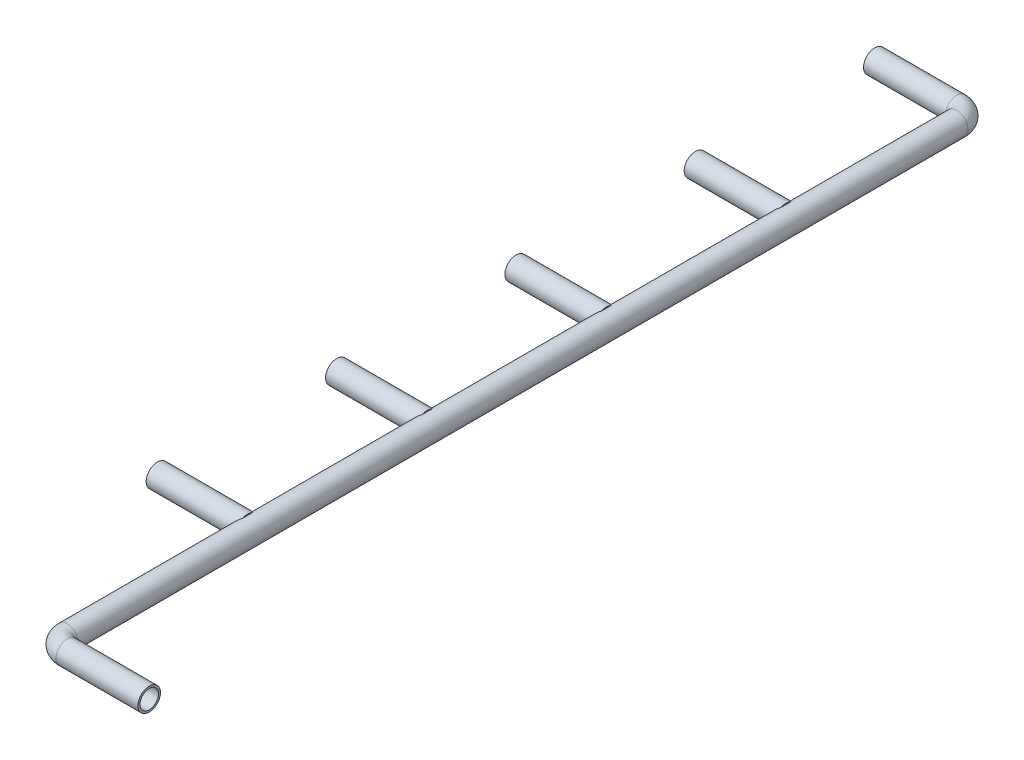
ISO-10303-21;
HEADER;
FILE_DESCRIPTION(('STEP AP214'),'2;1');
FILE_NAME('part.step','',(''),(''),'','','');
FILE_SCHEMA(('AUTOMOTIVE_DESIGN { 1 0 10303 214 1 1 1 1 }'));
ENDSEC;
DATA;
#1=APPLICATION_CONTEXT('core data for automotive mechanical design processes');
#2=APPLICATION_PROTOCOL_DEFINITION('international standard','automotive_design',2000,#1);
#3=PRODUCT_CONTEXT('',#1,'mechanical');
#4=PRODUCT('Part','Part','',(#3));
#5=PRODUCT_RELATED_PRODUCT_CATEGORY('part','',(#4));
#6=PRODUCT_DEFINITION_FORMATION('','',#4);
#7=PRODUCT_DEFINITION_CONTEXT('part definition',#1,'design');
#8=PRODUCT_DEFINITION('design','',#6,#7);
#9=PRODUCT_DEFINITION_SHAPE('','',#8);
#10=(LENGTH_UNIT() NAMED_UNIT(*) SI_UNIT(.MILLI.,.METRE.));
#11=(NAMED_UNIT(*) PLANE_ANGLE_UNIT() SI_UNIT($,.RADIAN.));
#12=(NAMED_UNIT(*) SI_UNIT($,.STERADIAN.) SOLID_ANGLE_UNIT());
#13=UNCERTAINTY_MEASURE_WITH_UNIT(LENGTH_MEASURE(1.E-05),#10,'distance_accuracy_value','');
#14=(GEOMETRIC_REPRESENTATION_CONTEXT(3) GLOBAL_UNCERTAINTY_ASSIGNED_CONTEXT((#13)) GLOBAL_UNIT_ASSIGNED_CONTEXT((#10,
#11,#12)) REPRESENTATION_CONTEXT('',''));
#15=CARTESIAN_POINT('',(0.,0.,0.));
#16=DIRECTION('',(0.,0.,1.));
#17=DIRECTION('',(1.,0.,0.));
#18=AXIS2_PLACEMENT_3D('',#15,#16,#17);
#19=CARTESIAN_POINT('',(6.36003799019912,0.,440.360037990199));
#20=DIRECTION('',(0.,0.,-1.));
#21=DIRECTION('',(-1.,0.,0.));
#22=AXIS2_PLACEMENT_3D('',#19,#20,#21);
#23=CYLINDRICAL_SURFACE('',#22,4.5);
#24=DIRECTION('',(0.,0.,-1.));
#25=VECTOR('',#24,1.);
#26=CARTESIAN_POINT('',(4.,3.83147761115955,440.360037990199));
#27=LINE('',#26,#25);
#28=CARTESIAN_POINT('',(4.,3.83147761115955,346.054144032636));
#29=VERTEX_POINT('',#28);
#30=CARTESIAN_POINT('',(4.,3.83147761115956,347.639962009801));
#31=VERTEX_POINT('',#30);
#32=EDGE_CURVE('E197',#29,#31,#27,.F.);
#33=ORIENTED_EDGE('',*,*,#32,.F.);
#34=CARTESIAN_POINT('',(4.,3.83147761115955,346.054144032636));
#35=CARTESIAN_POINT('',(3.88555058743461,3.76093308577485,345.985614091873));
#36=CARTESIAN_POINT('',(3.77463205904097,3.68558106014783,345.916152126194));
#37=CARTESIAN_POINT('',(3.55992974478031,3.52526058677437,345.776997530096));
#38=CARTESIAN_POINT('',(3.45615263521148,3.44028333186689,345.707304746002));
#39=CARTESIAN_POINT('',(3.25518988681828,3.26009896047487,345.568884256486));
#40=CARTESIAN_POINT('',(3.15806589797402,3.16481301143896,345.500169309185));
#41=CARTESIAN_POINT('',(2.97193833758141,2.96470200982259,345.365880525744));
#42=CARTESIAN_POINT('',(2.88293133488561,2.85988102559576,345.300305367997));
#43=CARTESIAN_POINT('',(2.66225830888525,2.57409213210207,345.135291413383));
#44=CARTESIAN_POINT('',(2.53749820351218,2.38552844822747,345.039462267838));
#45=CARTESIAN_POINT('',(2.31546892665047,1.98580998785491,344.866410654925));
#46=CARTESIAN_POINT('',(2.21810422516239,1.77473734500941,344.789123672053));
#47=CARTESIAN_POINT('',(2.06832140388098,1.36769535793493,344.669225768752));
#48=CARTESIAN_POINT('',(2.01126691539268,1.17448633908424,344.623090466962));
#49=CARTESIAN_POINT('',(1.92323422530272,0.778376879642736,344.551646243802));
#50=CARTESIAN_POINT('',(1.89225358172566,0.575477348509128,344.526335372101));
#51=CARTESIAN_POINT('',(1.85835059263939,0.165181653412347,344.498628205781));
#52=CARTESIAN_POINT('',(1.85550632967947,-0.0422254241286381,344.496295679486));
#53=CARTESIAN_POINT('',(1.87828119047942,-0.454382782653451,344.514920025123));
#54=CARTESIAN_POINT('',(1.90390069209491,-0.659133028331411,344.535877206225));
#55=CARTESIAN_POINT('',(1.98012544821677,-1.05092593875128,344.597855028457));
#56=CARTESIAN_POINT('',(2.02956261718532,-1.23835102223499,344.637936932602));
#57=CARTESIAN_POINT('',(2.15025365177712,-1.6013609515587,344.734926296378));
#58=CARTESIAN_POINT('',(2.22151475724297,-1.77694184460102,344.791839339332));
#59=CARTESIAN_POINT('',(2.41155850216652,-2.17334186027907,344.941745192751));
#60=CARTESIAN_POINT('',(2.53823592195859,-2.38823577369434,345.040381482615));
#61=CARTESIAN_POINT('',(2.82032540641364,-2.78941843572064,345.254367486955));
#62=CARTESIAN_POINT('',(2.97580983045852,-2.97563293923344,345.369759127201));
#63=CARTESIAN_POINT('',(3.20797265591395,-3.2129466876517,345.535306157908));
#64=CARTESIAN_POINT('',(3.27445079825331,-3.27682947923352,345.582034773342));
#65=CARTESIAN_POINT('',(3.41091033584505,-3.40016211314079,345.676238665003));
#66=CARTESIAN_POINT('',(3.48089127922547,-3.45961252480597,345.723713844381));
#67=CARTESIAN_POINT('',(3.62379921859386,-3.57369723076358,345.818594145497));
#68=CARTESIAN_POINT('',(3.69670494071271,-3.62835943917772,345.865997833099));
#69=CARTESIAN_POINT('',(3.84585455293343,-3.73325200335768,345.96046700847));
#70=CARTESIAN_POINT('',(3.922098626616,-3.78348211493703,346.007532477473));
#71=CARTESIAN_POINT('',(4.,-3.83147761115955,346.054144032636));
#72=B_SPLINE_CURVE_WITH_KNOTS('',3,(#34,#35,#36,#37,#38,#39,#40,#41,#42,#43,#44,#45,#46,#47,#48,
#49,#50,#51,#52,#53,#54,#55,#56,#57,#58,#59,#60,#61,#62,#63,#64,#65,#66,#67,#68,#69,#70,#71),
.UNSPECIFIED.,.F.,.F.,(4,2,2,2,2,2,2,2,2,2,2,2,2,2,2,2,2,2,4),(0.,0.452576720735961,
0.905570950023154,1.36231367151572,1.81886241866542,2.55257396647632,3.28369436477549,
3.90105180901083,4.51835142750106,5.13736366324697,5.75638411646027,6.34773362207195,
6.93927951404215,7.73975636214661,8.5422718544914,8.85225654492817,9.16220134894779,
9.47019866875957,9.77821294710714),.UNSPECIFIED.);
#73=CARTESIAN_POINT('',(4.,-3.83147761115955,346.054144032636));
#74=VERTEX_POINT('',#73);
#75=EDGE_CURVE('E198',#29,#74,#72,.T.);
#76=ORIENTED_EDGE('',*,*,#75,.T.);
#77=DIRECTION('',(0.,0.,-1.));
#78=VECTOR('',#77,1.);
#79=CARTESIAN_POINT('',(4.,-3.83147761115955,440.360037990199));
#80=LINE('',#79,#78);
#81=CARTESIAN_POINT('',(4.,-3.83147761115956,347.639962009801));
#82=VERTEX_POINT('',#81);
#83=EDGE_CURVE('E1063',#82,#74,#80,.T.);
#84=ORIENTED_EDGE('',*,*,#83,.F.);
#85=CARTESIAN_POINT('',(6.36003799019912,0.,350.));
#86=DIRECTION('',(0.707106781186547,0.,-0.707106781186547));
#87=DIRECTION('',(-0.707106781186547,0.,-0.707106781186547));
#88=AXIS2_PLACEMENT_3D('',#85,#86,#87);
#89=ELLIPSE('',#88,6.36396103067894,4.50000000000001);
#90=EDGE_CURVE('E204',#31,#82,#89,.F.);
#91=ORIENTED_EDGE('',*,*,#90,.F.);
#92=EDGE_LOOP('',(#33,#76,#84,#91));
#93=FACE_BOUND('',#92,.T.);
#94=DIRECTION('',(0.,0.,-1.));
#95=VECTOR('',#94,1.);
#96=CARTESIAN_POINT('',(4.,3.83147761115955,440.360037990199));
#97=LINE('',#96,#95);
#98=CARTESIAN_POINT('',(4.,3.83147761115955,258.554144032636));
#99=VERTEX_POINT('',#98);
#100=CARTESIAN_POINT('',(4.,3.83147761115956,260.139962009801));
#101=VERTEX_POINT('',#100);
#102=EDGE_CURVE('E463',#99,#101,#97,.F.);
#103=ORIENTED_EDGE('',*,*,#102,.F.);
#104=CARTESIAN_POINT('',(4.,3.83147761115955,258.554144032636));
#105=CARTESIAN_POINT('',(3.88555058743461,3.76093308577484,258.485614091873));
#106=CARTESIAN_POINT('',(3.77463205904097,3.68558106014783,258.416152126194));
#107=CARTESIAN_POINT('',(3.55992974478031,3.52526058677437,258.276997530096));
#108=CARTESIAN_POINT('',(3.45615263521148,3.4402833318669,258.207304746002));
#109=CARTESIAN_POINT('',(3.25518988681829,3.26009896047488,258.068884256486));
#110=CARTESIAN_POINT('',(3.15806589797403,3.16481301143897,258.000169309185));
#111=CARTESIAN_POINT('',(2.97193833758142,2.9647020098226,257.865880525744));
#112=CARTESIAN_POINT('',(2.88293133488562,2.85988102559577,257.800305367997));
#113=CARTESIAN_POINT('',(2.66225830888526,2.57409213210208,257.635291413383));
#114=CARTESIAN_POINT('',(2.53749820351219,2.38552844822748,257.539462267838));
#115=CARTESIAN_POINT('',(2.31546892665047,1.98580998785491,257.366410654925));
#116=CARTESIAN_POINT('',(2.21810422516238,1.77473734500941,257.289123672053));
#117=CARTESIAN_POINT('',(2.06832140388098,1.36769535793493,257.169225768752));
#118=CARTESIAN_POINT('',(2.01126691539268,1.17448633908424,257.123090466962));
#119=CARTESIAN_POINT('',(1.92323422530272,0.778376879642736,257.051646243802));
#120=CARTESIAN_POINT('',(1.89225358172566,0.575477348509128,257.026335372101));
#121=CARTESIAN_POINT('',(1.85835059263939,0.165181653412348,256.998628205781));
#122=CARTESIAN_POINT('',(1.85550632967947,-0.0422254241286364,256.996295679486));
#123=CARTESIAN_POINT('',(1.87828119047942,-0.45438278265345,257.014920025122));
#124=CARTESIAN_POINT('',(1.90390069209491,-0.65913302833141,257.035877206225));
#125=CARTESIAN_POINT('',(1.98012544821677,-1.05092593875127,257.097855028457));
#126=CARTESIAN_POINT('',(2.02956261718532,-1.23835102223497,257.137936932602));
#127=CARTESIAN_POINT('',(2.15025365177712,-1.60136095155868,257.234926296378));
#128=CARTESIAN_POINT('',(2.22151475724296,-1.77694184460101,257.291839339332));
#129=CARTESIAN_POINT('',(2.41155850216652,-2.17334186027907,257.441745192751));
#130=CARTESIAN_POINT('',(2.53823592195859,-2.38823577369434,257.540381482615));
#131=CARTESIAN_POINT('',(2.82032540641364,-2.78941843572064,257.754367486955));
#132=CARTESIAN_POINT('',(2.97580983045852,-2.97563293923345,257.869759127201));
#133=CARTESIAN_POINT('',(3.20797265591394,-3.21294668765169,258.035306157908));
#134=CARTESIAN_POINT('',(3.27445079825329,-3.2768294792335,258.082034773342));
#135=CARTESIAN_POINT('',(3.41091033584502,-3.40016211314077,258.176238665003));
#136=CARTESIAN_POINT('',(3.48089127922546,-3.45961252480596,258.223713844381));
#137=CARTESIAN_POINT('',(3.62379921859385,-3.57369723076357,258.318594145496));
#138=CARTESIAN_POINT('',(3.69670494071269,-3.62835943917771,258.365997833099));
#139=CARTESIAN_POINT('',(3.84585455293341,-3.73325200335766,258.46046700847));
#140=CARTESIAN_POINT('',(3.92209862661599,-3.78348211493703,258.507532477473));
#141=CARTESIAN_POINT('',(4.,-3.83147761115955,258.554144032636));
#142=B_SPLINE_CURVE_WITH_KNOTS('',3,(#104,#105,#106,#107,#108,#109,#110,#111,#112,#113,#114,
#115,#116,#117,#118,#119,#120,#121,#122,#123,#124,#125,#126,#127,#128,#129,#130,#131,#132,#133,
#134,#135,#136,#137,#138,#139,#140,#141),.UNSPECIFIED.,.F.,.F.,(4,2,2,2,2,2,2,2,2,2,2,2,2,2,2,2,
2,2,4),(0.,0.452576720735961,0.905570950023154,1.36231367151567,1.81886241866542,
2.55257396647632,3.28369436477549,3.90105180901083,4.51835142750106,5.13736366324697,
5.75638411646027,6.34773362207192,6.93927951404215,7.73975636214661,8.5422718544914,
8.85225654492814,9.16220134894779,9.4701986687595,9.77821294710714),.UNSPECIFIED.);
#143=CARTESIAN_POINT('',(4.,-3.83147761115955,258.554144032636));
#144=VERTEX_POINT('',#143);
#145=EDGE_CURVE('E1079',#99,#144,#142,.T.);
#146=ORIENTED_EDGE('',*,*,#145,.T.);
#147=DIRECTION('',(0.,0.,-1.));
#148=VECTOR('',#147,1.);
#149=CARTESIAN_POINT('',(4.,-3.83147761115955,440.360037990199));
#150=LINE('',#149,#148);
#151=CARTESIAN_POINT('',(4.,-3.83147761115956,260.139962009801));
#152=VERTEX_POINT('',#151);
#153=EDGE_CURVE('E1073',#152,#144,#150,.T.);
#154=ORIENTED_EDGE('',*,*,#153,.F.);
#155=CARTESIAN_POINT('',(6.36003799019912,0.,262.5));
#156=DIRECTION('',(0.707106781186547,0.,-0.707106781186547));
#157=DIRECTION('',(-0.707106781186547,0.,-0.707106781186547));
#158=AXIS2_PLACEMENT_3D('',#155,#156,#157);
#159=ELLIPSE('',#158,6.36396103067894,4.50000000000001);
#160=EDGE_CURVE('E269',#101,#152,#159,.F.);
#161=ORIENTED_EDGE('',*,*,#160,.F.);
#162=EDGE_LOOP('',(#103,#146,#154,#161));
#163=FACE_BOUND('',#162,.T.);
#164=DIRECTION('',(0.,0.,-1.));
#165=VECTOR('',#164,1.);
#166=CARTESIAN_POINT('',(4.,3.83147761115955,440.360037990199));
#167=LINE('',#166,#165);
#168=CARTESIAN_POINT('',(4.,3.83147761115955,171.054144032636));
#169=VERTEX_POINT('',#168);
#170=CARTESIAN_POINT('',(4.,3.83147761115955,172.639962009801));
#171=VERTEX_POINT('',#170);
#172=EDGE_CURVE('E346',#169,#171,#167,.F.);
#173=ORIENTED_EDGE('',*,*,#172,.F.);
#174=CARTESIAN_POINT('',(4.,3.83147761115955,171.054144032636));
#175=CARTESIAN_POINT('',(3.88555058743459,3.76093308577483,170.985614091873));
#176=CARTESIAN_POINT('',(3.77463205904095,3.68558106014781,170.916152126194));
#177=CARTESIAN_POINT('',(3.5599297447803,3.52526058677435,170.776997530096));
#178=CARTESIAN_POINT('',(3.45615263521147,3.44028333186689,170.707304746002));
#179=CARTESIAN_POINT('',(3.25518988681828,3.26009896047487,170.568884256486));
#180=CARTESIAN_POINT('',(3.15806589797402,3.16481301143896,170.500169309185));
#181=CARTESIAN_POINT('',(2.97193833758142,2.9647020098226,170.365880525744));
#182=CARTESIAN_POINT('',(2.88293133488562,2.85988102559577,170.300305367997));
#183=CARTESIAN_POINT('',(2.66225830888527,2.5740921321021,170.135291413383));
#184=CARTESIAN_POINT('',(2.53749820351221,2.38552844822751,170.039462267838));
#185=CARTESIAN_POINT('',(2.31546892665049,1.98580998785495,169.866410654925));
#186=CARTESIAN_POINT('',(2.2181042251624,1.77473734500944,169.789123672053));
#187=CARTESIAN_POINT('',(2.06832140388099,1.36769535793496,169.669225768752));
#188=CARTESIAN_POINT('',(2.01126691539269,1.17448633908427,169.623090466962));
#189=CARTESIAN_POINT('',(1.92323422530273,0.778376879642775,169.551646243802));
#190=CARTESIAN_POINT('',(1.89225358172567,0.575477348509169,169.526335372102));
#191=CARTESIAN_POINT('',(1.85835059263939,0.165181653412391,169.498628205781));
#192=CARTESIAN_POINT('',(1.85550632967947,-0.0422254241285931,169.496295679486));
#193=CARTESIAN_POINT('',(1.87828119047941,-0.454382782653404,169.514920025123));
#194=CARTESIAN_POINT('',(1.9039006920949,-0.659133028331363,169.535877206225));
#195=CARTESIAN_POINT('',(1.98012544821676,-1.05092593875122,169.597855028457));
#196=CARTESIAN_POINT('',(2.02956261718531,-1.23835102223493,169.637936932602));
#197=CARTESIAN_POINT('',(2.1502536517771,-1.60136095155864,169.734926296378));
#198=CARTESIAN_POINT('',(2.22151475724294,-1.77694184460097,169.791839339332));
#199=CARTESIAN_POINT('',(2.41155850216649,-2.17334186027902,169.941745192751));
#200=CARTESIAN_POINT('',(2.53823592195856,-2.38823577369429,170.040381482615));
#201=CARTESIAN_POINT('',(2.82032540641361,-2.7894184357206,170.254367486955));
#202=CARTESIAN_POINT('',(2.9758098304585,-2.97563293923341,170.369759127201));
#203=CARTESIAN_POINT('',(3.20797265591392,-3.21294668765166,170.535306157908));
#204=CARTESIAN_POINT('',(3.27445079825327,-3.27682947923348,170.582034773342));
#205=CARTESIAN_POINT('',(3.41091033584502,-3.40016211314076,170.676238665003));
#206=CARTESIAN_POINT('',(3.48089127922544,-3.45961252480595,170.723713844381));
#207=CARTESIAN_POINT('',(3.62379921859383,-3.57369723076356,170.818594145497));
#208=CARTESIAN_POINT('',(3.69670494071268,-3.6283594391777,170.865997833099));
#209=CARTESIAN_POINT('',(3.84585455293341,-3.73325200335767,170.96046700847));
#210=CARTESIAN_POINT('',(3.92209862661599,-3.78348211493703,171.007532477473));
#211=CARTESIAN_POINT('',(4.00000000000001,-3.83147761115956,171.054144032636));
#212=B_SPLINE_CURVE_WITH_KNOTS('',3,(#174,#175,#176,#177,#178,#179,#180,#181,#182,#183,#184,
#185,#186,#187,#188,#189,#190,#191,#192,#193,#194,#195,#196,#197,#198,#199,#200,#201,#202,#203,
#204,#205,#206,#207,#208,#209,#210,#211),.UNSPECIFIED.,.F.,.F.,(4,2,2,2,2,2,2,2,2,2,2,2,2,2,2,2,
2,2,4),(0.,0.452576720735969,0.905570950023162,1.36231367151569,1.8188624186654,
2.55257396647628,3.28369436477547,3.90105180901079,4.51835142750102,5.13736366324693,
5.75638411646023,6.34773362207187,6.93927951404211,7.73975636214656,8.54227185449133,
8.85225654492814,9.16220134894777,9.47019866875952,9.77821294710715),.UNSPECIFIED.);
#213=CARTESIAN_POINT('',(4.,-3.83147761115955,171.054144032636));
#214=VERTEX_POINT('',#213);
#215=EDGE_CURVE('E338',#169,#214,#212,.T.);
#216=ORIENTED_EDGE('',*,*,#215,.T.);
#217=DIRECTION('',(0.,0.,-1.));
#218=VECTOR('',#217,1.);
#219=CARTESIAN_POINT('',(4.,-3.83147761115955,440.360037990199));
#220=LINE('',#219,#218);
#221=CARTESIAN_POINT('',(4.,-3.83147761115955,172.639962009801));
#222=VERTEX_POINT('',#221);
#223=EDGE_CURVE('E347',#222,#214,#220,.T.);
#224=ORIENTED_EDGE('',*,*,#223,.F.);
#225=CARTESIAN_POINT('',(6.36003799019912,0.,175.));
#226=DIRECTION('',(0.707106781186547,0.,-0.707106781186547));
#227=DIRECTION('',(-0.707106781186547,0.,-0.707106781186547));
#228=AXIS2_PLACEMENT_3D('',#225,#226,#227);
#229=ELLIPSE('',#228,6.36396103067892,4.5);
#230=EDGE_CURVE('E305',#171,#222,#229,.F.);
#231=ORIENTED_EDGE('',*,*,#230,.F.);
#232=EDGE_LOOP('',(#173,#216,#224,#231));
#233=FACE_BOUND('',#232,.T.);
#234=CARTESIAN_POINT('',(6.36003799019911,0.,87.5));
#235=DIRECTION('',(0.707106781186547,0.,0.707106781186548));
#236=DIRECTION('',(0.707106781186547,0.,-0.707106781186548));
#237=AXIS2_PLACEMENT_3D('',#234,#235,#236);
#238=ELLIPSE('',#237,6.36396103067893,4.5);
#239=CARTESIAN_POINT('',(4.,-3.83147761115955,89.8600379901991));
#240=VERTEX_POINT('',#239);
#241=CARTESIAN_POINT('',(4.,3.83147761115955,89.8600379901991));
#242=VERTEX_POINT('',#241);
#243=EDGE_CURVE('E379',#240,#242,#238,.F.);
#244=ORIENTED_EDGE('',*,*,#243,.F.);
#245=DIRECTION('',(0.,0.,-1.));
#246=VECTOR('',#245,1.);
#247=CARTESIAN_POINT('',(4.,-3.83147761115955,440.360037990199));
#248=LINE('',#247,#246);
#249=CARTESIAN_POINT('',(4.,-3.83147761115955,91.4458559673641));
#250=VERTEX_POINT('',#249);
#251=EDGE_CURVE('E417',#240,#250,#248,.F.);
#252=ORIENTED_EDGE('',*,*,#251,.T.);
#253=CARTESIAN_POINT('',(1.86003799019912,0.,92.9999999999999));
#254=CARTESIAN_POINT('',(1.86003861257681,0.107379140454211,92.9999993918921));
#255=CARTESIAN_POINT('',(1.86388810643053,0.214768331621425,92.9968485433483));
#256=CARTESIAN_POINT('',(1.87921862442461,0.428677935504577,92.9843160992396));
#257=CARTESIAN_POINT('',(1.89070335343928,0.535197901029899,92.9749314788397));
#258=CARTESIAN_POINT('',(1.92112061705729,0.746615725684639,92.9501293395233));
#259=CARTESIAN_POINT('',(1.94006419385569,0.851510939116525,92.9347028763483));
#260=CARTESIAN_POINT('',(1.98508356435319,1.05878683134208,92.8981528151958));
#261=CARTESIAN_POINT('',(2.01116259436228,1.16116634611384,92.8770266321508));
#262=CARTESIAN_POINT('',(2.06984285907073,1.36201834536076,92.8296787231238));
#263=CARTESIAN_POINT('',(2.10239779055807,1.46051293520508,92.8034932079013));
#264=CARTESIAN_POINT('',(2.17369746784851,1.65383925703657,92.7464267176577));
#265=CARTESIAN_POINT('',(2.2124444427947,1.74866965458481,92.7155440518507));
#266=CARTESIAN_POINT('',(2.33727581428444,2.02698200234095,92.6166408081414));
#267=CARTESIAN_POINT('',(2.43200682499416,2.2044733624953,92.5423191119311));
#268=CARTESIAN_POINT('',(2.60743398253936,2.4872001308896,92.4071377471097));
#269=CARTESIAN_POINT('',(2.68292787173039,2.59738857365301,92.349575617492));
#270=CARTESIAN_POINT('',(2.84207512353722,2.80917454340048,92.2300420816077));
#271=CARTESIAN_POINT('',(2.92572855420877,2.91077199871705,92.1680706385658));
#272=CARTESIAN_POINT('',(3.10073483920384,3.10550182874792,92.0408624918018));
#273=CARTESIAN_POINT('',(3.19210936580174,3.19860874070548,91.975616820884));
#274=CARTESIAN_POINT('',(3.3818331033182,3.37596674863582,91.8433942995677));
#275=CARTESIAN_POINT('',(3.48017968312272,3.46022115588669,91.7764181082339));
#276=CARTESIAN_POINT('',(3.68537095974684,3.62125138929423,91.640989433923));
#277=CARTESIAN_POINT('',(3.79233310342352,3.69787289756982,91.5725314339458));
#278=CARTESIAN_POINT('',(4.01322064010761,3.84185330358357,91.4369959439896));
#279=CARTESIAN_POINT('',(4.12714831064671,3.90920914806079,91.3699189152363));
#280=CARTESIAN_POINT('',(4.36179605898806,4.03418593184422,91.2394486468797));
#281=CARTESIAN_POINT('',(4.48249787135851,4.09183151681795,91.1760463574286));
#282=CARTESIAN_POINT('',(4.73112705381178,4.19700441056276,91.0554955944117));
#283=CARTESIAN_POINT('',(4.85904808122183,4.24454043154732,90.9983417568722));
#284=CARTESIAN_POINT('',(5.13800976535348,4.33365541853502,90.8874854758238));
#285=CARTESIAN_POINT('',(5.28999257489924,4.37385803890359,90.8349974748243));
#286=CARTESIAN_POINT('',(5.60225684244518,4.43857924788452,90.7483868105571));
#287=CARTESIAN_POINT('',(5.76251651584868,4.46313694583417,90.7142183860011));
#288=CARTESIAN_POINT('',(6.00744110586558,4.48693097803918,90.6808198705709));
#289=CARTESIAN_POINT('',(6.09032772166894,4.49268326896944,90.6726683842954));
#290=CARTESIAN_POINT('',(6.256692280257,4.49958169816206,90.6628797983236));
#291=CARTESIAN_POINT('',(6.34017018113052,4.50072815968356,90.6612422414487));
#292=CARTESIAN_POINT('',(6.50693938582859,4.49837526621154,90.6645887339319));
#293=CARTESIAN_POINT('',(6.59023064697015,4.49487493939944,90.6695741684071));
#294=CARTESIAN_POINT('',(6.75590140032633,4.48332386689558,90.6858916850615));
#295=CARTESIAN_POINT('',(6.83828038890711,4.47527072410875,90.6972271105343));
#296=CARTESIAN_POINT('',(7.01123871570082,4.45358445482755,90.727377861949));
#297=CARTESIAN_POINT('',(7.10162050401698,4.43939917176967,90.7469256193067));
#298=CARTESIAN_POINT('',(7.27987561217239,4.40592067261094,90.7922116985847));
#299=CARTESIAN_POINT('',(7.36774704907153,4.38662372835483,90.8179545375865));
#300=CARTESIAN_POINT('',(7.62745008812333,4.32152347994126,90.9028644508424));
#301=CARTESIAN_POINT('',(7.79504131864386,4.26855420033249,90.9696480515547));
#302=CARTESIAN_POINT('',(8.08145455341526,4.15988119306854,91.0987268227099));
#303=CARTESIAN_POINT('',(8.2027267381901,4.1075125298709,91.1586141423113));
#304=CARTESIAN_POINT('',(8.43848647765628,3.99339376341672,91.2828452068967));
#305=CARTESIAN_POINT('',(8.552970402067,3.93163870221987,91.3471912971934));
#306=CARTESIAN_POINT('',(8.77539029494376,3.79906062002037,91.4781705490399));
#307=CARTESIAN_POINT('',(8.88331769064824,3.7282260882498,91.5448065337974));
#308=CARTESIAN_POINT('',(9.09251107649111,3.57773467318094,91.6785101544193));
#309=CARTESIAN_POINT('',(9.19377828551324,3.49807941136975,91.7455777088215));
#310=CARTESIAN_POINT('',(9.39334318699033,3.32671380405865,91.8812534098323));
#311=CARTESIAN_POINT('',(9.49137023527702,3.23465403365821,91.9498193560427));
#312=CARTESIAN_POINT('',(9.67967740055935,3.04109012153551,92.0842846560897));
#313=CARTESIAN_POINT('',(9.76995634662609,2.93958455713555,92.1501836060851));
#314=CARTESIAN_POINT('',(9.9418872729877,2.72744159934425,92.2776907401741));
#315=CARTESIAN_POINT('',(10.023558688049,2.61682582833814,92.3393084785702));
#316=CARTESIAN_POINT('',(10.1775892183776,2.38652932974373,92.4569375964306));
#317=CARTESIAN_POINT('',(10.2499483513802,2.2668486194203,92.5129489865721));
#318=CARTESIAN_POINT('',(10.4150533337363,1.9618909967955,92.6419248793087));
#319=CARTESIAN_POINT('',(10.5019990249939,1.77163636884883,92.710935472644));
#320=CARTESIAN_POINT('',(10.6128400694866,1.47474820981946,92.7996082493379));
#321=CARTESIAN_POINT('',(10.64652959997,1.37384354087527,92.826696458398));
#322=CARTESIAN_POINT('',(10.7069379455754,1.16870441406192,92.8754271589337));
#323=CARTESIAN_POINT('',(10.7336601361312,1.0644715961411,92.8970722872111));
#324=CARTESIAN_POINT('',(10.7798696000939,0.85260212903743,92.9345863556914));
#325=CARTESIAN_POINT('',(10.7993048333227,0.744946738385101,92.9504137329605));
#326=CARTESIAN_POINT('',(10.8303209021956,0.527815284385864,92.975705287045));
#327=CARTESIAN_POINT('',(10.8419053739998,0.41834008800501,92.9851724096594));
#328=CARTESIAN_POINT('',(10.8570092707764,0.198471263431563,92.9975205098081));
#329=CARTESIAN_POINT('',(10.8605293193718,0.088077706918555,93.0004019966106));
#330=CARTESIAN_POINT('',(10.8594363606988,-0.132635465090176,92.9995077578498));
#331=CARTESIAN_POINT('',(10.8548239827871,-0.242955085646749,92.9957325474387));
#332=CARTESIAN_POINT('',(10.8384319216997,-0.451426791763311,92.9823345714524));
#333=CARTESIAN_POINT('',(10.8274241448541,-0.549681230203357,92.9733417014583));
#334=CARTESIAN_POINT('',(10.7990900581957,-0.744675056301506,92.9502402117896));
#335=CARTESIAN_POINT('',(10.781761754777,-0.841413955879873,92.936129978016));
#336=CARTESIAN_POINT('',(10.7206508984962,-1.12836191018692,92.8864980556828));
#337=CARTESIAN_POINT('',(10.6677287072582,-1.31546948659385,92.8436637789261));
#338=CARTESIAN_POINT('',(10.5378189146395,-1.68400246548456,92.7394939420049));
#339=CARTESIAN_POINT('',(10.4599931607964,-1.86494167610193,92.6775171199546));
#340=CARTESIAN_POINT('',(10.2842407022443,-2.2109496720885,92.5394838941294));
#341=CARTESIAN_POINT('',(10.1863083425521,-2.37601397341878,92.4634235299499));
#342=CARTESIAN_POINT('',(10.0024401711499,-2.64609666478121,92.3233382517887));
#343=CARTESIAN_POINT('',(9.92055228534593,-2.75518794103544,92.2617135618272));
#344=CARTESIAN_POINT('',(9.74853949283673,-2.96418085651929,92.1344995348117));
#345=CARTESIAN_POINT('',(9.65841445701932,-3.06408235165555,92.0689101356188));
#346=CARTESIAN_POINT('',(9.47019686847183,-3.25498997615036,91.934940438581));
#347=CARTESIAN_POINT('',(9.37207347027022,-3.34595836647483,91.8665498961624));
#348=CARTESIAN_POINT('',(9.16861753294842,-3.51847465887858,91.7287720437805));
#349=CARTESIAN_POINT('',(9.06328808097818,-3.60002655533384,91.6593851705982));
#350=CARTESIAN_POINT('',(8.84368692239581,-3.75497743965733,91.5200964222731));
#351=CARTESIAN_POINT('',(8.72929390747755,-3.82821480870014,91.4502057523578));
#352=CARTESIAN_POINT('',(8.49302317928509,-3.96471949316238,91.3131810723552));
#353=CARTESIAN_POINT('',(8.37114189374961,-4.02798199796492,91.2460484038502));
#354=CARTESIAN_POINT('',(8.12025572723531,-4.1437456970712,91.1175693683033));
#355=CARTESIAN_POINT('',(7.99128713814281,-4.19629621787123,91.0561972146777));
#356=CARTESIAN_POINT('',(7.72562897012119,-4.29010168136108,90.9424491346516));
#357=CARTESIAN_POINT('',(7.58894996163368,-4.3313716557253,90.8900612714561));
#358=CARTESIAN_POINT('',(7.30254439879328,-4.40275510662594,90.7968689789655));
#359=CARTESIAN_POINT('',(7.15251858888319,-4.43238059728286,90.7565852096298));
#360=CARTESIAN_POINT('',(6.84648399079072,-4.47628637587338,90.6959842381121));
#361=CARTESIAN_POINT('',(6.69049106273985,-4.49060476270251,90.6756174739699));
#362=CARTESIAN_POINT('',(6.37560060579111,-4.50274130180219,90.6583960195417));
#363=CARTESIAN_POINT('',(6.21669169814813,-4.50046653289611,90.6616737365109));
#364=CARTESIAN_POINT('',(5.90207387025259,-4.47942356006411,90.6914021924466));
#365=CARTESIAN_POINT('',(5.74637063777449,-4.4606282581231,90.7178910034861));
#366=CARTESIAN_POINT('',(5.39817785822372,-4.40050737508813,90.7998085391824));
#367=CARTESIAN_POINT('',(5.208046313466,-4.35424369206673,90.8613846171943));
#368=CARTESIAN_POINT('',(4.84171479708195,-4.24048840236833,91.0037868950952));
#369=CARTESIAN_POINT('',(4.66556030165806,-4.17293079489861,91.0846727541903));
#370=CARTESIAN_POINT('',(4.36888181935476,-4.03792960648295,91.235336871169));
#371=CARTESIAN_POINT('',(4.24533988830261,-3.97455375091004,91.3029462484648));
#372=CARTESIAN_POINT('',(4.0057907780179,-3.83752201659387,91.4411787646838));
#373=CARTESIAN_POINT('',(3.88978705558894,-3.76386146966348,91.5118032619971));
#374=CARTESIAN_POINT('',(3.66516871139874,-3.60645285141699,91.6538851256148));
#375=CARTESIAN_POINT('',(3.5565619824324,-3.52269426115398,91.7253432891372));
#376=CARTESIAN_POINT('',(3.34704466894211,-3.34525190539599,91.8671717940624));
#377=CARTESIAN_POINT('',(3.24613274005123,-3.25156988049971,91.9375423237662));
#378=CARTESIAN_POINT('',(3.05079024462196,-3.05264386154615,92.0767182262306));
#379=CARTESIAN_POINT('',(2.95649720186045,-2.94723193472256,92.1454773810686));
#380=CARTESIAN_POINT('',(2.77703018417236,-2.72622721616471,92.2785271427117));
#381=CARTESIAN_POINT('',(2.69185786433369,-2.61063258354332,92.3428169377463));
#382=CARTESIAN_POINT('',(2.53188991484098,-2.36983563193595,92.4650847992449));
#383=CARTESIAN_POINT('',(2.45706794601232,-2.24465900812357,92.5230788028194));
#384=CARTESIAN_POINT('',(2.31882864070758,-1.98499981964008,92.631229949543));
#385=CARTESIAN_POINT('',(2.25540397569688,-1.85052331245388,92.6813921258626));
#386=CARTESIAN_POINT('',(2.16060433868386,-1.62006923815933,92.7568740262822));
#387=CARTESIAN_POINT('',(2.12563864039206,-1.52642366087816,92.7848629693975));
#388=CARTESIAN_POINT('',(2.06172175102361,-1.33587693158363,92.8362120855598));
#389=CARTESIAN_POINT('',(2.03276892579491,-1.2389766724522,92.8595735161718));
#390=CARTESIAN_POINT('',(1.98131509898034,-1.04262454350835,92.901202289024));
#391=CARTESIAN_POINT('',(1.95880097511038,-0.943178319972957,92.9194799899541));
#392=CARTESIAN_POINT('',(1.92048887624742,-0.74220016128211,92.9506395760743));
#393=CARTESIAN_POINT('',(1.90468817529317,-0.640669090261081,92.9635236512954));
#394=CARTESIAN_POINT('',(1.88163874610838,-0.449424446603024,92.9823372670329));
#395=CARTESIAN_POINT('',(1.87354902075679,-0.359878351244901,92.9889501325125));
#396=CARTESIAN_POINT('',(1.86274771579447,-0.180223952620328,92.9977822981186));
#397=CARTESIAN_POINT('',(1.86003746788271,-0.0901155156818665,93.0000005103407));
#398=CARTESIAN_POINT('',(1.86003799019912,0.,92.9999999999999));
#399=B_SPLINE_CURVE_WITH_KNOTS('',3,(#253,#254,#255,#256,#257,#258,#259,#260,#261,#262,#263,
#264,#265,#266,#267,#268,#269,#270,#271,#272,#273,#274,#275,#276,#277,#278,#279,#280,#281,#282,
#283,#284,#285,#286,#287,#288,#289,#290,#291,#292,#293,#294,#295,#296,#297,#298,#299,#300,#301,
#302,#303,#304,#305,#306,#307,#308,#309,#310,#311,#312,#313,#314,#315,#316,#317,#318,#319,#320,
#321,#322,#323,#324,#325,#326,#327,#328,#329,#330,#331,#332,#333,#334,#335,#336,#337,#338,#339,
#340,#341,#342,#343,#344,#345,#346,#347,#348,#349,#350,#351,#352,#353,#354,#355,#356,#357,#358,
#359,#360,#361,#362,#363,#364,#365,#366,#367,#368,#369,#370,#371,#372,#373,#374,#375,#376,#377,
#378,#379,#380,#381,#382,#383,#384,#385,#386,#387,#388,#389,#390,#391,#392,#393,#394,#395,#396,
#397,#398),.UNSPECIFIED.,.T.,.F.,(4,2,2,2,2,2,2,2,2,2,2,2,2,2,2,2,2,2,2,2,2,2,2,2,2,2,2,2,2,2,2,
2,2,2,2,2,2,2,2,2,2,2,2,2,2,2,2,2,2,2,2,2,2,2,2,2,2,2,2,2,2,2,2,2,2,2,2,2,2,2,2,2,4),(0.,
0.322040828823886,0.644238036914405,0.966914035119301,1.28973662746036,1.61032900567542,
1.93103705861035,2.57185439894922,3.00770706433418,3.44356336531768,3.8806865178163,
4.31764557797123,4.76215233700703,5.20680522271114,5.65031194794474,6.09343490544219,
6.58914307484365,7.08360715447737,7.33372842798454,7.58383214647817,7.83398817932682,
8.08427604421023,8.36449723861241,8.64492337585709,9.20677772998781,9.6414084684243,
10.0762695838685,10.5116875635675,10.9470256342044,11.3993741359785,11.8517908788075,
12.303163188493,12.7545346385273,13.4122297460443,13.7412269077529,14.0700643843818,
14.401207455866,14.7321970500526,15.0631610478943,15.3940994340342,15.6915739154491,
15.989142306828,16.5837805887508,17.2010176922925,17.8184286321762,18.2669268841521,
18.7154321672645,19.1657573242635,19.6158907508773,20.0736538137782,20.5316369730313,
20.9874610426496,21.4426747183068,21.9153279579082,22.3868020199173,22.8609183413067,
23.3358137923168,23.9478178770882,24.561737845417,25.0244953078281,25.4874635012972,
25.9509181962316,26.4142917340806,26.8854572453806,27.3567081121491,27.8267367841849,
28.2964621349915,28.6075863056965,28.9186258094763,29.2290268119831,29.5393016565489,
29.8095002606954,30.0797657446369),.UNSPECIFIED.);
#400=CARTESIAN_POINT('',(4.,3.83147761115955,91.4458559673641));
#401=VERTEX_POINT('',#400);
#402=EDGE_CURVE('E382',#250,#401,#399,.T.);
#403=ORIENTED_EDGE('',*,*,#402,.T.);
#404=DIRECTION('',(0.,0.,-1.));
#405=VECTOR('',#404,1.);
#406=CARTESIAN_POINT('',(4.,3.83147761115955,440.360037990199));
#407=LINE('',#406,#405);
#408=EDGE_CURVE('E416',#401,#242,#407,.T.);
#409=ORIENTED_EDGE('',*,*,#408,.T.);
#410=EDGE_LOOP('',(#244,#252,#403,#409));
#411=FACE_BOUND('',#410,.T.);
#412=CARTESIAN_POINT('',(1.86003799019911,0.,82.));
#413=CARTESIAN_POINT('',(1.8600386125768,-0.107379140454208,82.0000006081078));
#414=CARTESIAN_POINT('',(1.86388810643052,-0.214768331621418,82.0031514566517));
#415=CARTESIAN_POINT('',(1.87921862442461,-0.428677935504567,82.0156839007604));
#416=CARTESIAN_POINT('',(1.89070335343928,-0.53519790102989,82.0250685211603));
#417=CARTESIAN_POINT('',(1.92112061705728,-0.746615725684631,82.0498706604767));
#418=CARTESIAN_POINT('',(1.94006419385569,-0.851510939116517,82.0652971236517));
#419=CARTESIAN_POINT('',(1.98508356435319,-1.05878683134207,82.1018471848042));
#420=CARTESIAN_POINT('',(2.01116259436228,-1.16116634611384,82.1229733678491));
#421=CARTESIAN_POINT('',(2.06984285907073,-1.36201834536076,82.1703212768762));
#422=CARTESIAN_POINT('',(2.10239779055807,-1.46051293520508,82.1965067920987));
#423=CARTESIAN_POINT('',(2.17369746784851,-1.65383925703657,82.2535732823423));
#424=CARTESIAN_POINT('',(2.2124444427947,-1.74866965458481,82.2844559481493));
#425=CARTESIAN_POINT('',(2.33727581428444,-2.02698200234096,82.3833591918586));
#426=CARTESIAN_POINT('',(2.43200682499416,-2.2044733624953,82.4576808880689));
#427=CARTESIAN_POINT('',(2.60743398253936,-2.4872001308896,82.5928622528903));
#428=CARTESIAN_POINT('',(2.68292787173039,-2.59738857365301,82.650424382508));
#429=CARTESIAN_POINT('',(2.84207512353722,-2.80917454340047,82.7699579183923));
#430=CARTESIAN_POINT('',(2.92572855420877,-2.91077199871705,82.8319293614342));
#431=CARTESIAN_POINT('',(3.10073483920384,-3.10550182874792,82.9591375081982));
#432=CARTESIAN_POINT('',(3.19210936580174,-3.19860874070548,83.024383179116));
#433=CARTESIAN_POINT('',(3.3818331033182,-3.37596674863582,83.1566057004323));
#434=CARTESIAN_POINT('',(3.48017968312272,-3.46022115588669,83.2235818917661));
#435=CARTESIAN_POINT('',(3.68537095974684,-3.62125138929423,83.359010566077));
#436=CARTESIAN_POINT('',(3.79233310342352,-3.69787289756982,83.4274685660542));
#437=CARTESIAN_POINT('',(4.01322064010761,-3.84185330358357,83.5630040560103));
#438=CARTESIAN_POINT('',(4.12714831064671,-3.90920914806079,83.6300810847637));
#439=CARTESIAN_POINT('',(4.36179605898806,-4.03418593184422,83.7605513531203));
#440=CARTESIAN_POINT('',(4.48249787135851,-4.09183151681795,83.8239536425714));
#441=CARTESIAN_POINT('',(4.73112705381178,-4.19700441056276,83.9445044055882));
#442=CARTESIAN_POINT('',(4.85904808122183,-4.24454043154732,84.0016582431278));
#443=CARTESIAN_POINT('',(5.13800976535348,-4.33365541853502,84.1125145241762));
#444=CARTESIAN_POINT('',(5.28999257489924,-4.37385803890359,84.1650025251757));
#445=CARTESIAN_POINT('',(5.60225684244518,-4.43857924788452,84.2516131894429));
#446=CARTESIAN_POINT('',(5.76251651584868,-4.46313694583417,84.2857816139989));
#447=CARTESIAN_POINT('',(6.00744110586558,-4.48693097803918,84.3191801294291));
#448=CARTESIAN_POINT('',(6.09032772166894,-4.49268326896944,84.3273316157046));
#449=CARTESIAN_POINT('',(6.256692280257,-4.49958169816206,84.3371202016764));
#450=CARTESIAN_POINT('',(6.34017018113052,-4.50072815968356,84.3387577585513));
#451=CARTESIAN_POINT('',(6.50693938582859,-4.49837526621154,84.3354112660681));
#452=CARTESIAN_POINT('',(6.59023064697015,-4.49487493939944,84.3304258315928));
#453=CARTESIAN_POINT('',(6.75590140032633,-4.48332386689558,84.3141083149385));
#454=CARTESIAN_POINT('',(6.83828038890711,-4.47527072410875,84.3027728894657));
#455=CARTESIAN_POINT('',(7.01123871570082,-4.45358445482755,84.272622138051));
#456=CARTESIAN_POINT('',(7.10162050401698,-4.43939917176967,84.2530743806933));
#457=CARTESIAN_POINT('',(7.2798756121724,-4.40592067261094,84.2077883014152));
#458=CARTESIAN_POINT('',(7.36774704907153,-4.38662372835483,84.1820454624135));
#459=CARTESIAN_POINT('',(7.62745008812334,-4.32152347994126,84.0971355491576));
#460=CARTESIAN_POINT('',(7.79504131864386,-4.26855420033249,84.0303519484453));
#461=CARTESIAN_POINT('',(8.08145455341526,-4.15988119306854,83.9012731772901));
#462=CARTESIAN_POINT('',(8.2027267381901,-4.10751252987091,83.8413858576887));
#463=CARTESIAN_POINT('',(8.43848647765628,-3.99339376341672,83.7171547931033));
#464=CARTESIAN_POINT('',(8.552970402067,-3.93163870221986,83.6528087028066));
#465=CARTESIAN_POINT('',(8.77539029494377,-3.79906062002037,83.5218294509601));
#466=CARTESIAN_POINT('',(8.88331769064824,-3.7282260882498,83.4551934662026));
#467=CARTESIAN_POINT('',(9.09251107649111,-3.57773467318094,83.3214898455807));
#468=CARTESIAN_POINT('',(9.19377828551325,-3.49807941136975,83.2544222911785));
#469=CARTESIAN_POINT('',(9.39334318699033,-3.32671380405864,83.1187465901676));
#470=CARTESIAN_POINT('',(9.49137023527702,-3.23465403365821,83.0501806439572));
#471=CARTESIAN_POINT('',(9.67967740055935,-3.0410901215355,82.9157153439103));
#472=CARTESIAN_POINT('',(9.7699563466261,-2.93958455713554,82.8498163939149));
#473=CARTESIAN_POINT('',(9.94188727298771,-2.72744159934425,82.7223092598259));
#474=CARTESIAN_POINT('',(10.023558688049,-2.61682582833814,82.6606915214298));
#475=CARTESIAN_POINT('',(10.1775892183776,-2.38652932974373,82.5430624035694));
#476=CARTESIAN_POINT('',(10.2499483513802,-2.2668486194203,82.4870510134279));
#477=CARTESIAN_POINT('',(10.4150533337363,-1.9618909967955,82.3580751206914));
#478=CARTESIAN_POINT('',(10.5019990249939,-1.77163636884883,82.2890645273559));
#479=CARTESIAN_POINT('',(10.6128400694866,-1.47474820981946,82.2003917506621));
#480=CARTESIAN_POINT('',(10.64652959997,-1.37384354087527,82.173303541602));
#481=CARTESIAN_POINT('',(10.7069379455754,-1.16870441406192,82.1245728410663));
#482=CARTESIAN_POINT('',(10.7336601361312,-1.0644715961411,82.1029277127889));
#483=CARTESIAN_POINT('',(10.7798696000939,-0.852602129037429,82.0654136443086));
#484=CARTESIAN_POINT('',(10.7993048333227,-0.7449467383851,82.0495862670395));
#485=CARTESIAN_POINT('',(10.8303209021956,-0.527815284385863,82.024294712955));
#486=CARTESIAN_POINT('',(10.8419053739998,-0.418340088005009,82.0148275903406));
#487=CARTESIAN_POINT('',(10.8570092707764,-0.198471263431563,82.0024794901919));
#488=CARTESIAN_POINT('',(10.8605293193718,-0.0880777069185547,81.9995980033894));
#489=CARTESIAN_POINT('',(10.8594363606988,0.132635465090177,82.0004922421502));
#490=CARTESIAN_POINT('',(10.8548239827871,0.24295508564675,82.0042674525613));
#491=CARTESIAN_POINT('',(10.8384319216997,0.451426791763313,82.0176654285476));
#492=CARTESIAN_POINT('',(10.8274241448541,0.549681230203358,82.0266582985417));
#493=CARTESIAN_POINT('',(10.7990900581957,0.744675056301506,82.0497597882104));
#494=CARTESIAN_POINT('',(10.781761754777,0.841413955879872,82.063870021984));
#495=CARTESIAN_POINT('',(10.7206508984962,1.12836191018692,82.1135019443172));
#496=CARTESIAN_POINT('',(10.6677287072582,1.31546948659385,82.1563362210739));
#497=CARTESIAN_POINT('',(10.5378189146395,1.68400246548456,82.2605060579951));
#498=CARTESIAN_POINT('',(10.4599931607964,1.86494167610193,82.3224828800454));
#499=CARTESIAN_POINT('',(10.2842407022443,2.2109496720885,82.4605161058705));
#500=CARTESIAN_POINT('',(10.1863083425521,2.37601397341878,82.5365764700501));
#501=CARTESIAN_POINT('',(10.0024401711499,2.64609666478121,82.6766617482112));
#502=CARTESIAN_POINT('',(9.92055228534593,2.75518794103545,82.7382864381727));
#503=CARTESIAN_POINT('',(9.74853949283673,2.96418085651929,82.8655004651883));
#504=CARTESIAN_POINT('',(9.65841445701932,3.06408235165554,82.9310898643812));
#505=CARTESIAN_POINT('',(9.47019686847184,3.25498997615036,83.065059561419));
#506=CARTESIAN_POINT('',(9.37207347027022,3.34595836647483,83.1334501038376));
#507=CARTESIAN_POINT('',(9.16861753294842,3.51847465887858,83.2712279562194));
#508=CARTESIAN_POINT('',(9.06328808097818,3.60002655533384,83.3406148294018));
#509=CARTESIAN_POINT('',(8.84368692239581,3.75497743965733,83.4799035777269));
#510=CARTESIAN_POINT('',(8.72929390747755,3.82821480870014,83.5497942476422));
#511=CARTESIAN_POINT('',(8.49302317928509,3.96471949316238,83.6868189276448));
#512=CARTESIAN_POINT('',(8.37114189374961,4.02798199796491,83.7539515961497));
#513=CARTESIAN_POINT('',(8.12025572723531,4.1437456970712,83.8824306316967));
#514=CARTESIAN_POINT('',(7.99128713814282,4.19629621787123,83.9438027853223));
#515=CARTESIAN_POINT('',(7.72562897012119,4.29010168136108,84.0575508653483));
#516=CARTESIAN_POINT('',(7.58894996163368,4.3313716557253,84.1099387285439));
#517=CARTESIAN_POINT('',(7.30254439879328,4.40275510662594,84.2031310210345));
#518=CARTESIAN_POINT('',(7.15251858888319,4.43238059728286,84.2434147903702));
#519=CARTESIAN_POINT('',(6.84648399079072,4.47628637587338,84.3040157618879));
#520=CARTESIAN_POINT('',(6.69049106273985,4.49060476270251,84.3243825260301));
#521=CARTESIAN_POINT('',(6.37560060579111,4.50274130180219,84.3416039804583));
#522=CARTESIAN_POINT('',(6.21669169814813,4.50046653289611,84.3383262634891));
#523=CARTESIAN_POINT('',(5.90207387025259,4.47942356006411,84.3085978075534));
#524=CARTESIAN_POINT('',(5.74637063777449,4.4606282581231,84.2821089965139));
#525=CARTESIAN_POINT('',(5.39817785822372,4.40050737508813,84.2001914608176));
#526=CARTESIAN_POINT('',(5.20804631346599,4.35424369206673,84.1386153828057));
#527=CARTESIAN_POINT('',(4.84171479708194,4.24048840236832,83.9962131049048));
#528=CARTESIAN_POINT('',(4.66556030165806,4.17293079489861,83.9153272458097));
#529=CARTESIAN_POINT('',(4.36888181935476,4.03792960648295,83.764663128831));
#530=CARTESIAN_POINT('',(4.24533988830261,3.97455375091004,83.6970537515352));
#531=CARTESIAN_POINT('',(4.0057907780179,3.83752201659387,83.5588212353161));
#532=CARTESIAN_POINT('',(3.88978705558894,3.76386146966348,83.4881967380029));
#533=CARTESIAN_POINT('',(3.66516871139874,3.60645285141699,83.3461148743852));
#534=CARTESIAN_POINT('',(3.5565619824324,3.52269426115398,83.2746567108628));
#535=CARTESIAN_POINT('',(3.34704466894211,3.34525190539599,83.1328282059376));
#536=CARTESIAN_POINT('',(3.24613274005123,3.25156988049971,83.0624576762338));
#537=CARTESIAN_POINT('',(3.05079024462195,3.05264386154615,82.9232817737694));
#538=CARTESIAN_POINT('',(2.95649720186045,2.94723193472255,82.8545226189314));
#539=CARTESIAN_POINT('',(2.77703018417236,2.72622721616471,82.7214728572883));
#540=CARTESIAN_POINT('',(2.69185786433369,2.61063258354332,82.6571830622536));
#541=CARTESIAN_POINT('',(2.53188991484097,2.36983563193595,82.534915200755));
#542=CARTESIAN_POINT('',(2.45706794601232,2.24465900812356,82.4769211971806));
#543=CARTESIAN_POINT('',(2.31882864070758,1.98499981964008,82.368770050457));
#544=CARTESIAN_POINT('',(2.25540397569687,1.85052331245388,82.3186078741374));
#545=CARTESIAN_POINT('',(2.16060433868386,1.62006923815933,82.2431259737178));
#546=CARTESIAN_POINT('',(2.12563864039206,1.52642366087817,82.2151370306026));
#547=CARTESIAN_POINT('',(2.06172175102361,1.33587693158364,82.1637879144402));
#548=CARTESIAN_POINT('',(2.03276892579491,1.23897667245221,82.1404264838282));
#549=CARTESIAN_POINT('',(1.98131509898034,1.04262454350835,82.098797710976));
#550=CARTESIAN_POINT('',(1.95880097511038,0.943178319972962,82.0805200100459));
#551=CARTESIAN_POINT('',(1.92048887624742,0.742200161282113,82.0493604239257));
#552=CARTESIAN_POINT('',(1.90468817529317,0.640669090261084,82.0364763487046));
#553=CARTESIAN_POINT('',(1.88163874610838,0.449424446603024,82.0176627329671));
#554=CARTESIAN_POINT('',(1.87354902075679,0.359878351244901,82.0110498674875));
#555=CARTESIAN_POINT('',(1.86274771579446,0.180223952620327,82.0022177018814));
#556=CARTESIAN_POINT('',(1.8600374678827,0.0901155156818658,81.9999994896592));
#557=CARTESIAN_POINT('',(1.86003799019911,0.,82.));
#558=B_SPLINE_CURVE_WITH_KNOTS('',3,(#412,#413,#414,#415,#416,#417,#418,#419,#420,#421,#422,
#423,#424,#425,#426,#427,#428,#429,#430,#431,#432,#433,#434,#435,#436,#437,#438,#439,#440,#441,
#442,#443,#444,#445,#446,#447,#448,#449,#450,#451,#452,#453,#454,#455,#456,#457,#458,#459,#460,
#461,#462,#463,#464,#465,#466,#467,#468,#469,#470,#471,#472,#473,#474,#475,#476,#477,#478,#479,
#480,#481,#482,#483,#484,#485,#486,#487,#488,#489,#490,#491,#492,#493,#494,#495,#496,#497,#498,
#499,#500,#501,#502,#503,#504,#505,#506,#507,#508,#509,#510,#511,#512,#513,#514,#515,#516,#517,
#518,#519,#520,#521,#522,#523,#524,#525,#526,#527,#528,#529,#530,#531,#532,#533,#534,#535,#536,
#537,#538,#539,#540,#541,#542,#543,#544,#545,#546,#547,#548,#549,#550,#551,#552,#553,#554,#555,
#556,#557),.UNSPECIFIED.,.T.,.F.,(4,2,2,2,2,2,2,2,2,2,2,2,2,2,2,2,2,2,2,2,2,2,2,2,2,2,2,2,2,2,2,
2,2,2,2,2,2,2,2,2,2,2,2,2,2,2,2,2,2,2,2,2,2,2,2,2,2,2,2,2,2,2,2,2,2,2,2,2,2,2,2,2,4),(0.,
0.322040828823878,0.644238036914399,0.966914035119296,1.28973662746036,1.61032900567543,
1.93103705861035,2.57185439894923,3.00770706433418,3.44356336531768,3.8806865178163,
4.31764557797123,4.76215233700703,5.20680522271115,5.65031194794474,6.09343490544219,
6.58914307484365,7.08360715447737,7.33372842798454,7.58383214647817,7.83398817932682,
8.08427604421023,8.36449723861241,8.6449233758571,9.20677772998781,9.64140846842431,
10.0762695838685,10.5116875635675,10.9470256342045,11.3993741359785,11.8517908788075,
12.303163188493,12.7545346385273,13.4122297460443,13.7412269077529,14.0700643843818,
14.401207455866,14.7321970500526,15.0631610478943,15.3940994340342,15.6915739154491,
15.989142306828,16.5837805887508,17.2010176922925,17.8184286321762,18.2669268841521,
18.7154321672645,19.1657573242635,19.6158907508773,20.0736538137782,20.5316369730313,
20.9874610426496,21.4426747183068,21.9153279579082,22.3868020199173,22.8609183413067,
23.3358137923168,23.9478178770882,24.561737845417,25.0244953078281,25.4874635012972,
25.9509181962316,26.4142917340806,26.8854572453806,27.3567081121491,27.8267367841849,
28.2964621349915,28.6075863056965,28.9186258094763,29.2290268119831,29.5393016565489,
29.8095002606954,30.0797657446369),.UNSPECIFIED.);
#559=CARTESIAN_POINT('',(4.,3.83147761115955,83.5541440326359));
#560=VERTEX_POINT('',#559);
#561=CARTESIAN_POINT('',(4.,-3.83147761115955,83.5541440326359));
#562=VERTEX_POINT('',#561);
#563=EDGE_CURVE('E374',#560,#562,#558,.T.);
#564=ORIENTED_EDGE('',*,*,#563,.T.);
#565=CARTESIAN_POINT('',(4.,-3.83147761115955,85.1399620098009));
#566=VERTEX_POINT('',#565);
#567=EDGE_CURVE('E419',#562,#566,#248,.F.);
#568=ORIENTED_EDGE('',*,*,#567,.T.);
#569=CARTESIAN_POINT('',(6.36003799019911,0.,87.5));
#570=DIRECTION('',(0.707106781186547,0.,-0.707106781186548));
#571=DIRECTION('',(0.707106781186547,0.,0.707106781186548));
#572=AXIS2_PLACEMENT_3D('',#569,#570,#571);
#573=ELLIPSE('',#572,6.36396103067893,4.5);
#574=CARTESIAN_POINT('',(4.,3.83147761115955,85.1399620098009));
#575=VERTEX_POINT('',#574);
#576=EDGE_CURVE('E370',#575,#566,#573,.F.);
#577=ORIENTED_EDGE('',*,*,#576,.F.);
#578=EDGE_CURVE('E413',#575,#560,#407,.T.);
#579=ORIENTED_EDGE('',*,*,#578,.T.);
#580=EDGE_LOOP('',(#564,#568,#577,#579));
#581=FACE_BOUND('',#580,.T.);
#582=CARTESIAN_POINT('',(6.36003799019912,0.,440.360037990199));
#583=DIRECTION('',(0.,0.,1.));
#584=DIRECTION('',(1.,0.,0.));
#585=AXIS2_PLACEMENT_3D('',#582,#583,#584);
#586=CIRCLE('',#585,4.5);
#587=CARTESIAN_POINT('',(1.86003799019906,0.,440.360037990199));
#588=VERTEX_POINT('',#587);
#589=EDGE_CURVE('E586',#588,#588,#586,.T.);
#590=ORIENTED_EDGE('',*,*,#589,.T.);
#591=EDGE_LOOP('',(#590));
#592=FACE_BOUND('',#591,.T.);
#593=CARTESIAN_POINT('',(6.36003799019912,0.,6.36003799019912));
#594=DIRECTION('',(0.,0.,1.));
#595=DIRECTION('',(1.,0.,0.));
#596=AXIS2_PLACEMENT_3D('',#593,#594,#595);
#597=CIRCLE('',#596,4.5);
#598=CARTESIAN_POINT('',(10.8600379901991,0.,6.36003799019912));
#599=VERTEX_POINT('',#598);
#600=EDGE_CURVE('E351',#599,#599,#597,.T.);
#601=ORIENTED_EDGE('',*,*,#600,.F.);
#602=EDGE_LOOP('',(#601));
#603=FACE_BOUND('',#602,.T.);
#604=CARTESIAN_POINT('',(4.,-3.83147761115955,178.945855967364));
#605=VERTEX_POINT('',#604);
#606=CARTESIAN_POINT('',(4.,-3.83147761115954,177.360037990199));
#607=VERTEX_POINT('',#606);
#608=EDGE_CURVE('E350',#605,#607,#220,.T.);
#609=ORIENTED_EDGE('',*,*,#608,.F.);
#610=CARTESIAN_POINT('',(4.,-3.83147761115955,178.945855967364));
#611=CARTESIAN_POINT('',(3.88555058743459,-3.76093308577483,179.014385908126));
#612=CARTESIAN_POINT('',(3.77463205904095,-3.68558106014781,179.083847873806));
#613=CARTESIAN_POINT('',(3.5599297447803,-3.52526058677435,179.223002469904));
#614=CARTESIAN_POINT('',(3.45615263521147,-3.44028333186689,179.292695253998));
#615=CARTESIAN_POINT('',(3.25518988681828,-3.26009896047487,179.431115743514));
#616=CARTESIAN_POINT('',(3.15806589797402,-3.16481301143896,179.499830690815));
#617=CARTESIAN_POINT('',(2.97193833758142,-2.9647020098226,179.634119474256));
#618=CARTESIAN_POINT('',(2.88293133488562,-2.85988102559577,179.699694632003));
#619=CARTESIAN_POINT('',(2.66225830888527,-2.57409213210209,179.864708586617));
#620=CARTESIAN_POINT('',(2.53749820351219,-2.38552844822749,179.960537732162));
#621=CARTESIAN_POINT('',(2.31546892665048,-1.98580998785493,180.133589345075));
#622=CARTESIAN_POINT('',(2.21810422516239,-1.77473734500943,180.210876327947));
#623=CARTESIAN_POINT('',(2.06832140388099,-1.36769535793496,180.330774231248));
#624=CARTESIAN_POINT('',(2.01126691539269,-1.17448633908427,180.376909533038));
#625=CARTESIAN_POINT('',(1.92323422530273,-0.778376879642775,180.448353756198));
#626=CARTESIAN_POINT('',(1.89225358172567,-0.575477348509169,180.473664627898));
#627=CARTESIAN_POINT('',(1.85835059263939,-0.165181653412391,180.501371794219));
#628=CARTESIAN_POINT('',(1.85550632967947,0.0422254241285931,180.503704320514));
#629=CARTESIAN_POINT('',(1.87828119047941,0.454382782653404,180.485079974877));
#630=CARTESIAN_POINT('',(1.9039006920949,0.659133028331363,180.464122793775));
#631=CARTESIAN_POINT('',(1.98012544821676,1.05092593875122,180.402144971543));
#632=CARTESIAN_POINT('',(2.02956261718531,1.23835102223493,180.362063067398));
#633=CARTESIAN_POINT('',(2.1502536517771,1.60136095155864,180.265073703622));
#634=CARTESIAN_POINT('',(2.22151475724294,1.77694184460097,180.208160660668));
#635=CARTESIAN_POINT('',(2.41155850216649,2.17334186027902,180.058254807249));
#636=CARTESIAN_POINT('',(2.53823592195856,2.38823577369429,179.959618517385));
#637=CARTESIAN_POINT('',(2.82032540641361,2.7894184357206,179.745632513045));
#638=CARTESIAN_POINT('',(2.9758098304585,2.97563293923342,179.630240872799));
#639=CARTESIAN_POINT('',(3.20797265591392,3.21294668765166,179.464693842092));
#640=CARTESIAN_POINT('',(3.27445079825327,3.27682947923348,179.417965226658));
#641=CARTESIAN_POINT('',(3.41091033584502,3.40016211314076,179.323761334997));
#642=CARTESIAN_POINT('',(3.48089127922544,3.45961252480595,179.276286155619));
#643=CARTESIAN_POINT('',(3.62379921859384,3.57369723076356,179.181405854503));
#644=CARTESIAN_POINT('',(3.6967049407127,3.62835943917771,179.1340021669));
#645=CARTESIAN_POINT('',(3.84585455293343,3.73325200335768,179.03953299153));
#646=CARTESIAN_POINT('',(3.922098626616,3.78348211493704,178.992467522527));
#647=CARTESIAN_POINT('',(4.00000000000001,3.83147761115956,178.945855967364));
#648=B_SPLINE_CURVE_WITH_KNOTS('',3,(#610,#611,#612,#613,#614,#615,#616,#617,#618,#619,#620,
#621,#622,#623,#624,#625,#626,#627,#628,#629,#630,#631,#632,#633,#634,#635,#636,#637,#638,#639,
#640,#641,#642,#643,#644,#645,#646,#647),.UNSPECIFIED.,.F.,.F.,(4,2,2,2,2,2,2,2,2,2,2,2,2,2,2,2,
2,2,4),(0.,0.452576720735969,0.905570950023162,1.36231367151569,1.8188624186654,
2.55257396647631,3.28369436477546,3.90105180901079,4.51835142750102,5.13736366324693,
5.75638411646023,6.34773362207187,6.93927951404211,7.73975636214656,8.54227185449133,
8.85225654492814,9.16220134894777,9.47019866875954,9.77821294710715),.UNSPECIFIED.);
#649=CARTESIAN_POINT('',(4.,3.83147761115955,178.945855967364));
#650=VERTEX_POINT('',#649);
#651=EDGE_CURVE('E332',#605,#650,#648,.T.);
#652=ORIENTED_EDGE('',*,*,#651,.T.);
#653=CARTESIAN_POINT('',(4.,3.83147761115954,177.360037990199));
#654=VERTEX_POINT('',#653);
#655=EDGE_CURVE('E343',#654,#650,#167,.F.);
#656=ORIENTED_EDGE('',*,*,#655,.F.);
#657=CARTESIAN_POINT('',(6.36003799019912,0.,175.));
#658=DIRECTION('',(-0.707106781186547,0.,-0.707106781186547));
#659=DIRECTION('',(0.707106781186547,0.,-0.707106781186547));
#660=AXIS2_PLACEMENT_3D('',#657,#658,#659);
#661=ELLIPSE('',#660,6.36396103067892,4.5);
#662=EDGE_CURVE('E1101',#607,#654,#661,.T.);
#663=ORIENTED_EDGE('',*,*,#662,.F.);
#664=EDGE_LOOP('',(#609,#652,#656,#663));
#665=FACE_BOUND('',#664,.T.);
#666=CARTESIAN_POINT('',(4.,-3.83147761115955,266.445855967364));
#667=VERTEX_POINT('',#666);
#668=CARTESIAN_POINT('',(4.,-3.83147761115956,264.860037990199));
#669=VERTEX_POINT('',#668);
#670=EDGE_CURVE('E1076',#667,#669,#150,.T.);
#671=ORIENTED_EDGE('',*,*,#670,.F.);
#672=CARTESIAN_POINT('',(4.,-3.83147761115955,266.445855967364));
#673=CARTESIAN_POINT('',(3.88555058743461,-3.76093308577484,266.514385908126));
#674=CARTESIAN_POINT('',(3.77463205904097,-3.68558106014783,266.583847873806));
#675=CARTESIAN_POINT('',(3.55992974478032,-3.52526058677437,266.723002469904));
#676=CARTESIAN_POINT('',(3.45615263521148,-3.4402833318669,266.792695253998));
#677=CARTESIAN_POINT('',(3.25518988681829,-3.26009896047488,266.931115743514));
#678=CARTESIAN_POINT('',(3.15806589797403,-3.16481301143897,266.999830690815));
#679=CARTESIAN_POINT('',(2.97193833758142,-2.9647020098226,267.134119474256));
#680=CARTESIAN_POINT('',(2.88293133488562,-2.85988102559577,267.199694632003));
#681=CARTESIAN_POINT('',(2.66225830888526,-2.57409213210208,267.364708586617));
#682=CARTESIAN_POINT('',(2.53749820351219,-2.38552844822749,267.460537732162));
#683=CARTESIAN_POINT('',(2.31546892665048,-1.98580998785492,267.633589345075));
#684=CARTESIAN_POINT('',(2.21810422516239,-1.77473734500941,267.710876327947));
#685=CARTESIAN_POINT('',(2.06832140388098,-1.36769535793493,267.830774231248));
#686=CARTESIAN_POINT('',(2.01126691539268,-1.17448633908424,267.876909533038));
#687=CARTESIAN_POINT('',(1.92323422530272,-0.778376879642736,267.948353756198));
#688=CARTESIAN_POINT('',(1.89225358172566,-0.575477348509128,267.973664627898));
#689=CARTESIAN_POINT('',(1.85835059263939,-0.165181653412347,268.001371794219));
#690=CARTESIAN_POINT('',(1.85550632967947,0.042225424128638,268.003704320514));
#691=CARTESIAN_POINT('',(1.87828119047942,0.454382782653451,267.985079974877));
#692=CARTESIAN_POINT('',(1.90390069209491,0.659133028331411,267.964122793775));
#693=CARTESIAN_POINT('',(1.98012544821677,1.05092593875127,267.902144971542));
#694=CARTESIAN_POINT('',(2.02956261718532,1.23835102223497,267.862063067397));
#695=CARTESIAN_POINT('',(2.15025365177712,1.60136095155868,267.765073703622));
#696=CARTESIAN_POINT('',(2.22151475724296,1.77694184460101,267.708160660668));
#697=CARTESIAN_POINT('',(2.41155850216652,2.17334186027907,267.558254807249));
#698=CARTESIAN_POINT('',(2.53823592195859,2.38823577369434,267.459618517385));
#699=CARTESIAN_POINT('',(2.82032540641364,2.78941843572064,267.245632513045));
#700=CARTESIAN_POINT('',(2.97580983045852,2.97563293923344,267.130240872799));
#701=CARTESIAN_POINT('',(3.20797265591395,3.2129466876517,266.964693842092));
#702=CARTESIAN_POINT('',(3.27445079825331,3.27682947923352,266.917965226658));
#703=CARTESIAN_POINT('',(3.41091033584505,3.40016211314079,266.823761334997));
#704=CARTESIAN_POINT('',(3.48089127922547,3.45961252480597,266.776286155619));
#705=CARTESIAN_POINT('',(3.62379921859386,3.57369723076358,266.681405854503));
#706=CARTESIAN_POINT('',(3.69670494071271,3.62835943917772,266.6340021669));
#707=CARTESIAN_POINT('',(3.84585455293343,3.73325200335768,266.53953299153));
#708=CARTESIAN_POINT('',(3.922098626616,3.78348211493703,266.492467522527));
#709=CARTESIAN_POINT('',(4.,3.83147761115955,266.445855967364));
#710=B_SPLINE_CURVE_WITH_KNOTS('',3,(#672,#673,#674,#675,#676,#677,#678,#679,#680,#681,#682,
#683,#684,#685,#686,#687,#688,#689,#690,#691,#692,#693,#694,#695,#696,#697,#698,#699,#700,#701,
#702,#703,#704,#705,#706,#707,#708,#709),.UNSPECIFIED.,.F.,.F.,(4,2,2,2,2,2,2,2,2,2,2,2,2,2,2,2,
2,2,4),(0.,0.45257672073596,0.905570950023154,1.36231367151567,1.81886241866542,
2.55257396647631,3.28369436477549,3.90105180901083,4.51835142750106,5.13736366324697,
5.75638411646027,6.34773362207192,6.93927951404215,7.73975636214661,8.5422718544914,
8.85225654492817,9.16220134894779,9.47019866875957,9.77821294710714),.UNSPECIFIED.);
#711=CARTESIAN_POINT('',(4.,3.83147761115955,266.445855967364));
#712=VERTEX_POINT('',#711);
#713=EDGE_CURVE('E1117',#667,#712,#710,.T.);
#714=ORIENTED_EDGE('',*,*,#713,.T.);
#715=CARTESIAN_POINT('',(4.,3.83147761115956,264.860037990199));
#716=VERTEX_POINT('',#715);
#717=EDGE_CURVE('E1074',#716,#712,#97,.F.);
#718=ORIENTED_EDGE('',*,*,#717,.F.);
#719=CARTESIAN_POINT('',(6.36003799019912,0.,262.5));
#720=DIRECTION('',(-0.707106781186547,0.,-0.707106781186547));
#721=DIRECTION('',(0.707106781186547,0.,-0.707106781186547));
#722=AXIS2_PLACEMENT_3D('',#719,#720,#721);
#723=ELLIPSE('',#722,6.36396103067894,4.50000000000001);
#724=EDGE_CURVE('E1118',#669,#716,#723,.T.);
#725=ORIENTED_EDGE('',*,*,#724,.F.);
#726=EDGE_LOOP('',(#671,#714,#718,#725));
#727=FACE_BOUND('',#726,.T.);
#728=CARTESIAN_POINT('',(4.,-3.83147761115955,353.945855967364));
#729=VERTEX_POINT('',#728);
#730=CARTESIAN_POINT('',(4.,-3.83147761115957,352.360037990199));
#731=VERTEX_POINT('',#730);
#732=EDGE_CURVE('E49',#729,#731,#80,.T.);
#733=ORIENTED_EDGE('',*,*,#732,.F.);
#734=CARTESIAN_POINT('',(4.,-3.83147761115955,353.945855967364));
#735=CARTESIAN_POINT('',(3.88555058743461,-3.76093308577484,354.014385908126));
#736=CARTESIAN_POINT('',(3.77463205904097,-3.68558106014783,354.083847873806));
#737=CARTESIAN_POINT('',(3.55992974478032,-3.52526058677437,354.223002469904));
#738=CARTESIAN_POINT('',(3.45615263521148,-3.4402833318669,354.292695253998));
#739=CARTESIAN_POINT('',(3.25518988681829,-3.26009896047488,354.431115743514));
#740=CARTESIAN_POINT('',(3.15806589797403,-3.16481301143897,354.499830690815));
#741=CARTESIAN_POINT('',(2.97193833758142,-2.9647020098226,354.634119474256));
#742=CARTESIAN_POINT('',(2.88293133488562,-2.85988102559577,354.699694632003));
#743=CARTESIAN_POINT('',(2.66225830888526,-2.57409213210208,354.864708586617));
#744=CARTESIAN_POINT('',(2.53749820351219,-2.38552844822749,354.960537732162));
#745=CARTESIAN_POINT('',(2.31546892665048,-1.98580998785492,355.133589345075));
#746=CARTESIAN_POINT('',(2.21810422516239,-1.77473734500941,355.210876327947));
#747=CARTESIAN_POINT('',(2.06832140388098,-1.36769535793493,355.330774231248));
#748=CARTESIAN_POINT('',(2.01126691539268,-1.17448633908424,355.376909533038));
#749=CARTESIAN_POINT('',(1.92323422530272,-0.778376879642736,355.448353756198));
#750=CARTESIAN_POINT('',(1.89225358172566,-0.575477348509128,355.473664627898));
#751=CARTESIAN_POINT('',(1.85835059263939,-0.165181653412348,355.501371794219));
#752=CARTESIAN_POINT('',(1.85550632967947,0.0422254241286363,355.503704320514));
#753=CARTESIAN_POINT('',(1.87828119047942,0.45438278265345,355.485079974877));
#754=CARTESIAN_POINT('',(1.90390069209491,0.659133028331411,355.464122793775));
#755=CARTESIAN_POINT('',(1.98012544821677,1.05092593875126,355.402144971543));
#756=CARTESIAN_POINT('',(2.02956261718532,1.23835102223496,355.362063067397));
#757=CARTESIAN_POINT('',(2.15025365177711,1.60136095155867,355.265073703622));
#758=CARTESIAN_POINT('',(2.22151475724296,1.776941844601,355.208160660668));
#759=CARTESIAN_POINT('',(2.41155850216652,2.17334186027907,355.058254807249));
#760=CARTESIAN_POINT('',(2.53823592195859,2.38823577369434,354.959618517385));
#761=CARTESIAN_POINT('',(2.82032540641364,2.78941843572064,354.745632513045));
#762=CARTESIAN_POINT('',(2.97580983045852,2.97563293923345,354.630240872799));
#763=CARTESIAN_POINT('',(3.20797265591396,3.21294668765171,354.464693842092));
#764=CARTESIAN_POINT('',(3.27445079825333,3.27682947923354,354.417965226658));
#765=CARTESIAN_POINT('',(3.41091033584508,3.40016211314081,354.323761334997));
#766=CARTESIAN_POINT('',(3.48089127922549,3.45961252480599,354.276286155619));
#767=CARTESIAN_POINT('',(3.62379921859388,3.5736972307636,354.181405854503));
#768=CARTESIAN_POINT('',(3.69670494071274,3.62835943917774,354.1340021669));
#769=CARTESIAN_POINT('',(3.84585455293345,3.73325200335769,354.03953299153));
#770=CARTESIAN_POINT('',(3.92209862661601,3.78348211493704,353.992467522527));
#771=CARTESIAN_POINT('',(4.,3.83147761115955,353.945855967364));
#772=B_SPLINE_CURVE_WITH_KNOTS('',3,(#734,#735,#736,#737,#738,#739,#740,#741,#742,#743,#744,
#745,#746,#747,#748,#749,#750,#751,#752,#753,#754,#755,#756,#757,#758,#759,#760,#761,#762,#763,
#764,#765,#766,#767,#768,#769,#770,#771),.UNSPECIFIED.,.F.,.F.,(4,2,2,2,2,2,2,2,2,2,2,2,2,2,2,2,
2,2,4),(0.,0.45257672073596,0.905570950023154,1.36231367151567,1.81886241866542,
2.55257396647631,3.28369436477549,3.90105180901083,4.51835142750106,5.13736366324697,
5.75638411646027,6.3477336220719,6.93927951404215,7.73975636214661,8.5422718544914,
8.85225654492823,9.16220134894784,9.47019866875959,9.77821294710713),.UNSPECIFIED.);
#773=CARTESIAN_POINT('',(4.,3.83147761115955,353.945855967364));
#774=VERTEX_POINT('',#773);
#775=EDGE_CURVE('E53',#729,#774,#772,.T.);
#776=ORIENTED_EDGE('',*,*,#775,.T.);
#777=CARTESIAN_POINT('',(4.,3.83147761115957,352.360037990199));
#778=VERTEX_POINT('',#777);
#779=EDGE_CURVE('E190',#778,#774,#27,.F.);
#780=ORIENTED_EDGE('',*,*,#779,.F.);
#781=CARTESIAN_POINT('',(6.36003799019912,0.,350.));
#782=DIRECTION('',(-0.707106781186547,0.,-0.707106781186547));
#783=DIRECTION('',(0.707106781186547,0.,-0.707106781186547));
#784=AXIS2_PLACEMENT_3D('',#781,#782,#783);
#785=ELLIPSE('',#784,6.36396103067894,4.50000000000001);
#786=EDGE_CURVE('E192',#731,#778,#785,.T.);
#787=ORIENTED_EDGE('',*,*,#786,.F.);
#788=EDGE_LOOP('',(#733,#776,#780,#787));
#789=FACE_BOUND('',#788,.T.);
#790=ADVANCED_FACE('F33',(#93,#163,#233,#411,#581,#592,#603,#665,#727,#789),#23,.F.);
#791=CARTESIAN_POINT('',(6.36003799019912,0.,440.360037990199));
#792=DIRECTION('',(0.,0.,-1.));
#793=DIRECTION('',(-1.,0.,0.));
#794=AXIS2_PLACEMENT_3D('',#791,#792,#793);
#795=CYLINDRICAL_SURFACE('',#794,5.5);
#796=DIRECTION('',(0.,0.,-1.));
#797=VECTOR('',#796,1.);
#798=CARTESIAN_POINT('',(4.,-4.96791915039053,440.360037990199));
#799=LINE('',#798,#797);
#800=CARTESIAN_POINT('',(4.,-4.96791915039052,85.1399620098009));
#801=VERTEX_POINT('',#800);
#802=CARTESIAN_POINT('',(4.,-4.96791915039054,89.8600379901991));
#803=VERTEX_POINT('',#802);
#804=EDGE_CURVE('E307',#801,#803,#799,.F.);
#805=ORIENTED_EDGE('',*,*,#804,.F.);
#806=CARTESIAN_POINT('',(6.36003799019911,0.,87.5));
#807=DIRECTION('',(0.707106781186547,0.,-0.707106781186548));
#808=DIRECTION('',(0.707106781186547,0.,0.707106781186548));
#809=AXIS2_PLACEMENT_3D('',#806,#807,#808);
#810=ELLIPSE('',#809,7.77817459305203,5.5);
#811=CARTESIAN_POINT('',(4.,4.96791915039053,85.1399620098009));
#812=VERTEX_POINT('',#811);
#813=EDGE_CURVE('E389',#812,#801,#810,.F.);
#814=ORIENTED_EDGE('',*,*,#813,.F.);
#815=DIRECTION('',(0.,0.,-1.));
#816=VECTOR('',#815,1.);
#817=CARTESIAN_POINT('',(4.,4.96791915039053,440.360037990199));
#818=LINE('',#817,#816);
#819=CARTESIAN_POINT('',(4.,4.96791915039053,89.8600379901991));
#820=VERTEX_POINT('',#819);
#821=EDGE_CURVE('E420',#820,#812,#818,.T.);
#822=ORIENTED_EDGE('',*,*,#821,.F.);
#823=CARTESIAN_POINT('',(6.36003799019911,0.,87.5));
#824=DIRECTION('',(0.707106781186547,0.,0.707106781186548));
#825=DIRECTION('',(0.707106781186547,0.,-0.707106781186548));
#826=AXIS2_PLACEMENT_3D('',#823,#824,#825);
#827=ELLIPSE('',#826,7.77817459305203,5.5);
#828=EDGE_CURVE('E387',#803,#820,#827,.F.);
#829=ORIENTED_EDGE('',*,*,#828,.F.);
#830=EDGE_LOOP('',(#805,#814,#822,#829));
#831=FACE_BOUND('',#830,.T.);
#832=CARTESIAN_POINT('',(6.36003799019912,0.,440.360037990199));
#833=DIRECTION('',(0.,0.,1.));
#834=DIRECTION('',(1.,0.,0.));
#835=AXIS2_PLACEMENT_3D('',#832,#833,#834);
#836=CIRCLE('',#835,5.5);
#837=CARTESIAN_POINT('',(0.860037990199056,0.,440.360037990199));
#838=VERTEX_POINT('',#837);
#839=EDGE_CURVE('E354',#838,#838,#836,.T.);
#840=ORIENTED_EDGE('',*,*,#839,.F.);
#841=EDGE_LOOP('',(#840));
#842=FACE_BOUND('',#841,.T.);
#843=CARTESIAN_POINT('',(6.36003799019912,0.,6.36003799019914));
#844=DIRECTION('',(0.,0.,1.));
#845=DIRECTION('',(1.,0.,0.));
#846=AXIS2_PLACEMENT_3D('',#843,#844,#845);
#847=CIRCLE('',#846,5.5);
#848=CARTESIAN_POINT('',(11.8600379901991,0.,6.36003799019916));
#849=VERTEX_POINT('',#848);
#850=EDGE_CURVE('E360',#849,#849,#847,.T.);
#851=ORIENTED_EDGE('',*,*,#850,.T.);
#852=EDGE_LOOP('',(#851));
#853=FACE_BOUND('',#852,.T.);
#854=CARTESIAN_POINT('',(6.36003799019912,0.,175.));
#855=DIRECTION('',(-0.707106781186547,0.,-0.707106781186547));
#856=DIRECTION('',(0.707106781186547,0.,-0.707106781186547));
#857=AXIS2_PLACEMENT_3D('',#854,#855,#856);
#858=ELLIPSE('',#857,7.77817459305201,5.49999999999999);
#859=CARTESIAN_POINT('',(4.,-4.96791915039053,177.360037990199));
#860=VERTEX_POINT('',#859);
#861=CARTESIAN_POINT('',(4.,4.96791915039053,177.360037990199));
#862=VERTEX_POINT('',#861);
#863=EDGE_CURVE('E271',#860,#862,#858,.T.);
#864=ORIENTED_EDGE('',*,*,#863,.F.);
#865=DIRECTION('',(0.,0.,-1.));
#866=VECTOR('',#865,1.);
#867=CARTESIAN_POINT('',(4.,-4.96791915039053,440.360037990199));
#868=LINE('',#867,#866);
#869=CARTESIAN_POINT('',(4.,-4.96791915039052,172.639962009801));
#870=VERTEX_POINT('',#869);
#871=EDGE_CURVE('E1028',#860,#870,#868,.T.);
#872=ORIENTED_EDGE('',*,*,#871,.T.);
#873=CARTESIAN_POINT('',(6.36003799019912,0.,175.));
#874=DIRECTION('',(0.707106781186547,0.,-0.707106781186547));
#875=DIRECTION('',(-0.707106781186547,0.,-0.707106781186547));
#876=AXIS2_PLACEMENT_3D('',#873,#874,#875);
#877=ELLIPSE('',#876,7.77817459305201,5.49999999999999);
#878=CARTESIAN_POINT('',(4.,4.96791915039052,172.639962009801));
#879=VERTEX_POINT('',#878);
#880=EDGE_CURVE('E309',#879,#870,#877,.F.);
#881=ORIENTED_EDGE('',*,*,#880,.F.);
#882=DIRECTION('',(0.,0.,-1.));
#883=VECTOR('',#882,1.);
#884=CARTESIAN_POINT('',(4.,4.96791915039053,440.360037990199));
#885=LINE('',#884,#883);
#886=EDGE_CURVE('E1024',#879,#862,#885,.F.);
#887=ORIENTED_EDGE('',*,*,#886,.T.);
#888=EDGE_LOOP('',(#864,#872,#881,#887));
#889=FACE_BOUND('',#888,.T.);
#890=CARTESIAN_POINT('',(6.36003799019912,0.,262.5));
#891=DIRECTION('',(-0.707106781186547,0.,-0.707106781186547));
#892=DIRECTION('',(0.707106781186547,0.,-0.707106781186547));
#893=AXIS2_PLACEMENT_3D('',#890,#891,#892);
#894=ELLIPSE('',#893,7.77817459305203,5.50000000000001);
#895=CARTESIAN_POINT('',(4.,-4.96791915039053,264.860037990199));
#896=VERTEX_POINT('',#895);
#897=CARTESIAN_POINT('',(4.,4.96791915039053,264.860037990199));
#898=VERTEX_POINT('',#897);
#899=EDGE_CURVE('E518',#896,#898,#894,.T.);
#900=ORIENTED_EDGE('',*,*,#899,.F.);
#901=DIRECTION('',(0.,0.,-1.));
#902=VECTOR('',#901,1.);
#903=CARTESIAN_POINT('',(4.,-4.96791915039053,440.360037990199));
#904=LINE('',#903,#902);
#905=CARTESIAN_POINT('',(4.,-4.96791915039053,260.139962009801));
#906=VERTEX_POINT('',#905);
#907=EDGE_CURVE('E1036',#896,#906,#904,.T.);
#908=ORIENTED_EDGE('',*,*,#907,.T.);
#909=CARTESIAN_POINT('',(6.36003799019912,0.,262.5));
#910=DIRECTION('',(0.707106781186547,0.,-0.707106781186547));
#911=DIRECTION('',(-0.707106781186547,0.,-0.707106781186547));
#912=AXIS2_PLACEMENT_3D('',#909,#910,#911);
#913=ELLIPSE('',#912,7.77817459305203,5.50000000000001);
#914=CARTESIAN_POINT('',(4.,4.96791915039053,260.139962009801));
#915=VERTEX_POINT('',#914);
#916=EDGE_CURVE('E273',#915,#906,#913,.F.);
#917=ORIENTED_EDGE('',*,*,#916,.F.);
#918=DIRECTION('',(0.,0.,-1.));
#919=VECTOR('',#918,1.);
#920=CARTESIAN_POINT('',(4.,4.96791915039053,440.360037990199));
#921=LINE('',#920,#919);
#922=EDGE_CURVE('E1032',#915,#898,#921,.F.);
#923=ORIENTED_EDGE('',*,*,#922,.T.);
#924=EDGE_LOOP('',(#900,#908,#917,#923));
#925=FACE_BOUND('',#924,.T.);
#926=CARTESIAN_POINT('',(6.36003799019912,0.,350.));
#927=DIRECTION('',(-0.707106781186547,0.,-0.707106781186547));
#928=DIRECTION('',(0.707106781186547,0.,-0.707106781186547));
#929=AXIS2_PLACEMENT_3D('',#926,#927,#928);
#930=ELLIPSE('',#929,7.77817459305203,5.50000000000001);
#931=CARTESIAN_POINT('',(4.,-4.96791915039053,352.360037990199));
#932=VERTEX_POINT('',#931);
#933=CARTESIAN_POINT('',(4.,4.96791915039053,352.360037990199));
#934=VERTEX_POINT('',#933);
#935=EDGE_CURVE('E11',#932,#934,#930,.T.);
#936=ORIENTED_EDGE('',*,*,#935,.F.);
#937=DIRECTION('',(0.,0.,-1.));
#938=VECTOR('',#937,1.);
#939=CARTESIAN_POINT('',(4.,-4.96791915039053,440.360037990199));
#940=LINE('',#939,#938);
#941=CARTESIAN_POINT('',(4.,-4.96791915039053,347.639962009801));
#942=VERTEX_POINT('',#941);
#943=EDGE_CURVE('E42',#932,#942,#940,.T.);
#944=ORIENTED_EDGE('',*,*,#943,.T.);
#945=CARTESIAN_POINT('',(6.36003799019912,0.,350.));
#946=DIRECTION('',(0.707106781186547,0.,-0.707106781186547));
#947=DIRECTION('',(-0.707106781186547,0.,-0.707106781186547));
#948=AXIS2_PLACEMENT_3D('',#945,#946,#947);
#949=ELLIPSE('',#948,7.77817459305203,5.50000000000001);
#950=CARTESIAN_POINT('',(4.,4.96791915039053,347.639962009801));
#951=VERTEX_POINT('',#950);
#952=EDGE_CURVE('E531',#951,#942,#949,.F.);
#953=ORIENTED_EDGE('',*,*,#952,.F.);
#954=DIRECTION('',(0.,0.,-1.));
#955=VECTOR('',#954,1.);
#956=CARTESIAN_POINT('',(4.,4.96791915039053,440.360037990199));
#957=LINE('',#956,#955);
#958=EDGE_CURVE('E523',#951,#934,#957,.F.);
#959=ORIENTED_EDGE('',*,*,#958,.T.);
#960=EDGE_LOOP('',(#936,#944,#953,#959));
#961=FACE_BOUND('',#960,.T.);
#962=ADVANCED_FACE('F282',(#831,#842,#853,#889,#925,#961),#795,.T.);
#963=CARTESIAN_POINT('',(-40.,0.,87.5));
#964=DIRECTION('',(1.,0.,0.));
#965=DIRECTION('',(0.,0.,-1.));
#966=AXIS2_PLACEMENT_3D('',#963,#964,#965);
#967=CYLINDRICAL_SURFACE('',#966,5.5);
#968=CARTESIAN_POINT('',(-40.,0.,87.5));
#969=DIRECTION('',(1.,0.,0.));
#970=DIRECTION('',(0.,0.,-1.));
#971=AXIS2_PLACEMENT_3D('',#968,#969,#970);
#972=CIRCLE('',#971,5.5);
#973=CARTESIAN_POINT('',(-40.,0.,82.));
#974=VERTEX_POINT('',#973);
#975=EDGE_CURVE('E410',#974,#974,#972,.T.);
#976=ORIENTED_EDGE('',*,*,#975,.T.);
#977=EDGE_LOOP('',(#976));
#978=FACE_BOUND('',#977,.T.);
#979=CARTESIAN_POINT('',(4.,0.,87.5));
#980=DIRECTION('',(1.,0.,0.));
#981=DIRECTION('',(0.,0.,-1.));
#982=AXIS2_PLACEMENT_3D('',#979,#980,#981);
#983=CIRCLE('',#982,5.5);
#984=EDGE_CURVE('E406',#812,#820,#983,.T.);
#985=ORIENTED_EDGE('',*,*,#984,.F.);
#986=ORIENTED_EDGE('',*,*,#813,.T.);
#987=EDGE_CURVE('E405',#803,#801,#983,.T.);
#988=ORIENTED_EDGE('',*,*,#987,.F.);
#989=ORIENTED_EDGE('',*,*,#828,.T.);
#990=EDGE_LOOP('',(#985,#986,#988,#989));
#991=FACE_BOUND('',#990,.T.);
#992=ADVANCED_FACE('F437',(#978,#991),#967,.T.);
#993=CARTESIAN_POINT('',(-40.,0.,87.5));
#994=DIRECTION('',(1.,0.,0.));
#995=DIRECTION('',(0.,0.,-1.));
#996=AXIS2_PLACEMENT_3D('',#993,#994,#995);
#997=CYLINDRICAL_SURFACE('',#996,4.5);
#998=CARTESIAN_POINT('',(-40.,0.,87.5));
#999=DIRECTION('',(1.,0.,0.));
#1000=DIRECTION('',(0.,0.,-1.));
#1001=AXIS2_PLACEMENT_3D('',#998,#999,#1000);
#1002=CIRCLE('',#1001,4.5);
#1003=CARTESIAN_POINT('',(-40.,0.,83.));
#1004=VERTEX_POINT('',#1003);
#1005=EDGE_CURVE('E407',#1004,#1004,#1002,.T.);
#1006=ORIENTED_EDGE('',*,*,#1005,.F.);
#1007=EDGE_LOOP('',(#1006));
#1008=FACE_BOUND('',#1007,.T.);
#1009=CARTESIAN_POINT('',(0.860037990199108,0.,83.));
#1010=CARTESIAN_POINT('',(0.860038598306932,-0.107379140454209,83.0000006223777));
#1011=CARTESIAN_POINT('',(0.863189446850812,-0.214768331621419,83.0038501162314));
#1012=CARTESIAN_POINT('',(0.875721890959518,-0.428677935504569,83.0191806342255));
#1013=CARTESIAN_POINT('',(0.885106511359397,-0.535197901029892,83.0306653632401));
#1014=CARTESIAN_POINT('',(0.909908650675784,-0.746615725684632,83.0610826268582));
#1015=CARTESIAN_POINT('',(0.925335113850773,-0.851510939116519,83.0800262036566));
#1016=CARTESIAN_POINT('',(0.961885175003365,-1.05878683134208,83.1250455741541));
#1017=CARTESIAN_POINT('',(0.983011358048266,-1.16116634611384,83.1511246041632));
#1018=CARTESIAN_POINT('',(1.03035926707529,-1.36201834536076,83.2098048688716));
#1019=CARTESIAN_POINT('',(1.05654478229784,-1.46051293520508,83.242359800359));
#1020=CARTESIAN_POINT('',(1.11361127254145,-1.65383925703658,83.3136594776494));
#1021=CARTESIAN_POINT('',(1.14449393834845,-1.74866965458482,83.3524064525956));
#1022=CARTESIAN_POINT('',(1.24339718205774,-2.02698200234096,83.4772378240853));
#1023=CARTESIAN_POINT('',(1.31771887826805,-2.2044733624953,83.571968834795));
#1024=CARTESIAN_POINT('',(1.45290024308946,-2.4872001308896,83.7473959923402));
#1025=CARTESIAN_POINT('',(1.5104623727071,-2.59738857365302,83.8228898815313));
#1026=CARTESIAN_POINT('',(1.6299959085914,-2.80917454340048,83.9820371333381));
#1027=CARTESIAN_POINT('',(1.69196735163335,-2.91077199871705,84.0656905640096));
#1028=CARTESIAN_POINT('',(1.81917549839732,-3.10550182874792,84.2406968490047));
#1029=CARTESIAN_POINT('',(1.88442116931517,-3.19860874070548,84.3320713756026));
#1030=CARTESIAN_POINT('',(2.01664369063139,-3.37596674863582,84.5217951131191));
#1031=CARTESIAN_POINT('',(2.08361988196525,-3.46022115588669,84.6201416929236));
#1032=CARTESIAN_POINT('',(2.21904855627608,-3.62125138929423,84.8253329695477));
#1033=CARTESIAN_POINT('',(2.28750655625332,-3.69787289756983,84.9322951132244));
#1034=CARTESIAN_POINT('',(2.42304204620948,-3.84185330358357,85.1531826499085));
#1035=CARTESIAN_POINT('',(2.49011907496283,-3.90920914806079,85.2671103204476));
#1036=CARTESIAN_POINT('',(2.62058934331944,-4.03418593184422,85.5017580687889));
#1037=CARTESIAN_POINT('',(2.68399163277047,-4.09183151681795,85.6224598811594));
#1038=CARTESIAN_POINT('',(2.80454239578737,-4.19700441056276,85.8710890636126));
#1039=CARTESIAN_POINT('',(2.86169623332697,-4.24454043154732,85.9990100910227));
#1040=CARTESIAN_POINT('',(2.97255251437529,-4.33365541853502,86.2779717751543));
#1041=CARTESIAN_POINT('',(3.02504051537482,-4.37385803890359,86.4299545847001));
#1042=CARTESIAN_POINT('',(3.11165117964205,-4.43857924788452,86.742218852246));
#1043=CARTESIAN_POINT('',(3.14581960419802,-4.46313694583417,86.9024785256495));
#1044=CARTESIAN_POINT('',(3.17921811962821,-4.48693097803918,87.1474031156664));
#1045=CARTESIAN_POINT('',(3.18736960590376,-4.49268326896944,87.2302897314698));
#1046=CARTESIAN_POINT('',(3.19715819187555,-4.49958169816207,87.3966542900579));
#1047=CARTESIAN_POINT('',(3.19879574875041,-4.50072815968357,87.4801321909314));
#1048=CARTESIAN_POINT('',(3.19544925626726,-4.49837526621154,87.6469013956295));
#1049=CARTESIAN_POINT('',(3.19046382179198,-4.49487493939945,87.730192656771));
#1050=CARTESIAN_POINT('',(3.17414630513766,-4.48332386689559,87.8958634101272));
#1051=CARTESIAN_POINT('',(3.16281087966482,-4.47527072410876,87.978242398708));
#1052=CARTESIAN_POINT('',(3.13266012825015,-4.45358445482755,88.1512007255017));
#1053=CARTESIAN_POINT('',(3.11311237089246,-4.43939917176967,88.2415825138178));
#1054=CARTESIAN_POINT('',(3.06782629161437,-4.40592067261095,88.4198376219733));
#1055=CARTESIAN_POINT('',(3.04208345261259,-4.38662372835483,88.5077090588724));
#1056=CARTESIAN_POINT('',(2.95717353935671,-4.32152347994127,88.7674120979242));
#1057=CARTESIAN_POINT('',(2.89038993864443,-4.2685542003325,88.9350033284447));
#1058=CARTESIAN_POINT('',(2.76131116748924,-4.15988119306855,89.2214165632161));
#1059=CARTESIAN_POINT('',(2.70142384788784,-4.10751252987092,89.342688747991));
#1060=CARTESIAN_POINT('',(2.57719278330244,-3.99339376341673,89.5784484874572));
#1061=CARTESIAN_POINT('',(2.51284669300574,-3.93163870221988,89.6929324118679));
#1062=CARTESIAN_POINT('',(2.38186744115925,-3.79906062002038,89.9153523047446));
#1063=CARTESIAN_POINT('',(2.3152314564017,-3.72822608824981,90.0232797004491));
#1064=CARTESIAN_POINT('',(2.18152783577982,-3.57773467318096,90.232473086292));
#1065=CARTESIAN_POINT('',(2.11446028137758,-3.49807941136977,90.3337402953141));
#1066=CARTESIAN_POINT('',(1.97878458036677,-3.32671380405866,90.5333051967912));
#1067=CARTESIAN_POINT('',(1.91021863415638,-3.23465403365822,90.6313322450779));
#1068=CARTESIAN_POINT('',(1.77575333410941,-3.04109012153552,90.8196394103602));
#1069=CARTESIAN_POINT('',(1.709854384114,-2.93958455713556,90.909918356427));
#1070=CARTESIAN_POINT('',(1.58234725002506,-2.72744159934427,91.0818492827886));
#1071=CARTESIAN_POINT('',(1.52072951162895,-2.61682582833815,91.1635206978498));
#1072=CARTESIAN_POINT('',(1.40310039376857,-2.38652932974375,91.3175512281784));
#1073=CARTESIAN_POINT('',(1.34708900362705,-2.26684861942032,91.3899103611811));
#1074=CARTESIAN_POINT('',(1.21811311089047,-1.96189099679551,91.5550153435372));
#1075=CARTESIAN_POINT('',(1.14910251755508,-1.77163636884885,91.6419610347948));
#1076=CARTESIAN_POINT('',(1.06042974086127,-1.47474820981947,91.7528020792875));
#1077=CARTESIAN_POINT('',(1.03334153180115,-1.37384354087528,91.7864916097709));
#1078=CARTESIAN_POINT('',(0.984610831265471,-1.16870441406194,91.8468999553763));
#1079=CARTESIAN_POINT('',(0.962965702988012,-1.06447159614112,91.8736221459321));
#1080=CARTESIAN_POINT('',(0.925451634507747,-0.852602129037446,91.9198316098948));
#1081=CARTESIAN_POINT('',(0.909624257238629,-0.744946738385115,91.9392668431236));
#1082=CARTESIAN_POINT('',(0.884332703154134,-0.527815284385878,91.9702829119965));
#1083=CARTESIAN_POINT('',(0.874865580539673,-0.418340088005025,91.9818673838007));
#1084=CARTESIAN_POINT('',(0.862517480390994,-0.198471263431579,91.9969712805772));
#1085=CARTESIAN_POINT('',(0.859635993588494,-0.0880777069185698,92.0004913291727));
#1086=CARTESIAN_POINT('',(0.860530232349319,0.132635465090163,91.9993983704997));
#1087=CARTESIAN_POINT('',(0.864305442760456,0.242955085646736,91.994785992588));
#1088=CARTESIAN_POINT('',(0.877703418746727,0.451426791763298,91.9783939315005));
#1089=CARTESIAN_POINT('',(0.886696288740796,0.549681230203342,91.967386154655));
#1090=CARTESIAN_POINT('',(0.909797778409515,0.744675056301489,91.9390520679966));
#1091=CARTESIAN_POINT('',(0.923908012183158,0.841413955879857,91.9217237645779));
#1092=CARTESIAN_POINT('',(0.973539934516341,1.1283619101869,91.8606129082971));
#1093=CARTESIAN_POINT('',(1.016374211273,1.31546948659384,91.8076907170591));
#1094=CARTESIAN_POINT('',(1.12054404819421,1.68400246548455,91.6777809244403));
#1095=CARTESIAN_POINT('',(1.18252087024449,1.86494167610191,91.5999551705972));
#1096=CARTESIAN_POINT('',(1.32055409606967,2.21094967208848,91.4242027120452));
#1097=CARTESIAN_POINT('',(1.3966144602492,2.37601397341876,91.326270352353));
#1098=CARTESIAN_POINT('',(1.53669973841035,2.64609666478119,91.1424021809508));
#1099=CARTESIAN_POINT('',(1.59832442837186,2.75518794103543,91.0605142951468));
#1100=CARTESIAN_POINT('',(1.72553845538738,2.96418085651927,90.8885015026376));
#1101=CARTESIAN_POINT('',(1.79112785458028,3.06408235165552,90.7983764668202));
#1102=CARTESIAN_POINT('',(1.9250975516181,3.25498997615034,90.6101588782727));
#1103=CARTESIAN_POINT('',(1.99348809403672,3.34595836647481,90.5120354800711));
#1104=CARTESIAN_POINT('',(2.13126594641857,3.51847465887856,90.3085795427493));
#1105=CARTESIAN_POINT('',(2.2006528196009,3.60002655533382,90.2032500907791));
#1106=CARTESIAN_POINT('',(2.33994156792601,3.75497743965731,89.9836489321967));
#1107=CARTESIAN_POINT('',(2.40983223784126,3.82821480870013,89.8692559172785));
#1108=CARTESIAN_POINT('',(2.54685691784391,3.96471949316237,89.632985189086));
#1109=CARTESIAN_POINT('',(2.61398958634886,4.02798199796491,89.5111039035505));
#1110=CARTESIAN_POINT('',(2.74246862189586,4.14374569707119,89.2602177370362));
#1111=CARTESIAN_POINT('',(2.8038407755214,4.19629621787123,89.1312491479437));
#1112=CARTESIAN_POINT('',(2.91758885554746,4.29010168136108,88.8655909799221));
#1113=CARTESIAN_POINT('',(2.96997671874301,4.33137165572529,88.7289119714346));
#1114=CARTESIAN_POINT('',(3.06316901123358,4.40275510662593,88.4425064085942));
#1115=CARTESIAN_POINT('',(3.10345278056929,4.43238059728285,88.2924805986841));
#1116=CARTESIAN_POINT('',(3.16405375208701,4.47628637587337,87.9864460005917));
#1117=CARTESIAN_POINT('',(3.18442051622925,4.49060476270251,87.8304530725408));
#1118=CARTESIAN_POINT('',(3.20164197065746,4.5027413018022,87.515562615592));
#1119=CARTESIAN_POINT('',(3.19836425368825,4.50046653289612,87.3566537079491));
#1120=CARTESIAN_POINT('',(3.16863579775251,4.47942356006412,87.0420358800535));
#1121=CARTESIAN_POINT('',(3.14214698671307,4.46062825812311,86.8863326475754));
#1122=CARTESIAN_POINT('',(3.06022945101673,4.40050737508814,86.5381398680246));
#1123=CARTESIAN_POINT('',(2.99865337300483,4.35424369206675,86.3480083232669));
#1124=CARTESIAN_POINT('',(2.85625109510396,4.24048840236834,85.9816768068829));
#1125=CARTESIAN_POINT('',(2.77536523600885,4.17293079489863,85.805522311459));
#1126=CARTESIAN_POINT('',(2.62470111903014,4.03792960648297,85.5088438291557));
#1127=CARTESIAN_POINT('',(2.5570917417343,3.97455375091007,85.3853018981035));
#1128=CARTESIAN_POINT('',(2.41885922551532,3.8375220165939,85.1457527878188));
#1129=CARTESIAN_POINT('',(2.34823472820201,3.76386146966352,85.0297490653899));
#1130=CARTESIAN_POINT('',(2.20615286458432,3.60645285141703,84.8051307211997));
#1131=CARTESIAN_POINT('',(2.13469470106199,3.52269426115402,84.6965239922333));
#1132=CARTESIAN_POINT('',(1.99286619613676,3.34525190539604,84.487006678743));
#1133=CARTESIAN_POINT('',(1.92249566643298,3.25156988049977,84.3860947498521));
#1134=CARTESIAN_POINT('',(1.78331976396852,3.05264386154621,84.1907522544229));
#1135=CARTESIAN_POINT('',(1.71456060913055,2.94723193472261,84.0964592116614));
#1136=CARTESIAN_POINT('',(1.58151084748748,2.72622721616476,83.9169921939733));
#1137=CARTESIAN_POINT('',(1.5172210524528,2.61063258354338,83.8318198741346));
#1138=CARTESIAN_POINT('',(1.39495319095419,2.36983563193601,83.6718519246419));
#1139=CARTESIAN_POINT('',(1.33695918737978,2.24465900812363,83.5970299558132));
#1140=CARTESIAN_POINT('',(1.22880804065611,1.98499981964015,83.4587906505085));
#1141=CARTESIAN_POINT('',(1.17864586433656,1.85052331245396,83.3953659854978));
#1142=CARTESIAN_POINT('',(1.10316396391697,1.62006923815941,83.3005663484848));
#1143=CARTESIAN_POINT('',(1.07517502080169,1.52642366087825,83.265600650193));
#1144=CARTESIAN_POINT('',(1.02382590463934,1.33587693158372,83.2016837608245));
#1145=CARTESIAN_POINT('',(1.00046447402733,1.23897667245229,83.1727309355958));
#1146=CARTESIAN_POINT('',(0.958835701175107,1.04262454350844,83.1212771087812));
#1147=CARTESIAN_POINT('',(0.940558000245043,0.943178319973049,83.0987629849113));
#1148=CARTESIAN_POINT('',(0.909398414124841,0.742200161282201,83.0604508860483));
#1149=CARTESIAN_POINT('',(0.896514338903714,0.640669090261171,83.0446501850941));
#1150=CARTESIAN_POINT('',(0.877700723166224,0.449424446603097,83.0216007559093));
#1151=CARTESIAN_POINT('',(0.871087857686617,0.35987835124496,83.0135110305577));
#1152=CARTESIAN_POINT('',(0.862255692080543,0.180223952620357,83.0027097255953));
#1153=CARTESIAN_POINT('',(0.860037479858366,0.0901155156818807,82.9999994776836));
#1154=CARTESIAN_POINT('',(0.860037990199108,0.,83.));
#1155=B_SPLINE_CURVE_WITH_KNOTS('',3,(#1009,#1010,#1011,#1012,#1013,#1014,#1015,#1016,#1017,
#1018,#1019,#1020,#1021,#1022,#1023,#1024,#1025,#1026,#1027,#1028,#1029,#1030,#1031,#1032,#1033,
#1034,#1035,#1036,#1037,#1038,#1039,#1040,#1041,#1042,#1043,#1044,#1045,#1046,#1047,#1048,#1049,
#1050,#1051,#1052,#1053,#1054,#1055,#1056,#1057,#1058,#1059,#1060,#1061,#1062,#1063,#1064,#1065,
#1066,#1067,#1068,#1069,#1070,#1071,#1072,#1073,#1074,#1075,#1076,#1077,#1078,#1079,#1080,#1081,
#1082,#1083,#1084,#1085,#1086,#1087,#1088,#1089,#1090,#1091,#1092,#1093,#1094,#1095,#1096,#1097,
#1098,#1099,#1100,#1101,#1102,#1103,#1104,#1105,#1106,#1107,#1108,#1109,#1110,#1111,#1112,#1113,
#1114,#1115,#1116,#1117,#1118,#1119,#1120,#1121,#1122,#1123,#1124,#1125,#1126,#1127,#1128,#1129,
#1130,#1131,#1132,#1133,#1134,#1135,#1136,#1137,#1138,#1139,#1140,#1141,#1142,#1143,#1144,#1145,
#1146,#1147,#1148,#1149,#1150,#1151,#1152,#1153,#1154),.UNSPECIFIED.,.T.,.F.,(4,2,2,2,2,2,2,2,2,
2,2,2,2,2,2,2,2,2,2,2,2,2,2,2,2,2,2,2,2,2,2,2,2,2,2,2,2,2,2,2,2,2,2,2,2,2,2,2,2,2,2,2,2,2,2,2,2,
2,2,2,2,2,2,2,2,2,2,2,2,2,2,2,4),(0.,0.32204082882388,0.6442380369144,0.966914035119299,
1.28973662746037,1.61032900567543,1.93103705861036,2.57185439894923,3.00770706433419,
3.44356336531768,3.8806865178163,4.31764557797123,4.76215233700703,5.20680522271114,
5.65031194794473,6.09343490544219,6.58914307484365,7.08360715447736,7.33372842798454,
7.58383214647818,7.83398817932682,8.08427604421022,8.36449723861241,8.6449233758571,
9.2067777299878,9.6414084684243,10.0762695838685,10.5116875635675,10.9470256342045,
11.3993741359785,11.8517908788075,12.303163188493,12.7545346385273,13.4122297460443,
13.7412269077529,14.0700643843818,14.401207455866,14.7321970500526,15.0631610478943,
15.3940994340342,15.6915739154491,15.989142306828,16.5837805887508,17.2010176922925,
17.8184286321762,18.2669268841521,18.7154321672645,19.1657573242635,19.6158907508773,
20.0736538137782,20.5316369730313,20.9874610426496,21.4426747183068,21.9153279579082,
22.3868020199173,22.8609183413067,23.3358137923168,23.9478178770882,24.561737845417,
25.024495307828,25.4874635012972,25.9509181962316,26.4142917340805,26.8854572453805,
27.3567081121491,27.8267367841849,28.2964621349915,28.6075863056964,28.9186258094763,
29.2290268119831,29.5393016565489,29.8095002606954,30.0797657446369),.UNSPECIFIED.);
#1156=CARTESIAN_POINT('',(0.860037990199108,0.,83.));
#1157=VERTEX_POINT('',#1156);
#1158=EDGE_CURVE('E289',#1157,#1157,#1155,.T.);
#1159=ORIENTED_EDGE('',*,*,#1158,.F.);
#1160=EDGE_LOOP('',(#1159));
#1161=FACE_BOUND('',#1160,.T.);
#1162=ADVANCED_FACE('F446',(#1008,#1161),#997,.F.);
#1163=CARTESIAN_POINT('',(4.,0.,87.5));
#1164=DIRECTION('',(1.,0.,0.));
#1165=DIRECTION('',(0.,0.,-1.));
#1166=AXIS2_PLACEMENT_3D('',#1163,#1164,#1165);
#1167=PLANE('',#1166);
#1168=ORIENTED_EDGE('',*,*,#987,.T.);
#1169=ORIENTED_EDGE('',*,*,#804,.T.);
#1170=EDGE_LOOP('',(#1168,#1169));
#1171=FACE_BOUND('',#1170,.T.);
#1172=ADVANCED_FACE('F445',(#1171),#1167,.T.);
#1173=ORIENTED_EDGE('',*,*,#984,.T.);
#1174=ORIENTED_EDGE('',*,*,#821,.T.);
#1175=EDGE_LOOP('',(#1173,#1174));
#1176=FACE_BOUND('',#1175,.T.);
#1177=ADVANCED_FACE('F475',(#1176),#1167,.T.);
#1178=CARTESIAN_POINT('',(-40.,0.,87.5));
#1179=DIRECTION('',(1.,0.,0.));
#1180=DIRECTION('',(0.,0.,-1.));
#1181=AXIS2_PLACEMENT_3D('',#1178,#1179,#1180);
#1182=PLANE('',#1181);
#1183=ORIENTED_EDGE('',*,*,#1005,.T.);
#1184=EDGE_LOOP('',(#1183));
#1185=FACE_BOUND('',#1184,.T.);
#1186=ORIENTED_EDGE('',*,*,#975,.F.);
#1187=EDGE_LOOP('',(#1186));
#1188=FACE_BOUND('',#1187,.T.);
#1189=ADVANCED_FACE('F477',(#1185,#1188),#1182,.F.);
#1190=CARTESIAN_POINT('',(0.,0.,6.36003799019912));
#1191=DIRECTION('',(0.,1.,0.));
#1192=DIRECTION('',(0.,0.,1.));
#1193=AXIS2_PLACEMENT_3D('',#1190,#1191,#1192);
#1194=TOROIDAL_SURFACE('',#1193,6.36003799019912,5.5);
#1195=CARTESIAN_POINT('',(0.,0.,0.));
#1196=DIRECTION('',(1.,0.,0.));
#1197=DIRECTION('',(0.,0.,-1.));
#1198=AXIS2_PLACEMENT_3D('',#1195,#1196,#1197);
#1199=CIRCLE('',#1198,5.5);
#1200=CARTESIAN_POINT('',(0.,0.,-5.5));
#1201=VERTEX_POINT('',#1200);
#1202=EDGE_CURVE('E366',#1201,#1201,#1199,.T.);
#1203=CARTESIAN_POINT('',(0.,0.,6.36003799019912));
#1204=DIRECTION('',(0.,1.,0.));
#1205=DIRECTION('',(0.,0.,1.));
#1206=AXIS2_PLACEMENT_3D('',#1203,#1204,#1205);
#1207=CIRCLE('',#1206,11.8600379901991);
#1208=EDGE_CURVE('',#849,#1201,#1207,.T.);
#1209=ORIENTED_EDGE('',*,*,#850,.F.);
#1210=ORIENTED_EDGE('',*,*,#1202,.T.);
#1211=ORIENTED_EDGE('',*,*,#1208,.T.);
#1212=ORIENTED_EDGE('',*,*,#1208,.F.);
#1213=EDGE_LOOP('',(#1209,#1211,#1210,#1212));
#1214=FACE_BOUND('',#1213,.T.);
#1215=ADVANCED_FACE('F482',(#1214),#1194,.T.);
#1216=CARTESIAN_POINT('',(0.,0.,6.36003799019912));
#1217=DIRECTION('',(0.,1.,0.));
#1218=DIRECTION('',(0.,0.,1.));
#1219=AXIS2_PLACEMENT_3D('',#1216,#1217,#1218);
#1220=TOROIDAL_SURFACE('',#1219,6.36003799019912,4.5);
#1221=CARTESIAN_POINT('',(0.,0.,0.));
#1222=DIRECTION('',(1.,0.,0.));
#1223=DIRECTION('',(0.,0.,-1.));
#1224=AXIS2_PLACEMENT_3D('',#1221,#1222,#1223);
#1225=CIRCLE('',#1224,4.5);
#1226=CARTESIAN_POINT('',(0.,0.,-4.5));
#1227=VERTEX_POINT('',#1226);
#1228=EDGE_CURVE('E357',#1227,#1227,#1225,.T.);
#1229=CARTESIAN_POINT('',(0.,0.,6.36003799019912));
#1230=DIRECTION('',(0.,1.,0.));
#1231=DIRECTION('',(0.,0.,1.));
#1232=AXIS2_PLACEMENT_3D('',#1229,#1230,#1231);
#1233=CIRCLE('',#1232,10.8600379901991);
#1234=EDGE_CURVE('',#599,#1227,#1233,.T.);
#1235=ORIENTED_EDGE('',*,*,#600,.T.);
#1236=ORIENTED_EDGE('',*,*,#1228,.F.);
#1237=ORIENTED_EDGE('',*,*,#1234,.T.);
#1238=ORIENTED_EDGE('',*,*,#1234,.F.);
#1239=EDGE_LOOP('',(#1235,#1237,#1236,#1238));
#1240=FACE_BOUND('',#1239,.T.);
#1241=ADVANCED_FACE('F284',(#1240),#1220,.F.);
#1242=CARTESIAN_POINT('',(-40.,0.,0.));
#1243=DIRECTION('',(1.,0.,0.));
#1244=DIRECTION('',(0.,0.,-1.));
#1245=AXIS2_PLACEMENT_3D('',#1242,#1243,#1244);
#1246=CYLINDRICAL_SURFACE('',#1245,4.5);
#1247=CARTESIAN_POINT('',(-40.,0.,0.));
#1248=DIRECTION('',(1.,0.,0.));
#1249=DIRECTION('',(0.,0.,-1.));
#1250=AXIS2_PLACEMENT_3D('',#1247,#1248,#1249);
#1251=CIRCLE('',#1250,4.5);
#1252=CARTESIAN_POINT('',(-40.,0.,-4.5));
#1253=VERTEX_POINT('',#1252);
#1254=EDGE_CURVE('E363',#1253,#1253,#1251,.T.);
#1255=CARTESIAN_POINT('',(-40.,0.,-4.5));
#1256=CARTESIAN_POINT('',(-39.5833333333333,0.,-4.5));
#1257=CARTESIAN_POINT('',(-39.1666666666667,0.,-4.5));
#1258=CARTESIAN_POINT('',(-38.3333333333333,0.,-4.5));
#1259=CARTESIAN_POINT('',(-37.9166666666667,0.,-4.5));
#1260=CARTESIAN_POINT('',(-37.0833333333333,0.,-4.5));
#1261=CARTESIAN_POINT('',(-36.6666666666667,0.,-4.5));
#1262=CARTESIAN_POINT('',(-35.8333333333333,0.,-4.5));
#1263=CARTESIAN_POINT('',(-35.4166666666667,0.,-4.5));
#1264=CARTESIAN_POINT('',(-34.5833333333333,0.,-4.5));
#1265=CARTESIAN_POINT('',(-34.1666666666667,0.,-4.5));
#1266=CARTESIAN_POINT('',(-33.3333333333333,0.,-4.5));
#1267=CARTESIAN_POINT('',(-32.9166666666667,0.,-4.5));
#1268=CARTESIAN_POINT('',(-32.0833333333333,0.,-4.5));
#1269=CARTESIAN_POINT('',(-31.6666666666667,0.,-4.5));
#1270=CARTESIAN_POINT('',(-30.8333333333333,0.,-4.5));
#1271=CARTESIAN_POINT('',(-30.4166666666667,0.,-4.5));
#1272=CARTESIAN_POINT('',(-29.5833333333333,0.,-4.5));
#1273=CARTESIAN_POINT('',(-29.1666666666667,0.,-4.5));
#1274=CARTESIAN_POINT('',(-28.3333333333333,0.,-4.5));
#1275=CARTESIAN_POINT('',(-27.9166666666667,0.,-4.5));
#1276=CARTESIAN_POINT('',(-27.0833333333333,0.,-4.5));
#1277=CARTESIAN_POINT('',(-26.6666666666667,0.,-4.5));
#1278=CARTESIAN_POINT('',(-25.8333333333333,0.,-4.5));
#1279=CARTESIAN_POINT('',(-25.4166666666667,0.,-4.5));
#1280=CARTESIAN_POINT('',(-24.5833333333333,0.,-4.5));
#1281=CARTESIAN_POINT('',(-24.1666666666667,0.,-4.5));
#1282=CARTESIAN_POINT('',(-23.3333333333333,0.,-4.5));
#1283=CARTESIAN_POINT('',(-22.9166666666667,0.,-4.5));
#1284=CARTESIAN_POINT('',(-22.0833333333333,0.,-4.5));
#1285=CARTESIAN_POINT('',(-21.6666666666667,0.,-4.5));
#1286=CARTESIAN_POINT('',(-20.8333333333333,0.,-4.5));
#1287=CARTESIAN_POINT('',(-20.4166666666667,0.,-4.5));
#1288=CARTESIAN_POINT('',(-19.5833333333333,0.,-4.5));
#1289=CARTESIAN_POINT('',(-19.1666666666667,0.,-4.5));
#1290=CARTESIAN_POINT('',(-18.3333333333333,0.,-4.5));
#1291=CARTESIAN_POINT('',(-17.9166666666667,0.,-4.5));
#1292=CARTESIAN_POINT('',(-17.0833333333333,0.,-4.5));
#1293=CARTESIAN_POINT('',(-16.6666666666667,0.,-4.5));
#1294=CARTESIAN_POINT('',(-15.8333333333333,0.,-4.5));
#1295=CARTESIAN_POINT('',(-15.4166666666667,0.,-4.5));
#1296=CARTESIAN_POINT('',(-14.5833333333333,0.,-4.5));
#1297=CARTESIAN_POINT('',(-14.1666666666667,0.,-4.5));
#1298=CARTESIAN_POINT('',(-13.3333333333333,0.,-4.5));
#1299=CARTESIAN_POINT('',(-12.9166666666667,0.,-4.5));
#1300=CARTESIAN_POINT('',(-12.0833333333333,0.,-4.5));
#1301=CARTESIAN_POINT('',(-11.6666666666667,0.,-4.5));
#1302=CARTESIAN_POINT('',(-10.8333333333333,0.,-4.5));
#1303=CARTESIAN_POINT('',(-10.4166666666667,0.,-4.5));
#1304=CARTESIAN_POINT('',(-9.58333333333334,0.,-4.5));
#1305=CARTESIAN_POINT('',(-9.16666666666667,0.,-4.5));
#1306=CARTESIAN_POINT('',(-8.33333333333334,0.,-4.5));
#1307=CARTESIAN_POINT('',(-7.91666666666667,0.,-4.5));
#1308=CARTESIAN_POINT('',(-7.08333333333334,0.,-4.5));
#1309=CARTESIAN_POINT('',(-6.66666666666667,0.,-4.5));
#1310=CARTESIAN_POINT('',(-5.83333333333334,0.,-4.5));
#1311=CARTESIAN_POINT('',(-5.41666666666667,0.,-4.5));
#1312=CARTESIAN_POINT('',(-4.58333333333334,0.,-4.5));
#1313=CARTESIAN_POINT('',(-4.16666666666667,0.,-4.5));
#1314=CARTESIAN_POINT('',(-3.33333333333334,0.,-4.5));
#1315=CARTESIAN_POINT('',(-2.91666666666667,0.,-4.5));
#1316=CARTESIAN_POINT('',(-2.08333333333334,0.,-4.5));
#1317=CARTESIAN_POINT('',(-1.66666666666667,0.,-4.5));
#1318=CARTESIAN_POINT('',(-0.833333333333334,0.,-4.5));
#1319=CARTESIAN_POINT('',(-0.416666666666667,0.,-4.5));
#1320=CARTESIAN_POINT('',(0.,0.,-4.5));
#1321=B_SPLINE_CURVE_WITH_KNOTS('',3,(#1255,#1256,#1257,#1258,#1259,#1260,#1261,#1262,#1263,
#1264,#1265,#1266,#1267,#1268,#1269,#1270,#1271,#1272,#1273,#1274,#1275,#1276,#1277,#1278,#1279,
#1280,#1281,#1282,#1283,#1284,#1285,#1286,#1287,#1288,#1289,#1290,#1291,#1292,#1293,#1294,#1295,
#1296,#1297,#1298,#1299,#1300,#1301,#1302,#1303,#1304,#1305,#1306,#1307,#1308,#1309,#1310,#1311,
#1312,#1313,#1314,#1315,#1316,#1317,#1318,#1319,#1320),.UNSPECIFIED.,.F.,.F.,(4,2,2,2,2,2,2,2,2,
2,2,2,2,2,2,2,2,2,2,2,2,2,2,2,2,2,2,2,2,2,2,2,4),(0.,1.25,2.5,3.75,5.,6.25000000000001,
7.50000000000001,8.75000000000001,10.,11.25,12.5,13.75,15.,16.25,17.5,18.75,20.,21.25,22.5,
23.75,25.,26.25,27.5,28.75,30.,31.25,32.5,33.75,35.,36.25,37.5,38.75,40.),.UNSPECIFIED.);
#1322=EDGE_CURVE('BSEAM495',#1253,#1227,#1321,.T.);
#1323=ORIENTED_EDGE('',*,*,#1254,.F.);
#1324=ORIENTED_EDGE('',*,*,#1228,.T.);
#1325=ORIENTED_EDGE('',*,*,#1322,.T.);
#1326=ORIENTED_EDGE('',*,*,#1322,.F.);
#1327=EDGE_LOOP('',(#1323,#1325,#1324,#1326));
#1328=FACE_BOUND('',#1327,.T.);
#1329=ADVANCED_FACE('F495',(#1328),#1246,.F.);
#1330=CARTESIAN_POINT('',(-40.,0.,0.));
#1331=DIRECTION('',(1.,0.,0.));
#1332=DIRECTION('',(0.,0.,-1.));
#1333=AXIS2_PLACEMENT_3D('',#1330,#1331,#1332);
#1334=PLANE('',#1333);
#1335=ORIENTED_EDGE('',*,*,#1254,.T.);
#1336=EDGE_LOOP('',(#1335));
#1337=FACE_BOUND('',#1336,.T.);
#1338=CARTESIAN_POINT('',(-40.,0.,0.));
#1339=DIRECTION('',(1.,0.,0.));
#1340=DIRECTION('',(0.,0.,-1.));
#1341=AXIS2_PLACEMENT_3D('',#1338,#1339,#1340);
#1342=CIRCLE('',#1341,5.5);
#1343=CARTESIAN_POINT('',(-40.,0.,-5.5));
#1344=VERTEX_POINT('',#1343);
#1345=EDGE_CURVE('E367',#1344,#1344,#1342,.T.);
#1346=ORIENTED_EDGE('',*,*,#1345,.F.);
#1347=EDGE_LOOP('',(#1346));
#1348=FACE_BOUND('',#1347,.T.);
#1349=ADVANCED_FACE('F490',(#1337,#1348),#1334,.F.);
#1350=CARTESIAN_POINT('',(-40.,0.,0.));
#1351=DIRECTION('',(1.,0.,0.));
#1352=DIRECTION('',(0.,0.,-1.));
#1353=AXIS2_PLACEMENT_3D('',#1350,#1351,#1352);
#1354=CYLINDRICAL_SURFACE('',#1353,5.5);
#1355=CARTESIAN_POINT('',(-40.,0.,-5.5));
#1356=CARTESIAN_POINT('',(-39.5833333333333,0.,-5.5));
#1357=CARTESIAN_POINT('',(-39.1666666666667,0.,-5.5));
#1358=CARTESIAN_POINT('',(-38.3333333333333,0.,-5.5));
#1359=CARTESIAN_POINT('',(-37.9166666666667,0.,-5.5));
#1360=CARTESIAN_POINT('',(-37.0833333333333,0.,-5.5));
#1361=CARTESIAN_POINT('',(-36.6666666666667,0.,-5.5));
#1362=CARTESIAN_POINT('',(-35.8333333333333,0.,-5.5));
#1363=CARTESIAN_POINT('',(-35.4166666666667,0.,-5.5));
#1364=CARTESIAN_POINT('',(-34.5833333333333,0.,-5.5));
#1365=CARTESIAN_POINT('',(-34.1666666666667,0.,-5.5));
#1366=CARTESIAN_POINT('',(-33.3333333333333,0.,-5.5));
#1367=CARTESIAN_POINT('',(-32.9166666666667,0.,-5.5));
#1368=CARTESIAN_POINT('',(-32.0833333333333,0.,-5.5));
#1369=CARTESIAN_POINT('',(-31.6666666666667,0.,-5.5));
#1370=CARTESIAN_POINT('',(-30.8333333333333,0.,-5.5));
#1371=CARTESIAN_POINT('',(-30.4166666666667,0.,-5.5));
#1372=CARTESIAN_POINT('',(-29.5833333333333,0.,-5.5));
#1373=CARTESIAN_POINT('',(-29.1666666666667,0.,-5.5));
#1374=CARTESIAN_POINT('',(-28.3333333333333,0.,-5.5));
#1375=CARTESIAN_POINT('',(-27.9166666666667,0.,-5.5));
#1376=CARTESIAN_POINT('',(-27.0833333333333,0.,-5.5));
#1377=CARTESIAN_POINT('',(-26.6666666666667,0.,-5.5));
#1378=CARTESIAN_POINT('',(-25.8333333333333,0.,-5.5));
#1379=CARTESIAN_POINT('',(-25.4166666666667,0.,-5.5));
#1380=CARTESIAN_POINT('',(-24.5833333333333,0.,-5.5));
#1381=CARTESIAN_POINT('',(-24.1666666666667,0.,-5.5));
#1382=CARTESIAN_POINT('',(-23.3333333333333,0.,-5.5));
#1383=CARTESIAN_POINT('',(-22.9166666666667,0.,-5.5));
#1384=CARTESIAN_POINT('',(-22.0833333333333,0.,-5.5));
#1385=CARTESIAN_POINT('',(-21.6666666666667,0.,-5.5));
#1386=CARTESIAN_POINT('',(-20.8333333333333,0.,-5.5));
#1387=CARTESIAN_POINT('',(-20.4166666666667,0.,-5.5));
#1388=CARTESIAN_POINT('',(-19.5833333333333,0.,-5.5));
#1389=CARTESIAN_POINT('',(-19.1666666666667,0.,-5.5));
#1390=CARTESIAN_POINT('',(-18.3333333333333,0.,-5.5));
#1391=CARTESIAN_POINT('',(-17.9166666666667,0.,-5.5));
#1392=CARTESIAN_POINT('',(-17.0833333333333,0.,-5.5));
#1393=CARTESIAN_POINT('',(-16.6666666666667,0.,-5.5));
#1394=CARTESIAN_POINT('',(-15.8333333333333,0.,-5.5));
#1395=CARTESIAN_POINT('',(-15.4166666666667,0.,-5.5));
#1396=CARTESIAN_POINT('',(-14.5833333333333,0.,-5.5));
#1397=CARTESIAN_POINT('',(-14.1666666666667,0.,-5.5));
#1398=CARTESIAN_POINT('',(-13.3333333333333,0.,-5.5));
#1399=CARTESIAN_POINT('',(-12.9166666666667,0.,-5.5));
#1400=CARTESIAN_POINT('',(-12.0833333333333,0.,-5.5));
#1401=CARTESIAN_POINT('',(-11.6666666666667,0.,-5.5));
#1402=CARTESIAN_POINT('',(-10.8333333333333,0.,-5.5));
#1403=CARTESIAN_POINT('',(-10.4166666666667,0.,-5.5));
#1404=CARTESIAN_POINT('',(-9.58333333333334,0.,-5.5));
#1405=CARTESIAN_POINT('',(-9.16666666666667,0.,-5.5));
#1406=CARTESIAN_POINT('',(-8.33333333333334,0.,-5.5));
#1407=CARTESIAN_POINT('',(-7.91666666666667,0.,-5.5));
#1408=CARTESIAN_POINT('',(-7.08333333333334,0.,-5.5));
#1409=CARTESIAN_POINT('',(-6.66666666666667,0.,-5.5));
#1410=CARTESIAN_POINT('',(-5.83333333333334,0.,-5.5));
#1411=CARTESIAN_POINT('',(-5.41666666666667,0.,-5.5));
#1412=CARTESIAN_POINT('',(-4.58333333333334,0.,-5.5));
#1413=CARTESIAN_POINT('',(-4.16666666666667,0.,-5.5));
#1414=CARTESIAN_POINT('',(-3.33333333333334,0.,-5.5));
#1415=CARTESIAN_POINT('',(-2.91666666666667,0.,-5.5));
#1416=CARTESIAN_POINT('',(-2.08333333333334,0.,-5.5));
#1417=CARTESIAN_POINT('',(-1.66666666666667,0.,-5.5));
#1418=CARTESIAN_POINT('',(-0.833333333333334,0.,-5.5));
#1419=CARTESIAN_POINT('',(-0.416666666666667,0.,-5.5));
#1420=CARTESIAN_POINT('',(0.,0.,-5.5));
#1421=B_SPLINE_CURVE_WITH_KNOTS('',3,(#1355,#1356,#1357,#1358,#1359,#1360,#1361,#1362,#1363,
#1364,#1365,#1366,#1367,#1368,#1369,#1370,#1371,#1372,#1373,#1374,#1375,#1376,#1377,#1378,#1379,
#1380,#1381,#1382,#1383,#1384,#1385,#1386,#1387,#1388,#1389,#1390,#1391,#1392,#1393,#1394,#1395,
#1396,#1397,#1398,#1399,#1400,#1401,#1402,#1403,#1404,#1405,#1406,#1407,#1408,#1409,#1410,#1411,
#1412,#1413,#1414,#1415,#1416,#1417,#1418,#1419,#1420),.UNSPECIFIED.,.F.,.F.,(4,2,2,2,2,2,2,2,2,
2,2,2,2,2,2,2,2,2,2,2,2,2,2,2,2,2,2,2,2,2,2,2,4),(0.,1.25,2.5,3.75,5.,6.25000000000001,
7.50000000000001,8.75000000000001,10.,11.25,12.5,13.75,15.,16.25,17.5,18.75,20.,21.25,22.5,
23.75,25.,26.25,27.5,28.75,30.,31.25,32.5,33.75,35.,36.25,37.5,38.75,40.),.UNSPECIFIED.);
#1422=EDGE_CURVE('BSEAM486',#1344,#1201,#1421,.T.);
#1423=ORIENTED_EDGE('',*,*,#1345,.T.);
#1424=ORIENTED_EDGE('',*,*,#1202,.F.);
#1425=ORIENTED_EDGE('',*,*,#1422,.T.);
#1426=ORIENTED_EDGE('',*,*,#1422,.F.);
#1427=EDGE_LOOP('',(#1423,#1425,#1424,#1426));
#1428=FACE_BOUND('',#1427,.T.);
#1429=ADVANCED_FACE('F486',(#1428),#1354,.T.);
#1430=ORIENTED_EDGE('',*,*,#567,.F.);
#1431=EDGE_CURVE('E402',#562,#560,#983,.T.);
#1432=ORIENTED_EDGE('',*,*,#1431,.T.);
#1433=ORIENTED_EDGE('',*,*,#578,.F.);
#1434=CARTESIAN_POINT('',(4.,0.,87.5));
#1435=DIRECTION('',(1.,0.,0.));
#1436=DIRECTION('',(0.,0.,-1.));
#1437=AXIS2_PLACEMENT_3D('',#1434,#1435,#1436);
#1438=CIRCLE('',#1437,4.5);
#1439=EDGE_CURVE('E391',#566,#575,#1438,.T.);
#1440=ORIENTED_EDGE('',*,*,#1439,.F.);
#1441=EDGE_LOOP('',(#1430,#1432,#1433,#1440));
#1442=FACE_BOUND('',#1441,.T.);
#1443=ADVANCED_FACE('F431',(#1442),#1167,.T.);
#1444=ORIENTED_EDGE('',*,*,#1439,.T.);
#1445=ORIENTED_EDGE('',*,*,#576,.T.);
#1446=EDGE_LOOP('',(#1444,#1445));
#1447=FACE_BOUND('',#1446,.T.);
#1448=ADVANCED_FACE('F436',(#1447),#997,.F.);
#1449=ORIENTED_EDGE('',*,*,#563,.F.);
#1450=ORIENTED_EDGE('',*,*,#1431,.F.);
#1451=EDGE_LOOP('',(#1449,#1450));
#1452=FACE_BOUND('',#1451,.T.);
#1453=ADVANCED_FACE('F433',(#1452),#967,.T.);
#1454=ORIENTED_EDGE('',*,*,#251,.F.);
#1455=EDGE_CURVE('E397',#242,#240,#1438,.T.);
#1456=ORIENTED_EDGE('',*,*,#1455,.F.);
#1457=ORIENTED_EDGE('',*,*,#408,.F.);
#1458=EDGE_CURVE('E473',#401,#250,#983,.T.);
#1459=ORIENTED_EDGE('',*,*,#1458,.T.);
#1460=EDGE_LOOP('',(#1454,#1456,#1457,#1459));
#1461=FACE_BOUND('',#1460,.T.);
#1462=ADVANCED_FACE('F435',(#1461),#1167,.T.);
#1463=ORIENTED_EDGE('',*,*,#1455,.T.);
#1464=ORIENTED_EDGE('',*,*,#243,.T.);
#1465=EDGE_LOOP('',(#1463,#1464));
#1466=FACE_BOUND('',#1465,.T.);
#1467=ADVANCED_FACE('F442',(#1466),#997,.F.);
#1468=ORIENTED_EDGE('',*,*,#402,.F.);
#1469=ORIENTED_EDGE('',*,*,#1458,.F.);
#1470=EDGE_LOOP('',(#1468,#1469));
#1471=FACE_BOUND('',#1470,.T.);
#1472=ADVANCED_FACE('F35',(#1471),#967,.T.);
#1473=ORIENTED_EDGE('',*,*,#1158,.T.);
#1474=EDGE_LOOP('',(#1473));
#1475=FACE_BOUND('',#1474,.T.);
#1476=ADVANCED_FACE('F283',(#1475),#795,.T.);
#1477=CARTESIAN_POINT('',(4.,0.,175.));
#1478=DIRECTION('',(-1.,0.,0.));
#1479=DIRECTION('',(0.,0.,1.));
#1480=AXIS2_PLACEMENT_3D('',#1477,#1478,#1479);
#1481=CYLINDRICAL_SURFACE('',#1480,5.49999999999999);
#1482=CARTESIAN_POINT('',(4.,0.,175.));
#1483=DIRECTION('',(1.,0.,0.));
#1484=DIRECTION('',(0.,0.,-1.));
#1485=AXIS2_PLACEMENT_3D('',#1482,#1483,#1484);
#1486=CIRCLE('',#1485,5.49999999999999);
#1487=EDGE_CURVE('E1099',#860,#870,#1486,.T.);
#1488=ORIENTED_EDGE('',*,*,#1487,.F.);
#1489=ORIENTED_EDGE('',*,*,#863,.T.);
#1490=EDGE_CURVE('E306',#879,#862,#1486,.T.);
#1491=ORIENTED_EDGE('',*,*,#1490,.F.);
#1492=ORIENTED_EDGE('',*,*,#880,.T.);
#1493=EDGE_LOOP('',(#1488,#1489,#1491,#1492));
#1494=FACE_BOUND('',#1493,.T.);
#1495=CARTESIAN_POINT('',(-40.,0.,175.));
#1496=DIRECTION('',(1.,0.,0.));
#1497=DIRECTION('',(0.,0.,-1.));
#1498=AXIS2_PLACEMENT_3D('',#1495,#1496,#1497);
#1499=CIRCLE('',#1498,5.50000000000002);
#1500=CARTESIAN_POINT('',(-40.,0.,169.5));
#1501=VERTEX_POINT('',#1500);
#1502=EDGE_CURVE('E1089',#1501,#1501,#1499,.T.);
#1503=ORIENTED_EDGE('',*,*,#1502,.T.);
#1504=EDGE_LOOP('',(#1503));
#1505=FACE_BOUND('',#1504,.T.);
#1506=ADVANCED_FACE('F328',(#1494,#1505),#1481,.T.);
#1507=CARTESIAN_POINT('',(4.,0.,175.));
#1508=DIRECTION('',(1.,0.,0.));
#1509=DIRECTION('',(0.,0.,-1.));
#1510=AXIS2_PLACEMENT_3D('',#1507,#1508,#1509);
#1511=PLANE('',#1510);
#1512=ORIENTED_EDGE('',*,*,#886,.F.);
#1513=ORIENTED_EDGE('',*,*,#1490,.T.);
#1514=EDGE_LOOP('',(#1512,#1513));
#1515=FACE_BOUND('',#1514,.T.);
#1516=ADVANCED_FACE('F323',(#1515),#1511,.T.);
#1517=ORIENTED_EDGE('',*,*,#871,.F.);
#1518=ORIENTED_EDGE('',*,*,#1487,.T.);
#1519=EDGE_LOOP('',(#1517,#1518));
#1520=FACE_BOUND('',#1519,.T.);
#1521=ADVANCED_FACE('F326',(#1520),#1511,.T.);
#1522=ORIENTED_EDGE('',*,*,#215,.F.);
#1523=EDGE_CURVE('E1096',#214,#169,#1486,.T.);
#1524=ORIENTED_EDGE('',*,*,#1523,.F.);
#1525=EDGE_LOOP('',(#1522,#1524));
#1526=FACE_BOUND('',#1525,.T.);
#1527=ADVANCED_FACE('F317',(#1526),#1481,.T.);
#1528=CARTESIAN_POINT('',(4.,0.,175.));
#1529=DIRECTION('',(-1.,0.,0.));
#1530=DIRECTION('',(0.,0.,1.));
#1531=AXIS2_PLACEMENT_3D('',#1528,#1529,#1530);
#1532=CYLINDRICAL_SURFACE('',#1531,4.49999999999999);
#1533=CARTESIAN_POINT('',(4.,0.,175.));
#1534=DIRECTION('',(1.,0.,0.));
#1535=DIRECTION('',(0.,0.,-1.));
#1536=AXIS2_PLACEMENT_3D('',#1533,#1534,#1535);
#1537=CIRCLE('',#1536,4.49999999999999);
#1538=EDGE_CURVE('E1092',#222,#171,#1537,.T.);
#1539=ORIENTED_EDGE('',*,*,#1538,.T.);
#1540=ORIENTED_EDGE('',*,*,#230,.T.);
#1541=EDGE_LOOP('',(#1539,#1540));
#1542=FACE_BOUND('',#1541,.T.);
#1543=ADVANCED_FACE('F311',(#1542),#1532,.F.);
#1544=ORIENTED_EDGE('',*,*,#1538,.F.);
#1545=ORIENTED_EDGE('',*,*,#223,.T.);
#1546=ORIENTED_EDGE('',*,*,#1523,.T.);
#1547=ORIENTED_EDGE('',*,*,#172,.T.);
#1548=EDGE_LOOP('',(#1544,#1545,#1546,#1547));
#1549=FACE_BOUND('',#1548,.T.);
#1550=ADVANCED_FACE('F316',(#1549),#1511,.T.);
#1551=EDGE_CURVE('E1111',#650,#605,#1486,.T.);
#1552=ORIENTED_EDGE('',*,*,#1551,.T.);
#1553=ORIENTED_EDGE('',*,*,#608,.T.);
#1554=EDGE_CURVE('E1095',#654,#607,#1537,.T.);
#1555=ORIENTED_EDGE('',*,*,#1554,.F.);
#1556=ORIENTED_EDGE('',*,*,#655,.T.);
#1557=EDGE_LOOP('',(#1552,#1553,#1555,#1556));
#1558=FACE_BOUND('',#1557,.T.);
#1559=ADVANCED_FACE('F321',(#1558),#1511,.T.);
#1560=ORIENTED_EDGE('',*,*,#651,.F.);
#1561=ORIENTED_EDGE('',*,*,#1551,.F.);
#1562=EDGE_LOOP('',(#1560,#1561));
#1563=FACE_BOUND('',#1562,.T.);
#1564=ADVANCED_FACE('F329',(#1563),#1481,.T.);
#1565=ORIENTED_EDGE('',*,*,#1554,.T.);
#1566=ORIENTED_EDGE('',*,*,#662,.T.);
#1567=EDGE_LOOP('',(#1565,#1566));
#1568=FACE_BOUND('',#1567,.T.);
#1569=ADVANCED_FACE('F319',(#1568),#1532,.F.);
#1570=CARTESIAN_POINT('',(-40.,0.,175.));
#1571=DIRECTION('',(1.,0.,0.));
#1572=DIRECTION('',(0.,0.,-1.));
#1573=AXIS2_PLACEMENT_3D('',#1570,#1571,#1572);
#1574=PLANE('',#1573);
#1575=CARTESIAN_POINT('',(-40.,0.,175.));
#1576=DIRECTION('',(1.,0.,0.));
#1577=DIRECTION('',(0.,0.,-1.));
#1578=AXIS2_PLACEMENT_3D('',#1575,#1576,#1577);
#1579=CIRCLE('',#1578,4.49999999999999);
#1580=CARTESIAN_POINT('',(-40.,0.,170.5));
#1581=VERTEX_POINT('',#1580);
#1582=EDGE_CURVE('E1086',#1581,#1581,#1579,.T.);
#1583=ORIENTED_EDGE('',*,*,#1582,.T.);
#1584=EDGE_LOOP('',(#1583));
#1585=FACE_BOUND('',#1584,.T.);
#1586=ORIENTED_EDGE('',*,*,#1502,.F.);
#1587=EDGE_LOOP('',(#1586));
#1588=FACE_BOUND('',#1587,.T.);
#1589=ADVANCED_FACE('F280',(#1585,#1588),#1574,.F.);
#1590=CARTESIAN_POINT('',(0.860037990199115,0.,179.5));
#1591=CARTESIAN_POINT('',(0.86003859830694,0.107379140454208,179.499999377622));
#1592=CARTESIAN_POINT('',(0.863189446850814,0.214768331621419,179.496149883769));
#1593=CARTESIAN_POINT('',(0.875721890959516,0.428677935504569,179.480819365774));
#1594=CARTESIAN_POINT('',(0.885106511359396,0.535197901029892,179.46933463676));
#1595=CARTESIAN_POINT('',(0.909908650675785,0.746615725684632,179.438917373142));
#1596=CARTESIAN_POINT('',(0.925335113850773,0.851510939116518,179.419973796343));
#1597=CARTESIAN_POINT('',(0.961885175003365,1.05878683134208,179.374954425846));
#1598=CARTESIAN_POINT('',(0.983011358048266,1.16116634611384,179.348875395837));
#1599=CARTESIAN_POINT('',(1.03035926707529,1.36201834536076,179.290195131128));
#1600=CARTESIAN_POINT('',(1.05654478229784,1.46051293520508,179.257640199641));
#1601=CARTESIAN_POINT('',(1.11361127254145,1.65383925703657,179.186340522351));
#1602=CARTESIAN_POINT('',(1.14449393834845,1.74866965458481,179.147593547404));
#1603=CARTESIAN_POINT('',(1.24339718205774,2.02698200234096,179.022762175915));
#1604=CARTESIAN_POINT('',(1.31771887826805,2.20447336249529,178.928031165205));
#1605=CARTESIAN_POINT('',(1.45290024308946,2.4872001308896,178.75260400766));
#1606=CARTESIAN_POINT('',(1.5104623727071,2.59738857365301,178.677110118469));
#1607=CARTESIAN_POINT('',(1.62999590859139,2.80917454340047,178.517962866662));
#1608=CARTESIAN_POINT('',(1.69196735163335,2.91077199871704,178.43430943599));
#1609=CARTESIAN_POINT('',(1.81917549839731,3.10550182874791,178.259303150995));
#1610=CARTESIAN_POINT('',(1.88442116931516,3.19860874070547,178.167928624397));
#1611=CARTESIAN_POINT('',(2.01664369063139,3.37596674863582,177.978204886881));
#1612=CARTESIAN_POINT('',(2.08361988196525,3.46022115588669,177.879858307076));
#1613=CARTESIAN_POINT('',(2.21904855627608,3.62125138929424,177.674667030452));
#1614=CARTESIAN_POINT('',(2.28750655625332,3.69787289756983,177.567704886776));
#1615=CARTESIAN_POINT('',(2.42304204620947,3.84185330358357,177.346817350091));
#1616=CARTESIAN_POINT('',(2.49011907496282,3.90920914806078,177.232889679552));
#1617=CARTESIAN_POINT('',(2.62058934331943,4.0341859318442,176.998241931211));
#1618=CARTESIAN_POINT('',(2.68399163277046,4.09183151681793,176.877540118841));
#1619=CARTESIAN_POINT('',(2.80454239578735,4.19700441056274,176.628910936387));
#1620=CARTESIAN_POINT('',(2.86169623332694,4.2445404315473,176.500989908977));
#1621=CARTESIAN_POINT('',(2.97255251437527,4.33365541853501,176.222028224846));
#1622=CARTESIAN_POINT('',(3.02504051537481,4.37385803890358,176.0700454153));
#1623=CARTESIAN_POINT('',(3.11165117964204,4.43857924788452,175.757781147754));
#1624=CARTESIAN_POINT('',(3.145819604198,4.46313694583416,175.59752147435));
#1625=CARTESIAN_POINT('',(3.17921811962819,4.48693097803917,175.352596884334));
#1626=CARTESIAN_POINT('',(3.18736960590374,4.49268326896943,175.26971026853));
#1627=CARTESIAN_POINT('',(3.19715819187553,4.49958169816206,175.103345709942));
#1628=CARTESIAN_POINT('',(3.19879574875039,4.50072815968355,175.019867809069));
#1629=CARTESIAN_POINT('',(3.19544925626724,4.49837526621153,174.853098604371));
#1630=CARTESIAN_POINT('',(3.19046382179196,4.49487493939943,174.769807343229));
#1631=CARTESIAN_POINT('',(3.17414630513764,4.48332386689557,174.604136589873));
#1632=CARTESIAN_POINT('',(3.16281087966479,4.47527072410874,174.521757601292));
#1633=CARTESIAN_POINT('',(3.13266012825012,4.45358445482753,174.348799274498));
#1634=CARTESIAN_POINT('',(3.11311237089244,4.43939917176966,174.258417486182));
#1635=CARTESIAN_POINT('',(3.06782629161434,4.40592067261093,174.080162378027));
#1636=CARTESIAN_POINT('',(3.04208345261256,4.38662372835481,173.992290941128));
#1637=CARTESIAN_POINT('',(2.95717353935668,4.32152347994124,173.732587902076));
#1638=CARTESIAN_POINT('',(2.8903899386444,4.26855420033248,173.564996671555));
#1639=CARTESIAN_POINT('',(2.76131116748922,4.15988119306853,173.278583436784));
#1640=CARTESIAN_POINT('',(2.70142384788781,4.10751252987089,173.157311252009));
#1641=CARTESIAN_POINT('',(2.57719278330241,3.9933937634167,172.921551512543));
#1642=CARTESIAN_POINT('',(2.51284669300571,3.93163870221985,172.807067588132));
#1643=CARTESIAN_POINT('',(2.38186744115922,3.79906062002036,172.584647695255));
#1644=CARTESIAN_POINT('',(2.31523145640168,3.72822608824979,172.476720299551));
#1645=CARTESIAN_POINT('',(2.1815278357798,3.57773467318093,172.267526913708));
#1646=CARTESIAN_POINT('',(2.11446028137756,3.49807941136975,172.166259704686));
#1647=CARTESIAN_POINT('',(1.97878458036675,3.32671380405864,171.966694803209));
#1648=CARTESIAN_POINT('',(1.91021863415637,3.23465403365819,171.868667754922));
#1649=CARTESIAN_POINT('',(1.77575333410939,3.04109012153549,171.68036058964));
#1650=CARTESIAN_POINT('',(1.70985438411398,2.93958455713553,171.590081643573));
#1651=CARTESIAN_POINT('',(1.58234725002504,2.72744159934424,171.418150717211));
#1652=CARTESIAN_POINT('',(1.52072951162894,2.61682582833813,171.33647930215));
#1653=CARTESIAN_POINT('',(1.40310039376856,2.38652932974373,171.182448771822));
#1654=CARTESIAN_POINT('',(1.34708900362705,2.26684861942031,171.110089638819));
#1655=CARTESIAN_POINT('',(1.21811311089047,1.96189099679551,170.944984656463));
#1656=CARTESIAN_POINT('',(1.14910251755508,1.77163636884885,170.858038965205));
#1657=CARTESIAN_POINT('',(1.06042974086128,1.47474820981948,170.747197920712));
#1658=CARTESIAN_POINT('',(1.03334153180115,1.37384354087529,170.713508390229));
#1659=CARTESIAN_POINT('',(0.984610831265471,1.16870441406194,170.653100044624));
#1660=CARTESIAN_POINT('',(0.962965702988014,1.06447159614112,170.626377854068));
#1661=CARTESIAN_POINT('',(0.925451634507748,0.852602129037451,170.580168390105));
#1662=CARTESIAN_POINT('',(0.909624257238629,0.744946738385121,170.560733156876));
#1663=CARTESIAN_POINT('',(0.884332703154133,0.527815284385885,170.529717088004));
#1664=CARTESIAN_POINT('',(0.874865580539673,0.418340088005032,170.518132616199));
#1665=CARTESIAN_POINT('',(0.862517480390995,0.198471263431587,170.503028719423));
#1666=CARTESIAN_POINT('',(0.859635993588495,0.0880777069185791,170.499508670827));
#1667=CARTESIAN_POINT('',(0.860530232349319,-0.132635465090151,170.5006016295));
#1668=CARTESIAN_POINT('',(0.864305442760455,-0.242955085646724,170.505214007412));
#1669=CARTESIAN_POINT('',(0.877703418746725,-0.451426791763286,170.521606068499));
#1670=CARTESIAN_POINT('',(0.886696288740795,-0.549681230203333,170.532613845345));
#1671=CARTESIAN_POINT('',(0.909797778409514,-0.744675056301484,170.560947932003));
#1672=CARTESIAN_POINT('',(0.923908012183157,-0.841413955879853,170.578276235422));
#1673=CARTESIAN_POINT('',(0.97353993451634,-1.1283619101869,170.639387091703));
#1674=CARTESIAN_POINT('',(1.016374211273,-1.31546948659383,170.692309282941));
#1675=CARTESIAN_POINT('',(1.1205440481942,-1.68400246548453,170.82221907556));
#1676=CARTESIAN_POINT('',(1.18252087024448,-1.8649416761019,170.900044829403));
#1677=CARTESIAN_POINT('',(1.32055409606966,-2.21094967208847,171.075797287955));
#1678=CARTESIAN_POINT('',(1.39661446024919,-2.37601397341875,171.173729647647));
#1679=CARTESIAN_POINT('',(1.53669973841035,-2.64609666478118,171.357597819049));
#1680=CARTESIAN_POINT('',(1.59832442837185,-2.75518794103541,171.439485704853));
#1681=CARTESIAN_POINT('',(1.72553845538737,-2.96418085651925,171.611498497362));
#1682=CARTESIAN_POINT('',(1.79112785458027,-3.0640823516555,171.70162353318));
#1683=CARTESIAN_POINT('',(1.92509755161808,-3.25498997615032,171.889841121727));
#1684=CARTESIAN_POINT('',(1.9934880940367,-3.34595836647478,171.987964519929));
#1685=CARTESIAN_POINT('',(2.13126594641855,-3.51847465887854,172.191420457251));
#1686=CARTESIAN_POINT('',(2.20065281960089,-3.60002655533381,172.296749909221));
#1687=CARTESIAN_POINT('',(2.33994156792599,-3.7549774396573,172.516351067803));
#1688=CARTESIAN_POINT('',(2.40983223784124,-3.82821480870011,172.630744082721));
#1689=CARTESIAN_POINT('',(2.54685691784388,-3.96471949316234,172.867014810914));
#1690=CARTESIAN_POINT('',(2.61398958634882,-4.02798199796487,172.988896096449));
#1691=CARTESIAN_POINT('',(2.74246862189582,-4.14374569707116,173.239782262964));
#1692=CARTESIAN_POINT('',(2.80384077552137,-4.1962962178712,173.368750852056));
#1693=CARTESIAN_POINT('',(2.91758885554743,-4.29010168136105,173.634409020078));
#1694=CARTESIAN_POINT('',(2.96997671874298,-4.33137165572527,173.771088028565));
#1695=CARTESIAN_POINT('',(3.06316901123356,-4.40275510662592,174.057493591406));
#1696=CARTESIAN_POINT('',(3.10345278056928,-4.43238059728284,174.207519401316));
#1697=CARTESIAN_POINT('',(3.16405375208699,-4.47628637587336,174.513553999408));
#1698=CARTESIAN_POINT('',(3.18442051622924,-4.4906047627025,174.669546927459));
#1699=CARTESIAN_POINT('',(3.20164197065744,-4.50274130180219,174.984437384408));
#1700=CARTESIAN_POINT('',(3.19836425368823,-4.50046653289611,175.143346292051));
#1701=CARTESIAN_POINT('',(3.16863579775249,-4.47942356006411,175.457964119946));
#1702=CARTESIAN_POINT('',(3.14214698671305,-4.4606282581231,175.613667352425));
#1703=CARTESIAN_POINT('',(3.06022945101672,-4.40050737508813,175.961860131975));
#1704=CARTESIAN_POINT('',(2.99865337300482,-4.35424369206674,176.151991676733));
#1705=CARTESIAN_POINT('',(2.85625109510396,-4.24048840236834,176.518323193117));
#1706=CARTESIAN_POINT('',(2.77536523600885,-4.17293079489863,176.694477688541));
#1707=CARTESIAN_POINT('',(2.62470111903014,-4.03792960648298,176.991156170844));
#1708=CARTESIAN_POINT('',(2.5570917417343,-3.97455375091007,177.114698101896));
#1709=CARTESIAN_POINT('',(2.41885922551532,-3.83752201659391,177.354247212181));
#1710=CARTESIAN_POINT('',(2.34823472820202,-3.76386146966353,177.47025093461));
#1711=CARTESIAN_POINT('',(2.20615286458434,-3.60645285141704,177.6948692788));
#1712=CARTESIAN_POINT('',(2.13469470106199,-3.52269426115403,177.803476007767));
#1713=CARTESIAN_POINT('',(1.99286619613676,-3.34525190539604,178.012993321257));
#1714=CARTESIAN_POINT('',(1.92249566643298,-3.25156988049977,178.113905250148));
#1715=CARTESIAN_POINT('',(1.78331976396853,-3.05264386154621,178.309247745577));
#1716=CARTESIAN_POINT('',(1.71456060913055,-2.94723193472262,178.403540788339));
#1717=CARTESIAN_POINT('',(1.58151084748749,-2.72622721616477,178.583007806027));
#1718=CARTESIAN_POINT('',(1.5172210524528,-2.61063258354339,178.668180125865));
#1719=CARTESIAN_POINT('',(1.39495319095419,-2.36983563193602,178.828148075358));
#1720=CARTESIAN_POINT('',(1.33695918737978,-2.24465900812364,178.902970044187));
#1721=CARTESIAN_POINT('',(1.22880804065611,-1.98499981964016,179.041209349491));
#1722=CARTESIAN_POINT('',(1.17864586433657,-1.85052331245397,179.104634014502));
#1723=CARTESIAN_POINT('',(1.10316396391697,-1.62006923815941,179.199433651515));
#1724=CARTESIAN_POINT('',(1.07517502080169,-1.52642366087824,179.234399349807));
#1725=CARTESIAN_POINT('',(1.02382590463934,-1.33587693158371,179.298316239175));
#1726=CARTESIAN_POINT('',(1.00046447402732,-1.23897667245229,179.327269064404));
#1727=CARTESIAN_POINT('',(0.958835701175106,-1.04262454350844,179.378722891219));
#1728=CARTESIAN_POINT('',(0.940558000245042,-0.943178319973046,179.401237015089));
#1729=CARTESIAN_POINT('',(0.90939841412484,-0.742200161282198,179.439549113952));
#1730=CARTESIAN_POINT('',(0.896514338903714,-0.64066909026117,179.455349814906));
#1731=CARTESIAN_POINT('',(0.877700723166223,-0.449424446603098,179.478399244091));
#1732=CARTESIAN_POINT('',(0.871087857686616,-0.35987835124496,179.486488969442));
#1733=CARTESIAN_POINT('',(0.862255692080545,-0.180223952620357,179.497290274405));
#1734=CARTESIAN_POINT('',(0.860037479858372,-0.0901155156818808,179.500000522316));
#1735=CARTESIAN_POINT('',(0.860037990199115,0.,179.5));
#1736=B_SPLINE_CURVE_WITH_KNOTS('',3,(#1590,#1591,#1592,#1593,#1594,#1595,#1596,#1597,#1598,
#1599,#1600,#1601,#1602,#1603,#1604,#1605,#1606,#1607,#1608,#1609,#1610,#1611,#1612,#1613,#1614,
#1615,#1616,#1617,#1618,#1619,#1620,#1621,#1622,#1623,#1624,#1625,#1626,#1627,#1628,#1629,#1630,
#1631,#1632,#1633,#1634,#1635,#1636,#1637,#1638,#1639,#1640,#1641,#1642,#1643,#1644,#1645,#1646,
#1647,#1648,#1649,#1650,#1651,#1652,#1653,#1654,#1655,#1656,#1657,#1658,#1659,#1660,#1661,#1662,
#1663,#1664,#1665,#1666,#1667,#1668,#1669,#1670,#1671,#1672,#1673,#1674,#1675,#1676,#1677,#1678,
#1679,#1680,#1681,#1682,#1683,#1684,#1685,#1686,#1687,#1688,#1689,#1690,#1691,#1692,#1693,#1694,
#1695,#1696,#1697,#1698,#1699,#1700,#1701,#1702,#1703,#1704,#1705,#1706,#1707,#1708,#1709,#1710,
#1711,#1712,#1713,#1714,#1715,#1716,#1717,#1718,#1719,#1720,#1721,#1722,#1723,#1724,#1725,#1726,
#1727,#1728,#1729,#1730,#1731,#1732,#1733,#1734,#1735),.UNSPECIFIED.,.T.,.F.,(4,2,2,2,2,2,2,2,2,
2,2,2,2,2,2,2,2,2,2,2,2,2,2,2,2,2,2,2,2,2,2,2,2,2,2,2,2,2,2,2,2,2,2,2,2,2,2,2,2,2,2,2,2,2,2,2,2,
2,2,2,2,2,2,2,2,2,2,2,2,2,2,2,4),(0.,0.32204082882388,0.644238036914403,0.966914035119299,
1.28973662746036,1.61032900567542,1.93103705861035,2.57185439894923,3.00770706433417,
3.44356336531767,3.8806865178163,4.31764557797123,4.76215233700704,5.20680522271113,
5.65031194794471,6.09343490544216,6.58914307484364,7.08360715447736,7.33372842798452,
7.58383214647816,7.83398817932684,8.08427604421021,8.36449723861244,8.64492337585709,
9.20677772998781,9.6414084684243,10.0762695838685,10.5116875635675,10.9470256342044,
11.3993741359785,11.8517908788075,12.303163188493,12.7545346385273,13.4122297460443,
13.7412269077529,14.0700643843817,14.4012074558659,14.7321970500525,15.0631610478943,
15.3940994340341,15.6915739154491,15.989142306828,16.5837805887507,17.2010176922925,
17.8184286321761,18.266926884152,18.7154321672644,19.1657573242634,19.6158907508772,
20.0736538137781,20.5316369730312,20.9874610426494,21.4426747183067,21.9153279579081,
22.3868020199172,22.8609183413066,23.3358137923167,23.9478178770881,24.5617378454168,
25.0244953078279,25.487463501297,25.9509181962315,26.4142917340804,26.8854572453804,
27.356708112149,27.8267367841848,28.2964621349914,28.6075863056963,28.9186258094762,
29.229026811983,29.5393016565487,29.8095002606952,30.0797657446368),.UNSPECIFIED.);
#1737=CARTESIAN_POINT('',(0.860037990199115,0.,179.5));
#1738=VERTEX_POINT('',#1737);
#1739=EDGE_CURVE('E298',#1738,#1738,#1736,.T.);
#1740=ORIENTED_EDGE('',*,*,#1739,.T.);
#1741=EDGE_LOOP('',(#1740));
#1742=FACE_BOUND('',#1741,.T.);
#1743=ADVANCED_FACE('F275',(#1742),#795,.T.);
#1744=ORIENTED_EDGE('',*,*,#1739,.F.);
#1745=EDGE_LOOP('',(#1744));
#1746=FACE_BOUND('',#1745,.T.);
#1747=ORIENTED_EDGE('',*,*,#1582,.F.);
#1748=EDGE_LOOP('',(#1747));
#1749=FACE_BOUND('',#1748,.T.);
#1750=ADVANCED_FACE('F279',(#1746,#1749),#1532,.F.);
#1751=CARTESIAN_POINT('',(4.,0.,262.5));
#1752=DIRECTION('',(-1.,0.,0.));
#1753=DIRECTION('',(0.,0.,1.));
#1754=AXIS2_PLACEMENT_3D('',#1751,#1752,#1753);
#1755=CYLINDRICAL_SURFACE('',#1754,5.50000000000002);
#1756=CARTESIAN_POINT('',(4.,0.,262.5));
#1757=DIRECTION('',(1.,0.,0.));
#1758=DIRECTION('',(0.,0.,-1.));
#1759=AXIS2_PLACEMENT_3D('',#1756,#1757,#1758);
#1760=CIRCLE('',#1759,5.50000000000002);
#1761=EDGE_CURVE('E1040',#896,#906,#1760,.T.);
#1762=ORIENTED_EDGE('',*,*,#1761,.F.);
#1763=ORIENTED_EDGE('',*,*,#899,.T.);
#1764=EDGE_CURVE('E270',#915,#898,#1760,.T.);
#1765=ORIENTED_EDGE('',*,*,#1764,.F.);
#1766=ORIENTED_EDGE('',*,*,#916,.T.);
#1767=EDGE_LOOP('',(#1762,#1763,#1765,#1766));
#1768=FACE_BOUND('',#1767,.T.);
#1769=CARTESIAN_POINT('',(-40.,0.,262.5));
#1770=DIRECTION('',(1.,0.,0.));
#1771=DIRECTION('',(0.,0.,-1.));
#1772=AXIS2_PLACEMENT_3D('',#1769,#1770,#1771);
#1773=CIRCLE('',#1772,5.50000000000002);
#1774=CARTESIAN_POINT('',(-40.,0.,257.));
#1775=VERTEX_POINT('',#1774);
#1776=EDGE_CURVE('E1056',#1775,#1775,#1773,.T.);
#1777=ORIENTED_EDGE('',*,*,#1776,.T.);
#1778=EDGE_LOOP('',(#1777));
#1779=FACE_BOUND('',#1778,.T.);
#1780=ADVANCED_FACE('F851',(#1768,#1779),#1755,.T.);
#1781=CARTESIAN_POINT('',(4.,0.,262.5));
#1782=DIRECTION('',(1.,0.,0.));
#1783=DIRECTION('',(0.,0.,-1.));
#1784=AXIS2_PLACEMENT_3D('',#1781,#1782,#1783);
#1785=PLANE('',#1784);
#1786=ORIENTED_EDGE('',*,*,#922,.F.);
#1787=ORIENTED_EDGE('',*,*,#1764,.T.);
#1788=EDGE_LOOP('',(#1786,#1787));
#1789=FACE_BOUND('',#1788,.T.);
#1790=ADVANCED_FACE('F864',(#1789),#1785,.T.);
#1791=ORIENTED_EDGE('',*,*,#907,.F.);
#1792=ORIENTED_EDGE('',*,*,#1761,.T.);
#1793=EDGE_LOOP('',(#1791,#1792));
#1794=FACE_BOUND('',#1793,.T.);
#1795=ADVANCED_FACE('F877',(#1794),#1785,.T.);
#1796=ORIENTED_EDGE('',*,*,#145,.F.);
#1797=EDGE_CURVE('E1043',#144,#99,#1760,.T.);
#1798=ORIENTED_EDGE('',*,*,#1797,.F.);
#1799=EDGE_LOOP('',(#1796,#1798));
#1800=FACE_BOUND('',#1799,.T.);
#1801=ADVANCED_FACE('F258',(#1800),#1755,.T.);
#1802=CARTESIAN_POINT('',(4.,0.,262.5));
#1803=DIRECTION('',(-1.,0.,0.));
#1804=DIRECTION('',(0.,0.,1.));
#1805=AXIS2_PLACEMENT_3D('',#1802,#1803,#1804);
#1806=CYLINDRICAL_SURFACE('',#1805,4.50000000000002);
#1807=CARTESIAN_POINT('',(4.,0.,262.5));
#1808=DIRECTION('',(1.,0.,0.));
#1809=DIRECTION('',(0.,0.,-1.));
#1810=AXIS2_PLACEMENT_3D('',#1807,#1808,#1809);
#1811=CIRCLE('',#1810,4.50000000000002);
#1812=EDGE_CURVE('E1052',#152,#101,#1811,.T.);
#1813=ORIENTED_EDGE('',*,*,#1812,.T.);
#1814=ORIENTED_EDGE('',*,*,#160,.T.);
#1815=EDGE_LOOP('',(#1813,#1814));
#1816=FACE_BOUND('',#1815,.T.);
#1817=ADVANCED_FACE('F253',(#1816),#1806,.F.);
#1818=ORIENTED_EDGE('',*,*,#1812,.F.);
#1819=ORIENTED_EDGE('',*,*,#153,.T.);
#1820=ORIENTED_EDGE('',*,*,#1797,.T.);
#1821=ORIENTED_EDGE('',*,*,#102,.T.);
#1822=EDGE_LOOP('',(#1818,#1819,#1820,#1821));
#1823=FACE_BOUND('',#1822,.T.);
#1824=ADVANCED_FACE('F257',(#1823),#1785,.T.);
#1825=EDGE_CURVE('E1041',#712,#667,#1760,.T.);
#1826=ORIENTED_EDGE('',*,*,#1825,.T.);
#1827=ORIENTED_EDGE('',*,*,#670,.T.);
#1828=EDGE_CURVE('E1048',#716,#669,#1811,.T.);
#1829=ORIENTED_EDGE('',*,*,#1828,.F.);
#1830=ORIENTED_EDGE('',*,*,#717,.T.);
#1831=EDGE_LOOP('',(#1826,#1827,#1829,#1830));
#1832=FACE_BOUND('',#1831,.T.);
#1833=ADVANCED_FACE('F886',(#1832),#1785,.T.);
#1834=ORIENTED_EDGE('',*,*,#713,.F.);
#1835=ORIENTED_EDGE('',*,*,#1825,.F.);
#1836=EDGE_LOOP('',(#1834,#1835));
#1837=FACE_BOUND('',#1836,.T.);
#1838=ADVANCED_FACE('F866',(#1837),#1755,.T.);
#1839=ORIENTED_EDGE('',*,*,#1828,.T.);
#1840=ORIENTED_EDGE('',*,*,#724,.T.);
#1841=EDGE_LOOP('',(#1839,#1840));
#1842=FACE_BOUND('',#1841,.T.);
#1843=ADVANCED_FACE('F251',(#1842),#1806,.F.);
#1844=CARTESIAN_POINT('',(-40.,0.,262.5));
#1845=DIRECTION('',(1.,0.,0.));
#1846=DIRECTION('',(0.,0.,-1.));
#1847=AXIS2_PLACEMENT_3D('',#1844,#1845,#1846);
#1848=PLANE('',#1847);
#1849=CARTESIAN_POINT('',(-40.,0.,262.5));
#1850=DIRECTION('',(1.,0.,0.));
#1851=DIRECTION('',(0.,0.,-1.));
#1852=AXIS2_PLACEMENT_3D('',#1849,#1850,#1851);
#1853=CIRCLE('',#1852,4.50000000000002);
#1854=CARTESIAN_POINT('',(-40.,0.,258.));
#1855=VERTEX_POINT('',#1854);
#1856=EDGE_CURVE('E1060',#1855,#1855,#1853,.T.);
#1857=ORIENTED_EDGE('',*,*,#1856,.T.);
#1858=EDGE_LOOP('',(#1857));
#1859=FACE_BOUND('',#1858,.T.);
#1860=ORIENTED_EDGE('',*,*,#1776,.F.);
#1861=EDGE_LOOP('',(#1860));
#1862=FACE_BOUND('',#1861,.T.);
#1863=ADVANCED_FACE('F246',(#1859,#1862),#1848,.F.);
#1864=CARTESIAN_POINT('',(0.860037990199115,0.,267.));
#1865=CARTESIAN_POINT('',(0.86003859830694,0.107379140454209,266.999999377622));
#1866=CARTESIAN_POINT('',(0.863189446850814,0.214768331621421,266.996149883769));
#1867=CARTESIAN_POINT('',(0.875721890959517,0.42867793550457,266.980819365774));
#1868=CARTESIAN_POINT('',(0.885106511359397,0.535197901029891,266.96933463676));
#1869=CARTESIAN_POINT('',(0.909908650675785,0.746615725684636,266.938917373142));
#1870=CARTESIAN_POINT('',(0.925335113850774,0.851510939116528,266.919973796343));
#1871=CARTESIAN_POINT('',(0.961885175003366,1.05878683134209,266.874954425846));
#1872=CARTESIAN_POINT('',(0.983011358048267,1.16116634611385,266.848875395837));
#1873=CARTESIAN_POINT('',(1.03035926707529,1.36201834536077,266.790195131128));
#1874=CARTESIAN_POINT('',(1.05654478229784,1.46051293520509,266.757640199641));
#1875=CARTESIAN_POINT('',(1.11361127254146,1.65383925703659,266.686340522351));
#1876=CARTESIAN_POINT('',(1.14449393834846,1.74866965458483,266.647593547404));
#1877=CARTESIAN_POINT('',(1.24339718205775,2.02698200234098,266.522762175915));
#1878=CARTESIAN_POINT('',(1.31771887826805,2.20447336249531,266.428031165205));
#1879=CARTESIAN_POINT('',(1.45290024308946,2.48720013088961,266.25260400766));
#1880=CARTESIAN_POINT('',(1.5104623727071,2.59738857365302,266.177110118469));
#1881=CARTESIAN_POINT('',(1.62999590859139,2.80917454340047,266.017962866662));
#1882=CARTESIAN_POINT('',(1.69196735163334,2.91077199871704,265.93430943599));
#1883=CARTESIAN_POINT('',(1.81917549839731,3.1055018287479,265.759303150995));
#1884=CARTESIAN_POINT('',(1.88442116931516,3.19860874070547,265.667928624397));
#1885=CARTESIAN_POINT('',(2.01664369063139,3.37596674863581,265.478204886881));
#1886=CARTESIAN_POINT('',(2.08361988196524,3.46022115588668,265.379858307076));
#1887=CARTESIAN_POINT('',(2.21904855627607,3.62125138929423,265.174667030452));
#1888=CARTESIAN_POINT('',(2.28750655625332,3.69787289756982,265.067704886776));
#1889=CARTESIAN_POINT('',(2.42304204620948,3.84185330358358,264.846817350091));
#1890=CARTESIAN_POINT('',(2.49011907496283,3.90920914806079,264.732889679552));
#1891=CARTESIAN_POINT('',(2.62058934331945,4.03418593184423,264.498241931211));
#1892=CARTESIAN_POINT('',(2.68399163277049,4.09183151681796,264.377540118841));
#1893=CARTESIAN_POINT('',(2.80454239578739,4.19700441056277,264.128910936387));
#1894=CARTESIAN_POINT('',(2.86169623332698,4.24454043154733,264.000989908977));
#1895=CARTESIAN_POINT('',(2.9725525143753,4.33365541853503,263.722028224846));
#1896=CARTESIAN_POINT('',(3.02504051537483,4.3738580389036,263.5700454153));
#1897=CARTESIAN_POINT('',(3.11165117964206,4.43857924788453,263.257781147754));
#1898=CARTESIAN_POINT('',(3.14581960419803,4.46313694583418,263.09752147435));
#1899=CARTESIAN_POINT('',(3.17921811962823,4.48693097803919,262.852596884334));
#1900=CARTESIAN_POINT('',(3.18736960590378,4.49268326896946,262.76971026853));
#1901=CARTESIAN_POINT('',(3.19715819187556,4.49958169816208,262.603345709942));
#1902=CARTESIAN_POINT('',(3.19879574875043,4.50072815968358,262.519867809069));
#1903=CARTESIAN_POINT('',(3.19544925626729,4.49837526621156,262.353098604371));
#1904=CARTESIAN_POINT('',(3.190463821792,4.49487493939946,262.269807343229));
#1905=CARTESIAN_POINT('',(3.17414630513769,4.48332386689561,262.104136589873));
#1906=CARTESIAN_POINT('',(3.16281087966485,4.47527072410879,262.021757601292));
#1907=CARTESIAN_POINT('',(3.13266012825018,4.45358445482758,261.848799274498));
#1908=CARTESIAN_POINT('',(3.1131123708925,4.4393991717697,261.758417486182));
#1909=CARTESIAN_POINT('',(3.06782629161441,4.40592067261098,261.580162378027));
#1910=CARTESIAN_POINT('',(3.04208345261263,4.38662372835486,261.492290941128));
#1911=CARTESIAN_POINT('',(2.95717353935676,4.32152347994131,261.232587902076));
#1912=CARTESIAN_POINT('',(2.89038993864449,4.26855420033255,261.064996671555));
#1913=CARTESIAN_POINT('',(2.76131116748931,4.15988119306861,260.778583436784));
#1914=CARTESIAN_POINT('',(2.7014238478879,4.10751252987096,260.657311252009));
#1915=CARTESIAN_POINT('',(2.57719278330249,3.99339376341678,260.421551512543));
#1916=CARTESIAN_POINT('',(2.5128466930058,3.93163870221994,260.307067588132));
#1917=CARTESIAN_POINT('',(2.38186744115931,3.79906062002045,260.084647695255));
#1918=CARTESIAN_POINT('',(2.31523145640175,3.72822608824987,259.976720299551));
#1919=CARTESIAN_POINT('',(2.18152783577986,3.57773467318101,259.767526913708));
#1920=CARTESIAN_POINT('',(2.11446028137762,3.49807941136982,259.666259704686));
#1921=CARTESIAN_POINT('',(1.97878458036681,3.32671380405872,259.466694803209));
#1922=CARTESIAN_POINT('',(1.91021863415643,3.23465403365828,259.368667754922));
#1923=CARTESIAN_POINT('',(1.77575333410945,3.04109012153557,259.18036058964));
#1924=CARTESIAN_POINT('',(1.70985438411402,2.93958455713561,259.090081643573));
#1925=CARTESIAN_POINT('',(1.58234725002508,2.72744159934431,258.918150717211));
#1926=CARTESIAN_POINT('',(1.52072951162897,2.6168258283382,258.83647930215));
#1927=CARTESIAN_POINT('',(1.4031003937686,2.38652932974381,258.682448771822));
#1928=CARTESIAN_POINT('',(1.34708900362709,2.26684861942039,258.610089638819));
#1929=CARTESIAN_POINT('',(1.21811311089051,1.9618909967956,258.444984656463));
#1930=CARTESIAN_POINT('',(1.14910251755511,1.77163636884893,258.358038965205));
#1931=CARTESIAN_POINT('',(1.0604297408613,1.47474820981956,258.247197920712));
#1932=CARTESIAN_POINT('',(1.03334153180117,1.37384354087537,258.213508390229));
#1933=CARTESIAN_POINT('',(0.984610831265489,1.16870441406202,258.153100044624));
#1934=CARTESIAN_POINT('',(0.962965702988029,1.0644715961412,258.126377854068));
#1935=CARTESIAN_POINT('',(0.92545163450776,0.852602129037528,258.080168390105));
#1936=CARTESIAN_POINT('',(0.909624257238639,0.744946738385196,258.060733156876));
#1937=CARTESIAN_POINT('',(0.88433270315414,0.527815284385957,258.029717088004));
#1938=CARTESIAN_POINT('',(0.874865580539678,0.418340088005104,258.018132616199));
#1939=CARTESIAN_POINT('',(0.862517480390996,0.198471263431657,258.003028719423));
#1940=CARTESIAN_POINT('',(0.859635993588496,0.0880777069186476,257.999508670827));
#1941=CARTESIAN_POINT('',(0.860530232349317,-0.132635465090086,258.0006016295));
#1942=CARTESIAN_POINT('',(0.864305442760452,-0.24295508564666,258.005214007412));
#1943=CARTESIAN_POINT('',(0.87770341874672,-0.451426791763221,258.021606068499));
#1944=CARTESIAN_POINT('',(0.886696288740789,-0.549681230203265,258.032613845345));
#1945=CARTESIAN_POINT('',(0.909797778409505,-0.74467505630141,258.060947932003));
#1946=CARTESIAN_POINT('',(0.923908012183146,-0.841413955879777,258.078276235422));
#1947=CARTESIAN_POINT('',(0.973539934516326,-1.12836191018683,258.139387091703));
#1948=CARTESIAN_POINT('',(1.01637421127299,-1.31546948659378,258.192309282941));
#1949=CARTESIAN_POINT('',(1.12054404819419,-1.68400246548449,258.32221907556));
#1950=CARTESIAN_POINT('',(1.18252087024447,-1.86494167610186,258.400044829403));
#1951=CARTESIAN_POINT('',(1.32055409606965,-2.21094967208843,258.575797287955));
#1952=CARTESIAN_POINT('',(1.39661446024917,-2.37601397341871,258.673729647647));
#1953=CARTESIAN_POINT('',(1.53669973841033,-2.64609666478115,258.857597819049));
#1954=CARTESIAN_POINT('',(1.59832442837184,-2.75518794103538,258.939485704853));
#1955=CARTESIAN_POINT('',(1.72553845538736,-2.96418085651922,259.111498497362));
#1956=CARTESIAN_POINT('',(1.79112785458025,-3.06408235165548,259.20162353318));
#1957=CARTESIAN_POINT('',(1.92509755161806,-3.25498997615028,259.389841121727));
#1958=CARTESIAN_POINT('',(1.99348809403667,-3.34595836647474,259.487964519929));
#1959=CARTESIAN_POINT('',(2.13126594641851,-3.5184746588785,259.691420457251));
#1960=CARTESIAN_POINT('',(2.20065281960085,-3.60002655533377,259.796749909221));
#1961=CARTESIAN_POINT('',(2.33994156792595,-3.75497743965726,260.016351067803));
#1962=CARTESIAN_POINT('',(2.40983223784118,-3.82821480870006,260.130744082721));
#1963=CARTESIAN_POINT('',(2.54685691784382,-3.96471949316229,260.367014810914));
#1964=CARTESIAN_POINT('',(2.61398958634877,-4.02798199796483,260.488896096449));
#1965=CARTESIAN_POINT('',(2.74246862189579,-4.14374569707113,260.739782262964));
#1966=CARTESIAN_POINT('',(2.80384077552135,-4.19629621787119,260.868750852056));
#1967=CARTESIAN_POINT('',(2.91758885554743,-4.29010168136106,261.134409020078));
#1968=CARTESIAN_POINT('',(2.96997671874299,-4.33137165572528,261.271088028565));
#1969=CARTESIAN_POINT('',(3.06316901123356,-4.40275510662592,261.557493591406));
#1970=CARTESIAN_POINT('',(3.10345278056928,-4.43238059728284,261.707519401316));
#1971=CARTESIAN_POINT('',(3.164053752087,-4.47628637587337,262.013553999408));
#1972=CARTESIAN_POINT('',(3.18442051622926,-4.49060476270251,262.169546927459));
#1973=CARTESIAN_POINT('',(3.20164197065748,-4.50274130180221,262.484437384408));
#1974=CARTESIAN_POINT('',(3.19836425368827,-4.50046653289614,262.643346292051));
#1975=CARTESIAN_POINT('',(3.16863579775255,-4.47942356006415,262.957964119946));
#1976=CARTESIAN_POINT('',(3.14214698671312,-4.46062825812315,263.113667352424));
#1977=CARTESIAN_POINT('',(3.0602294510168,-4.40050737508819,263.461860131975));
#1978=CARTESIAN_POINT('',(2.99865337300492,-4.35424369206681,263.651991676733));
#1979=CARTESIAN_POINT('',(2.85625109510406,-4.24048840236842,264.018323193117));
#1980=CARTESIAN_POINT('',(2.77536523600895,-4.17293079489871,264.194477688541));
#1981=CARTESIAN_POINT('',(2.62470111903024,-4.03792960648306,264.491156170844));
#1982=CARTESIAN_POINT('',(2.5570917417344,-3.97455375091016,264.614698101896));
#1983=CARTESIAN_POINT('',(2.41885922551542,-3.83752201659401,264.854247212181));
#1984=CARTESIAN_POINT('',(2.34823472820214,-3.76386146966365,264.97025093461));
#1985=CARTESIAN_POINT('',(2.20615286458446,-3.60645285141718,265.1948692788));
#1986=CARTESIAN_POINT('',(2.13469470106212,-3.52269426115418,265.303476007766));
#1987=CARTESIAN_POINT('',(1.99286619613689,-3.34525190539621,265.512993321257));
#1988=CARTESIAN_POINT('',(1.92249566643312,-3.25156988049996,265.613905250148));
#1989=CARTESIAN_POINT('',(1.78331976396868,-3.05264386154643,265.809247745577));
#1990=CARTESIAN_POINT('',(1.71456060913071,-2.94723193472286,265.903540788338));
#1991=CARTESIAN_POINT('',(1.58151084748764,-2.72622721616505,266.083007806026));
#1992=CARTESIAN_POINT('',(1.51722105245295,-2.61063258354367,266.168180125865));
#1993=CARTESIAN_POINT('',(1.39495319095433,-2.3698356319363,266.328148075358));
#1994=CARTESIAN_POINT('',(1.33695918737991,-2.24465900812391,266.402970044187));
#1995=CARTESIAN_POINT('',(1.22880804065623,-1.98499981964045,266.541209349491));
#1996=CARTESIAN_POINT('',(1.17864586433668,-1.85052331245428,266.604634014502));
#1997=CARTESIAN_POINT('',(1.10316396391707,-1.62006923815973,266.699433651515));
#1998=CARTESIAN_POINT('',(1.07517502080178,-1.52642366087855,266.734399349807));
#1999=CARTESIAN_POINT('',(1.02382590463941,-1.33587693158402,266.798316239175));
#2000=CARTESIAN_POINT('',(1.0004644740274,-1.2389766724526,266.827269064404));
#2001=CARTESIAN_POINT('',(0.958835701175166,-1.04262454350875,266.878722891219));
#2002=CARTESIAN_POINT('',(0.940558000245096,-0.943178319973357,266.901237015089));
#2003=CARTESIAN_POINT('',(0.909398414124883,-0.742200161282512,266.939549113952));
#2004=CARTESIAN_POINT('',(0.896514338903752,-0.640669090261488,266.955349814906));
#2005=CARTESIAN_POINT('',(0.877700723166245,-0.449424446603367,266.978399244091));
#2006=CARTESIAN_POINT('',(0.871087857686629,-0.359878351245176,266.986488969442));
#2007=CARTESIAN_POINT('',(0.862255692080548,-0.180223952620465,266.997290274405));
#2008=CARTESIAN_POINT('',(0.860037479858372,-0.0901155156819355,267.000000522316));
#2009=CARTESIAN_POINT('',(0.860037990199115,0.,267.));
#2010=B_SPLINE_CURVE_WITH_KNOTS('',3,(#1864,#1865,#1866,#1867,#1868,#1869,#1870,#1871,#1872,
#1873,#1874,#1875,#1876,#1877,#1878,#1879,#1880,#1881,#1882,#1883,#1884,#1885,#1886,#1887,#1888,
#1889,#1890,#1891,#1892,#1893,#1894,#1895,#1896,#1897,#1898,#1899,#1900,#1901,#1902,#1903,#1904,
#1905,#1906,#1907,#1908,#1909,#1910,#1911,#1912,#1913,#1914,#1915,#1916,#1917,#1918,#1919,#1920,
#1921,#1922,#1923,#1924,#1925,#1926,#1927,#1928,#1929,#1930,#1931,#1932,#1933,#1934,#1935,#1936,
#1937,#1938,#1939,#1940,#1941,#1942,#1943,#1944,#1945,#1946,#1947,#1948,#1949,#1950,#1951,#1952,
#1953,#1954,#1955,#1956,#1957,#1958,#1959,#1960,#1961,#1962,#1963,#1964,#1965,#1966,#1967,#1968,
#1969,#1970,#1971,#1972,#1973,#1974,#1975,#1976,#1977,#1978,#1979,#1980,#1981,#1982,#1983,#1984,
#1985,#1986,#1987,#1988,#1989,#1990,#1991,#1992,#1993,#1994,#1995,#1996,#1997,#1998,#1999,#2000,
#2001,#2002,#2003,#2004,#2005,#2006,#2007,#2008,#2009),.UNSPECIFIED.,.T.,.F.,(4,2,2,2,2,2,2,2,2,
2,2,2,2,2,2,2,2,2,2,2,2,2,2,2,2,2,2,2,2,2,2,2,2,2,2,2,2,2,2,2,2,2,2,2,2,2,2,2,2,2,2,2,2,2,2,2,2,
2,2,2,2,2,2,2,2,2,2,2,2,2,2,2,4),(0.,0.322040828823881,0.644238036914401,0.96691403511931,
1.28973662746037,1.61032900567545,1.93103705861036,2.57185439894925,3.00770706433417,
3.44356336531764,3.88068651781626,4.31764557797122,4.76215233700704,5.20680522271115,
5.65031194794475,6.09343490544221,6.58914307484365,7.08360715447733,7.33372842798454,
7.58383214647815,7.83398817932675,8.08427604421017,8.36449723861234,8.64492337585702,
9.20677772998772,9.64140846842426,10.0762695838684,10.5116875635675,10.9470256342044,
11.3993741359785,11.8517908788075,12.303163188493,12.7545346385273,13.4122297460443,
13.7412269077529,14.0700643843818,14.4012074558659,14.7321970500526,15.0631610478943,
15.3940994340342,15.6915739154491,15.989142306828,16.5837805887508,17.2010176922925,
17.8184286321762,18.266926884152,18.7154321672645,19.1657573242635,19.6158907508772,
20.0736538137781,20.5316369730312,20.9874610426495,21.4426747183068,21.9153279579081,
22.3868020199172,22.8609183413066,23.3358137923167,23.9478178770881,24.5617378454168,
25.0244953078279,25.487463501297,25.9509181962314,26.4142917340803,26.8854572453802,
27.3567081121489,27.8267367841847,28.2964621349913,28.6075863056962,28.9186258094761,
29.2290268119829,29.5393016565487,29.8095002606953,30.079765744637),.UNSPECIFIED.);
#2011=CARTESIAN_POINT('',(0.860037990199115,0.,267.));
#2012=VERTEX_POINT('',#2011);
#2013=EDGE_CURVE('E263',#2012,#2012,#2010,.T.);
#2014=ORIENTED_EDGE('',*,*,#2013,.T.);
#2015=EDGE_LOOP('',(#2014));
#2016=FACE_BOUND('',#2015,.T.);
#2017=ADVANCED_FACE('F250',(#2016),#795,.T.);
#2018=ORIENTED_EDGE('',*,*,#2013,.F.);
#2019=EDGE_LOOP('',(#2018));
#2020=FACE_BOUND('',#2019,.T.);
#2021=ORIENTED_EDGE('',*,*,#1856,.F.);
#2022=EDGE_LOOP('',(#2021));
#2023=FACE_BOUND('',#2022,.T.);
#2024=ADVANCED_FACE('F260',(#2020,#2023),#1806,.F.);
#2025=CARTESIAN_POINT('',(4.,0.,350.));
#2026=DIRECTION('',(-1.,0.,0.));
#2027=DIRECTION('',(0.,0.,1.));
#2028=AXIS2_PLACEMENT_3D('',#2025,#2026,#2027);
#2029=CYLINDRICAL_SURFACE('',#2028,5.50000000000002);
#2030=CARTESIAN_POINT('',(4.,0.,350.));
#2031=DIRECTION('',(1.,0.,0.));
#2032=DIRECTION('',(0.,0.,-1.));
#2033=AXIS2_PLACEMENT_3D('',#2030,#2031,#2032);
#2034=CIRCLE('',#2033,5.50000000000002);
#2035=EDGE_CURVE('E211',#932,#942,#2034,.T.);
#2036=ORIENTED_EDGE('',*,*,#2035,.F.);
#2037=ORIENTED_EDGE('',*,*,#935,.T.);
#2038=EDGE_CURVE('E213',#951,#934,#2034,.T.);
#2039=ORIENTED_EDGE('',*,*,#2038,.F.);
#2040=ORIENTED_EDGE('',*,*,#952,.T.);
#2041=EDGE_LOOP('',(#2036,#2037,#2039,#2040));
#2042=FACE_BOUND('',#2041,.T.);
#2043=CARTESIAN_POINT('',(-40.,0.,350.));
#2044=DIRECTION('',(1.,0.,0.));
#2045=DIRECTION('',(0.,0.,-1.));
#2046=AXIS2_PLACEMENT_3D('',#2043,#2044,#2045);
#2047=CIRCLE('',#2046,5.50000000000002);
#2048=CARTESIAN_POINT('',(-40.,0.,344.5));
#2049=VERTEX_POINT('',#2048);
#2050=EDGE_CURVE('E215',#2049,#2049,#2047,.T.);
#2051=ORIENTED_EDGE('',*,*,#2050,.T.);
#2052=EDGE_LOOP('',(#2051));
#2053=FACE_BOUND('',#2052,.T.);
#2054=ADVANCED_FACE('F242',(#2042,#2053),#2029,.T.);
#2055=CARTESIAN_POINT('',(4.,0.,350.));
#2056=DIRECTION('',(1.,0.,0.));
#2057=DIRECTION('',(0.,0.,-1.));
#2058=AXIS2_PLACEMENT_3D('',#2055,#2056,#2057);
#2059=PLANE('',#2058);
#2060=ORIENTED_EDGE('',*,*,#958,.F.);
#2061=ORIENTED_EDGE('',*,*,#2038,.T.);
#2062=EDGE_LOOP('',(#2060,#2061));
#2063=FACE_BOUND('',#2062,.T.);
#2064=ADVANCED_FACE('F598',(#2063),#2059,.T.);
#2065=ORIENTED_EDGE('',*,*,#943,.F.);
#2066=ORIENTED_EDGE('',*,*,#2035,.T.);
#2067=EDGE_LOOP('',(#2065,#2066));
#2068=FACE_BOUND('',#2067,.T.);
#2069=ADVANCED_FACE('F240',(#2068),#2059,.T.);
#2070=ORIENTED_EDGE('',*,*,#75,.F.);
#2071=EDGE_CURVE('E207',#74,#29,#2034,.T.);
#2072=ORIENTED_EDGE('',*,*,#2071,.F.);
#2073=EDGE_LOOP('',(#2070,#2072));
#2074=FACE_BOUND('',#2073,.T.);
#2075=ADVANCED_FACE('F234',(#2074),#2029,.T.);
#2076=CARTESIAN_POINT('',(4.,0.,350.));
#2077=DIRECTION('',(-1.,0.,0.));
#2078=DIRECTION('',(0.,0.,1.));
#2079=AXIS2_PLACEMENT_3D('',#2076,#2077,#2078);
#2080=CYLINDRICAL_SURFACE('',#2079,4.50000000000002);
#2081=CARTESIAN_POINT('',(4.,0.,350.));
#2082=DIRECTION('',(1.,0.,0.));
#2083=DIRECTION('',(0.,0.,-1.));
#2084=AXIS2_PLACEMENT_3D('',#2081,#2082,#2083);
#2085=CIRCLE('',#2084,4.50000000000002);
#2086=EDGE_CURVE('E208',#82,#31,#2085,.T.);
#2087=ORIENTED_EDGE('',*,*,#2086,.T.);
#2088=ORIENTED_EDGE('',*,*,#90,.T.);
#2089=EDGE_LOOP('',(#2087,#2088));
#2090=FACE_BOUND('',#2089,.T.);
#2091=ADVANCED_FACE('F239',(#2090),#2080,.F.);
#2092=ORIENTED_EDGE('',*,*,#2086,.F.);
#2093=ORIENTED_EDGE('',*,*,#83,.T.);
#2094=ORIENTED_EDGE('',*,*,#2071,.T.);
#2095=ORIENTED_EDGE('',*,*,#32,.T.);
#2096=EDGE_LOOP('',(#2092,#2093,#2094,#2095));
#2097=FACE_BOUND('',#2096,.T.);
#2098=ADVANCED_FACE('F244',(#2097),#2059,.T.);
#2099=EDGE_CURVE('E532',#774,#729,#2034,.T.);
#2100=ORIENTED_EDGE('',*,*,#2099,.T.);
#2101=ORIENTED_EDGE('',*,*,#732,.T.);
#2102=EDGE_CURVE('E203',#778,#731,#2085,.T.);
#2103=ORIENTED_EDGE('',*,*,#2102,.F.);
#2104=ORIENTED_EDGE('',*,*,#779,.T.);
#2105=EDGE_LOOP('',(#2100,#2101,#2103,#2104));
#2106=FACE_BOUND('',#2105,.T.);
#2107=ADVANCED_FACE('F206',(#2106),#2059,.T.);
#2108=ORIENTED_EDGE('',*,*,#775,.F.);
#2109=ORIENTED_EDGE('',*,*,#2099,.F.);
#2110=EDGE_LOOP('',(#2108,#2109));
#2111=FACE_BOUND('',#2110,.T.);
#2112=ADVANCED_FACE('F243',(#2111),#2029,.T.);
#2113=ORIENTED_EDGE('',*,*,#2102,.T.);
#2114=ORIENTED_EDGE('',*,*,#786,.T.);
#2115=EDGE_LOOP('',(#2113,#2114));
#2116=FACE_BOUND('',#2115,.T.);
#2117=ADVANCED_FACE('F202',(#2116),#2080,.F.);
#2118=CARTESIAN_POINT('',(-40.,0.,350.));
#2119=DIRECTION('',(1.,0.,0.));
#2120=DIRECTION('',(0.,0.,-1.));
#2121=AXIS2_PLACEMENT_3D('',#2118,#2119,#2120);
#2122=PLANE('',#2121);
#2123=CARTESIAN_POINT('',(-40.,0.,350.));
#2124=DIRECTION('',(1.,0.,0.));
#2125=DIRECTION('',(0.,0.,-1.));
#2126=AXIS2_PLACEMENT_3D('',#2123,#2124,#2125);
#2127=CIRCLE('',#2126,4.50000000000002);
#2128=CARTESIAN_POINT('',(-40.,0.,345.5));
#2129=VERTEX_POINT('',#2128);
#2130=EDGE_CURVE('E591',#2129,#2129,#2127,.T.);
#2131=ORIENTED_EDGE('',*,*,#2130,.T.);
#2132=EDGE_LOOP('',(#2131));
#2133=FACE_BOUND('',#2132,.T.);
#2134=ORIENTED_EDGE('',*,*,#2050,.F.);
#2135=EDGE_LOOP('',(#2134));
#2136=FACE_BOUND('',#2135,.T.);
#2137=ADVANCED_FACE('F548',(#2133,#2136),#2122,.F.);
#2138=CARTESIAN_POINT('',(0.860037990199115,0.,354.5));
#2139=CARTESIAN_POINT('',(0.86003859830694,0.107379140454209,354.499999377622));
#2140=CARTESIAN_POINT('',(0.863189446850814,0.214768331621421,354.496149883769));
#2141=CARTESIAN_POINT('',(0.875721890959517,0.42867793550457,354.480819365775));
#2142=CARTESIAN_POINT('',(0.885106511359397,0.535197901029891,354.46933463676));
#2143=CARTESIAN_POINT('',(0.909908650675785,0.746615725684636,354.438917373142));
#2144=CARTESIAN_POINT('',(0.925335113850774,0.851510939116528,354.419973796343));
#2145=CARTESIAN_POINT('',(0.961885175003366,1.05878683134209,354.374954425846));
#2146=CARTESIAN_POINT('',(0.983011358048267,1.16116634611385,354.348875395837));
#2147=CARTESIAN_POINT('',(1.03035926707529,1.36201834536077,354.290195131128));
#2148=CARTESIAN_POINT('',(1.05654478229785,1.46051293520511,354.257640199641));
#2149=CARTESIAN_POINT('',(1.11361127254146,1.6538392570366,354.186340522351));
#2150=CARTESIAN_POINT('',(1.14449393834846,1.74866965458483,354.147593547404));
#2151=CARTESIAN_POINT('',(1.24339718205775,2.02698200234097,354.022762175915));
#2152=CARTESIAN_POINT('',(1.31771887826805,2.20447336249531,353.928031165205));
#2153=CARTESIAN_POINT('',(1.45290024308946,2.48720013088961,353.75260400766));
#2154=CARTESIAN_POINT('',(1.5104623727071,2.59738857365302,353.677110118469));
#2155=CARTESIAN_POINT('',(1.62999590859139,2.80917454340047,353.517962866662));
#2156=CARTESIAN_POINT('',(1.69196735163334,2.91077199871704,353.43430943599));
#2157=CARTESIAN_POINT('',(1.81917549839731,3.1055018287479,353.259303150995));
#2158=CARTESIAN_POINT('',(1.88442116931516,3.19860874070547,353.167928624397));
#2159=CARTESIAN_POINT('',(2.01664369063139,3.37596674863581,352.978204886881));
#2160=CARTESIAN_POINT('',(2.08361988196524,3.46022115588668,352.879858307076));
#2161=CARTESIAN_POINT('',(2.21904855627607,3.62125138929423,352.674667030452));
#2162=CARTESIAN_POINT('',(2.28750655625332,3.69787289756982,352.567704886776));
#2163=CARTESIAN_POINT('',(2.42304204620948,3.84185330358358,352.346817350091));
#2164=CARTESIAN_POINT('',(2.49011907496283,3.90920914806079,352.232889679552));
#2165=CARTESIAN_POINT('',(2.62058934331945,4.03418593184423,351.998241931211));
#2166=CARTESIAN_POINT('',(2.68399163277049,4.09183151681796,351.877540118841));
#2167=CARTESIAN_POINT('',(2.80454239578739,4.19700441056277,351.628910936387));
#2168=CARTESIAN_POINT('',(2.86169623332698,4.24454043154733,351.500989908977));
#2169=CARTESIAN_POINT('',(2.9725525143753,4.33365541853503,351.222028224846));
#2170=CARTESIAN_POINT('',(3.02504051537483,4.3738580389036,351.0700454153));
#2171=CARTESIAN_POINT('',(3.11165117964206,4.43857924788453,350.757781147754));
#2172=CARTESIAN_POINT('',(3.14581960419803,4.46313694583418,350.59752147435));
#2173=CARTESIAN_POINT('',(3.17921811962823,4.48693097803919,350.352596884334));
#2174=CARTESIAN_POINT('',(3.18736960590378,4.49268326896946,350.26971026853));
#2175=CARTESIAN_POINT('',(3.19715819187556,4.49958169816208,350.103345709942));
#2176=CARTESIAN_POINT('',(3.19879574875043,4.50072815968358,350.019867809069));
#2177=CARTESIAN_POINT('',(3.19544925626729,4.49837526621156,349.853098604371));
#2178=CARTESIAN_POINT('',(3.190463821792,4.49487493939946,349.769807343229));
#2179=CARTESIAN_POINT('',(3.17414630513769,4.48332386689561,349.604136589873));
#2180=CARTESIAN_POINT('',(3.16281087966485,4.47527072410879,349.521757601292));
#2181=CARTESIAN_POINT('',(3.13266012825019,4.45358445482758,349.348799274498));
#2182=CARTESIAN_POINT('',(3.1131123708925,4.4393991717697,349.258417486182));
#2183=CARTESIAN_POINT('',(3.06782629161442,4.40592067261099,349.080162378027));
#2184=CARTESIAN_POINT('',(3.04208345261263,4.38662372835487,348.992290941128));
#2185=CARTESIAN_POINT('',(2.95717353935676,4.32152347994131,348.732587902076));
#2186=CARTESIAN_POINT('',(2.89038993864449,4.26855420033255,348.564996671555));
#2187=CARTESIAN_POINT('',(2.76131116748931,4.15988119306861,348.278583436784));
#2188=CARTESIAN_POINT('',(2.70142384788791,4.10751252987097,348.157311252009));
#2189=CARTESIAN_POINT('',(2.5771927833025,3.99339376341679,347.921551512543));
#2190=CARTESIAN_POINT('',(2.5128466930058,3.93163870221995,347.807067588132));
#2191=CARTESIAN_POINT('',(2.38186744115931,3.79906062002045,347.584647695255));
#2192=CARTESIAN_POINT('',(2.31523145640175,3.72822608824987,347.476720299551));
#2193=CARTESIAN_POINT('',(2.18152783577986,3.57773467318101,347.267526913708));
#2194=CARTESIAN_POINT('',(2.11446028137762,3.49807941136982,347.166259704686));
#2195=CARTESIAN_POINT('',(1.97878458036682,3.32671380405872,346.966694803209));
#2196=CARTESIAN_POINT('',(1.91021863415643,3.23465403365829,346.868667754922));
#2197=CARTESIAN_POINT('',(1.77575333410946,3.04109012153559,346.68036058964));
#2198=CARTESIAN_POINT('',(1.70985438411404,2.93958455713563,346.590081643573));
#2199=CARTESIAN_POINT('',(1.5823472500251,2.72744159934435,346.418150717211));
#2200=CARTESIAN_POINT('',(1.520729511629,2.61682582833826,346.33647930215));
#2201=CARTESIAN_POINT('',(1.40310039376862,2.38652932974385,346.182448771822));
#2202=CARTESIAN_POINT('',(1.3470890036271,2.26684861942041,346.110089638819));
#2203=CARTESIAN_POINT('',(1.2181131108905,1.96189099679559,345.944984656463));
#2204=CARTESIAN_POINT('',(1.14910251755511,1.77163636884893,345.858038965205));
#2205=CARTESIAN_POINT('',(1.0604297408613,1.47474820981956,345.747197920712));
#2206=CARTESIAN_POINT('',(1.03334153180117,1.37384354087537,345.713508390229));
#2207=CARTESIAN_POINT('',(0.984610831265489,1.16870441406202,345.653100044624));
#2208=CARTESIAN_POINT('',(0.962965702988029,1.0644715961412,345.626377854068));
#2209=CARTESIAN_POINT('',(0.92545163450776,0.852602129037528,345.580168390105));
#2210=CARTESIAN_POINT('',(0.909624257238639,0.744946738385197,345.560733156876));
#2211=CARTESIAN_POINT('',(0.88433270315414,0.527815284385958,345.529717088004));
#2212=CARTESIAN_POINT('',(0.874865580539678,0.418340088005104,345.518132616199));
#2213=CARTESIAN_POINT('',(0.862517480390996,0.198471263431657,345.503028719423));
#2214=CARTESIAN_POINT('',(0.859635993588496,0.0880777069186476,345.499508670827));
#2215=CARTESIAN_POINT('',(0.860530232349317,-0.132635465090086,345.5006016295));
#2216=CARTESIAN_POINT('',(0.864305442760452,-0.24295508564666,345.505214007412));
#2217=CARTESIAN_POINT('',(0.87770341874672,-0.451426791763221,345.521606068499));
#2218=CARTESIAN_POINT('',(0.886696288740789,-0.549681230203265,345.532613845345));
#2219=CARTESIAN_POINT('',(0.909797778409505,-0.74467505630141,345.560947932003));
#2220=CARTESIAN_POINT('',(0.923908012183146,-0.841413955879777,345.578276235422));
#2221=CARTESIAN_POINT('',(0.973539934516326,-1.12836191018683,345.639387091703));
#2222=CARTESIAN_POINT('',(1.01637421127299,-1.31546948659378,345.692309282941));
#2223=CARTESIAN_POINT('',(1.12054404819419,-1.68400246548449,345.82221907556));
#2224=CARTESIAN_POINT('',(1.18252087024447,-1.86494167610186,345.900044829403));
#2225=CARTESIAN_POINT('',(1.32055409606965,-2.21094967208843,346.075797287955));
#2226=CARTESIAN_POINT('',(1.39661446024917,-2.37601397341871,346.173729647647));
#2227=CARTESIAN_POINT('',(1.53669973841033,-2.64609666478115,346.357597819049));
#2228=CARTESIAN_POINT('',(1.59832442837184,-2.75518794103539,346.439485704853));
#2229=CARTESIAN_POINT('',(1.72553845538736,-2.96418085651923,346.611498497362));
#2230=CARTESIAN_POINT('',(1.79112785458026,-3.06408235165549,346.70162353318));
#2231=CARTESIAN_POINT('',(1.92509755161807,-3.25498997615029,346.889841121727));
#2232=CARTESIAN_POINT('',(1.99348809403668,-3.34595836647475,346.987964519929));
#2233=CARTESIAN_POINT('',(2.13126594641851,-3.5184746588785,347.191420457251));
#2234=CARTESIAN_POINT('',(2.20065281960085,-3.60002655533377,347.296749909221));
#2235=CARTESIAN_POINT('',(2.33994156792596,-3.75497743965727,347.516351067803));
#2236=CARTESIAN_POINT('',(2.40983223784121,-3.82821480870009,347.630744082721));
#2237=CARTESIAN_POINT('',(2.54685691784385,-3.96471949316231,347.867014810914));
#2238=CARTESIAN_POINT('',(2.61398958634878,-4.02798199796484,347.988896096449));
#2239=CARTESIAN_POINT('',(2.74246862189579,-4.14374569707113,348.239782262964));
#2240=CARTESIAN_POINT('',(2.80384077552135,-4.19629621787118,348.368750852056));
#2241=CARTESIAN_POINT('',(2.91758885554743,-4.29010168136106,348.634409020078));
#2242=CARTESIAN_POINT('',(2.96997671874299,-4.33137165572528,348.771088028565));
#2243=CARTESIAN_POINT('',(3.06316901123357,-4.40275510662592,349.057493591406));
#2244=CARTESIAN_POINT('',(3.10345278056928,-4.43238059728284,349.207519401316));
#2245=CARTESIAN_POINT('',(3.164053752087,-4.47628637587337,349.513553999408));
#2246=CARTESIAN_POINT('',(3.18442051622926,-4.49060476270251,349.669546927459));
#2247=CARTESIAN_POINT('',(3.20164197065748,-4.50274130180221,349.984437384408));
#2248=CARTESIAN_POINT('',(3.19836425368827,-4.50046653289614,350.143346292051));
#2249=CARTESIAN_POINT('',(3.16863579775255,-4.47942356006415,350.457964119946));
#2250=CARTESIAN_POINT('',(3.14214698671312,-4.46062825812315,350.613667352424));
#2251=CARTESIAN_POINT('',(3.0602294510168,-4.40050737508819,350.961860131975));
#2252=CARTESIAN_POINT('',(2.99865337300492,-4.35424369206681,351.151991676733));
#2253=CARTESIAN_POINT('',(2.85625109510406,-4.24048840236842,351.518323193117));
#2254=CARTESIAN_POINT('',(2.77536523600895,-4.17293079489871,351.694477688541));
#2255=CARTESIAN_POINT('',(2.62470111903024,-4.03792960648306,351.991156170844));
#2256=CARTESIAN_POINT('',(2.5570917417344,-3.97455375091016,352.114698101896));
#2257=CARTESIAN_POINT('',(2.41885922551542,-3.83752201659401,352.354247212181));
#2258=CARTESIAN_POINT('',(2.34823472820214,-3.76386146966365,352.47025093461));
#2259=CARTESIAN_POINT('',(2.20615286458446,-3.60645285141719,352.6948692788));
#2260=CARTESIAN_POINT('',(2.13469470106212,-3.52269426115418,352.803476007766));
#2261=CARTESIAN_POINT('',(1.99286619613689,-3.34525190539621,353.012993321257));
#2262=CARTESIAN_POINT('',(1.92249566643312,-3.25156988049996,353.113905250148));
#2263=CARTESIAN_POINT('',(1.78331976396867,-3.05264386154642,353.309247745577));
#2264=CARTESIAN_POINT('',(1.7145606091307,-2.94723193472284,353.403540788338));
#2265=CARTESIAN_POINT('',(1.58151084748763,-2.72622721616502,353.583007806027));
#2266=CARTESIAN_POINT('',(1.51722105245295,-2.61063258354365,353.668180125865));
#2267=CARTESIAN_POINT('',(1.39495319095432,-2.3698356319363,353.828148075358));
#2268=CARTESIAN_POINT('',(1.33695918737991,-2.24465900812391,353.902970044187));
#2269=CARTESIAN_POINT('',(1.22880804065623,-1.98499981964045,354.041209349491));
#2270=CARTESIAN_POINT('',(1.17864586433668,-1.85052331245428,354.104634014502));
#2271=CARTESIAN_POINT('',(1.10316396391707,-1.62006923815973,354.199433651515));
#2272=CARTESIAN_POINT('',(1.07517502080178,-1.52642366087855,354.234399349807));
#2273=CARTESIAN_POINT('',(1.02382590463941,-1.33587693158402,354.298316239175));
#2274=CARTESIAN_POINT('',(1.0004644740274,-1.2389766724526,354.327269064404));
#2275=CARTESIAN_POINT('',(0.958835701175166,-1.04262454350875,354.378722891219));
#2276=CARTESIAN_POINT('',(0.940558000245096,-0.943178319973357,354.401237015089));
#2277=CARTESIAN_POINT('',(0.909398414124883,-0.742200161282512,354.439549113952));
#2278=CARTESIAN_POINT('',(0.896514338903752,-0.640669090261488,354.455349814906));
#2279=CARTESIAN_POINT('',(0.877700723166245,-0.449424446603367,354.478399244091));
#2280=CARTESIAN_POINT('',(0.871087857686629,-0.359878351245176,354.486488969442));
#2281=CARTESIAN_POINT('',(0.862255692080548,-0.180223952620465,354.497290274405));
#2282=CARTESIAN_POINT('',(0.860037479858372,-0.0901155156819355,354.500000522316));
#2283=CARTESIAN_POINT('',(0.860037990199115,0.,354.5));
#2284=B_SPLINE_CURVE_WITH_KNOTS('',3,(#2138,#2139,#2140,#2141,#2142,#2143,#2144,#2145,#2146,
#2147,#2148,#2149,#2150,#2151,#2152,#2153,#2154,#2155,#2156,#2157,#2158,#2159,#2160,#2161,#2162,
#2163,#2164,#2165,#2166,#2167,#2168,#2169,#2170,#2171,#2172,#2173,#2174,#2175,#2176,#2177,#2178,
#2179,#2180,#2181,#2182,#2183,#2184,#2185,#2186,#2187,#2188,#2189,#2190,#2191,#2192,#2193,#2194,
#2195,#2196,#2197,#2198,#2199,#2200,#2201,#2202,#2203,#2204,#2205,#2206,#2207,#2208,#2209,#2210,
#2211,#2212,#2213,#2214,#2215,#2216,#2217,#2218,#2219,#2220,#2221,#2222,#2223,#2224,#2225,#2226,
#2227,#2228,#2229,#2230,#2231,#2232,#2233,#2234,#2235,#2236,#2237,#2238,#2239,#2240,#2241,#2242,
#2243,#2244,#2245,#2246,#2247,#2248,#2249,#2250,#2251,#2252,#2253,#2254,#2255,#2256,#2257,#2258,
#2259,#2260,#2261,#2262,#2263,#2264,#2265,#2266,#2267,#2268,#2269,#2270,#2271,#2272,#2273,#2274,
#2275,#2276,#2277,#2278,#2279,#2280,#2281,#2282,#2283),.UNSPECIFIED.,.T.,.F.,(4,2,2,2,2,2,2,2,2,
2,2,2,2,2,2,2,2,2,2,2,2,2,2,2,2,2,2,2,2,2,2,2,2,2,2,2,2,2,2,2,2,2,2,2,2,2,2,2,2,2,2,2,2,2,2,2,2,
2,2,2,2,2,2,2,2,2,2,2,2,2,2,2,4),(0.,0.322040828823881,0.644238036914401,0.96691403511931,
1.28973662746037,1.61032900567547,1.93103705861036,2.57185439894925,3.00770706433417,
3.44356336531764,3.88068651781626,4.31764557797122,4.76215233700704,5.20680522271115,
5.65031194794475,6.09343490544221,6.58914307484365,7.08360715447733,7.33372842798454,
7.58383214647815,7.83398817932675,8.08427604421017,8.36449723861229,8.64492337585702,
9.20677772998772,9.64140846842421,10.0762695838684,10.5116875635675,10.9470256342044,
11.3993741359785,11.8517908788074,12.303163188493,12.7545346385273,13.4122297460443,
13.7412269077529,14.0700643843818,14.4012074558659,14.7321970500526,15.0631610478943,
15.3940994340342,15.6915739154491,15.989142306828,16.5837805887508,17.2010176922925,
17.8184286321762,18.2669268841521,18.7154321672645,19.1657573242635,19.6158907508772,
20.0736538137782,20.5316369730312,20.9874610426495,21.4426747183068,21.9153279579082,
22.3868020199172,22.8609183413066,23.3358137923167,23.9478178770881,24.5617378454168,
25.0244953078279,25.487463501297,25.9509181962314,26.4142917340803,26.8854572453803,
27.3567081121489,27.8267367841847,28.2964621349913,28.6075863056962,28.9186258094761,
29.2290268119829,29.5393016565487,29.8095002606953,30.079765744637),.UNSPECIFIED.);
#2285=CARTESIAN_POINT('',(0.860037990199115,0.,354.5));
#2286=VERTEX_POINT('',#2285);
#2287=EDGE_CURVE('E220',#2286,#2286,#2284,.T.);
#2288=ORIENTED_EDGE('',*,*,#2287,.T.);
#2289=EDGE_LOOP('',(#2288));
#2290=FACE_BOUND('',#2289,.T.);
#2291=ADVANCED_FACE('F457',(#2290),#795,.T.);
#2292=ORIENTED_EDGE('',*,*,#2287,.F.);
#2293=EDGE_LOOP('',(#2292));
#2294=FACE_BOUND('',#2293,.T.);
#2295=ORIENTED_EDGE('',*,*,#2130,.F.);
#2296=EDGE_LOOP('',(#2295));
#2297=FACE_BOUND('',#2296,.T.);
#2298=ADVANCED_FACE('F547',(#2294,#2297),#2080,.F.);
#2299=CARTESIAN_POINT('',(12.6994027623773,0.,440.360037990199));
#2300=DIRECTION('',(0.,-1.,0.));
#2301=DIRECTION('',(0.,0.,-1.));
#2302=AXIS2_PLACEMENT_3D('',#2299,#2300,#2301);
#2303=TOROIDAL_SURFACE('',#2302,6.33936477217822,4.5);
#2304=CARTESIAN_POINT('',(12.6994027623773,0.,446.699402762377));
#2305=DIRECTION('',(1.,0.,0.));
#2306=DIRECTION('',(0.,0.,-1.));
#2307=AXIS2_PLACEMENT_3D('',#2304,#2305,#2306);
#2308=CIRCLE('',#2307,4.50000000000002);
#2309=CARTESIAN_POINT('',(12.6994027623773,0.,451.199402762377));
#2310=VERTEX_POINT('',#2309);
#2311=EDGE_CURVE('E579',#2310,#2310,#2308,.T.);
#2312=CARTESIAN_POINT('',(12.6994027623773,0.,440.360037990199));
#2313=DIRECTION('',(0.,-1.,0.));
#2314=DIRECTION('',(0.,0.,-1.));
#2315=AXIS2_PLACEMENT_3D('',#2312,#2313,#2314);
#2316=CIRCLE('',#2315,10.8393647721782);
#2317=EDGE_CURVE('',#2310,#588,#2316,.T.);
#2318=ORIENTED_EDGE('',*,*,#2311,.T.);
#2319=ORIENTED_EDGE('',*,*,#589,.F.);
#2320=ORIENTED_EDGE('',*,*,#2317,.T.);
#2321=ORIENTED_EDGE('',*,*,#2317,.F.);
#2322=EDGE_LOOP('',(#2318,#2320,#2319,#2321));
#2323=FACE_BOUND('',#2322,.T.);
#2324=ADVANCED_FACE('F556',(#2323),#2303,.F.);
#2325=CARTESIAN_POINT('',(12.6994027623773,0.,440.360037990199));
#2326=DIRECTION('',(0.,-1.,0.));
#2327=DIRECTION('',(0.,0.,-1.));
#2328=AXIS2_PLACEMENT_3D('',#2325,#2326,#2327);
#2329=TOROIDAL_SURFACE('',#2328,6.33936477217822,5.5);
#2330=CARTESIAN_POINT('',(12.6994027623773,0.,446.699402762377));
#2331=DIRECTION('',(1.,0.,0.));
#2332=DIRECTION('',(0.,0.,-1.));
#2333=AXIS2_PLACEMENT_3D('',#2330,#2331,#2332);
#2334=CIRCLE('',#2333,5.5);
#2335=CARTESIAN_POINT('',(12.6994027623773,0.,452.199402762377));
#2336=VERTEX_POINT('',#2335);
#2337=EDGE_CURVE('E589',#2336,#2336,#2334,.T.);
#2338=CARTESIAN_POINT('',(12.6994027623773,0.,440.360037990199));
#2339=DIRECTION('',(0.,-1.,0.));
#2340=DIRECTION('',(0.,0.,-1.));
#2341=AXIS2_PLACEMENT_3D('',#2338,#2339,#2340);
#2342=CIRCLE('',#2341,11.8393647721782);
#2343=EDGE_CURVE('',#2336,#838,#2342,.T.);
#2344=ORIENTED_EDGE('',*,*,#2337,.F.);
#2345=ORIENTED_EDGE('',*,*,#839,.T.);
#2346=ORIENTED_EDGE('',*,*,#2343,.T.);
#2347=ORIENTED_EDGE('',*,*,#2343,.F.);
#2348=EDGE_LOOP('',(#2344,#2346,#2345,#2347));
#2349=FACE_BOUND('',#2348,.T.);
#2350=ADVANCED_FACE('F552',(#2349),#2329,.T.);
#2351=CARTESIAN_POINT('',(52.6994027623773,0.,446.699402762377));
#2352=DIRECTION('',(1.,0.,0.));
#2353=DIRECTION('',(0.,0.,-1.));
#2354=AXIS2_PLACEMENT_3D('',#2351,#2352,#2353);
#2355=PLANE('',#2354);
#2356=CARTESIAN_POINT('',(52.6994027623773,0.,446.699402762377));
#2357=DIRECTION('',(1.,0.,0.));
#2358=DIRECTION('',(0.,0.,-1.));
#2359=AXIS2_PLACEMENT_3D('',#2356,#2357,#2358);
#2360=CIRCLE('',#2359,5.50000000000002);
#2361=CARTESIAN_POINT('',(52.6994027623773,0.,441.199402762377));
#2362=VERTEX_POINT('',#2361);
#2363=EDGE_CURVE('E581',#2362,#2362,#2360,.T.);
#2364=ORIENTED_EDGE('',*,*,#2363,.T.);
#2365=EDGE_LOOP('',(#2364));
#2366=FACE_BOUND('',#2365,.T.);
#2367=CARTESIAN_POINT('',(52.6994027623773,0.,446.699402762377));
#2368=DIRECTION('',(1.,0.,0.));
#2369=DIRECTION('',(0.,0.,-1.));
#2370=AXIS2_PLACEMENT_3D('',#2367,#2368,#2369);
#2371=CIRCLE('',#2370,4.50000000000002);
#2372=CARTESIAN_POINT('',(52.6994027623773,0.,442.199402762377));
#2373=VERTEX_POINT('',#2372);
#2374=EDGE_CURVE('E576',#2373,#2373,#2371,.T.);
#2375=ORIENTED_EDGE('',*,*,#2374,.F.);
#2376=EDGE_LOOP('',(#2375));
#2377=FACE_BOUND('',#2376,.T.);
#2378=ADVANCED_FACE('F555',(#2366,#2377),#2355,.T.);
#2379=CARTESIAN_POINT('',(52.6994027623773,0.,446.699402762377));
#2380=DIRECTION('',(-1.,0.,0.));
#2381=DIRECTION('',(0.,0.,1.));
#2382=AXIS2_PLACEMENT_3D('',#2379,#2380,#2381);
#2383=CYLINDRICAL_SURFACE('',#2382,5.50000000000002);
#2384=ORIENTED_EDGE('',*,*,#2363,.F.);
#2385=EDGE_LOOP('',(#2384));
#2386=FACE_BOUND('',#2385,.T.);
#2387=ORIENTED_EDGE('',*,*,#2337,.T.);
#2388=EDGE_LOOP('',(#2387));
#2389=FACE_BOUND('',#2388,.T.);
#2390=ADVANCED_FACE('F561',(#2386,#2389),#2383,.T.);
#2391=CARTESIAN_POINT('',(52.6994027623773,0.,446.699402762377));
#2392=DIRECTION('',(-1.,0.,0.));
#2393=DIRECTION('',(0.,0.,1.));
#2394=AXIS2_PLACEMENT_3D('',#2391,#2392,#2393);
#2395=CYLINDRICAL_SURFACE('',#2394,4.50000000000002);
#2396=ORIENTED_EDGE('',*,*,#2374,.T.);
#2397=EDGE_LOOP('',(#2396));
#2398=FACE_BOUND('',#2397,.T.);
#2399=ORIENTED_EDGE('',*,*,#2311,.F.);
#2400=EDGE_LOOP('',(#2399));
#2401=FACE_BOUND('',#2400,.T.);
#2402=ADVANCED_FACE('F564',(#2398,#2401),#2395,.F.);
#2403=CLOSED_SHELL('',(#790,#962,#992,#1162,#1172,#1177,#1189,#1215,#1241,#1329,#1349,#1429,
#1443,#1448,#1453,#1462,#1467,#1472,#1476,#1506,#1516,#1521,#1527,#1543,#1550,#1559,#1564,#1569,
#1589,#1743,#1750,#1780,#1790,#1795,#1801,#1817,#1824,#1833,#1838,#1843,#1863,#2017,#2024,#2054,
#2064,#2069,#2075,#2091,#2098,#2107,#2112,#2117,#2137,#2291,#2298,#2324,#2350,#2378,#2390,#2402));
#2404=MANIFOLD_SOLID_BREP('B2',#2403);
#2405=ADVANCED_BREP_SHAPE_REPRESENTATION('',(#18,#2404),#14);
#2406=SHAPE_DEFINITION_REPRESENTATION(#9,#2405);
ENDSEC;
END-ISO-10303-21;
